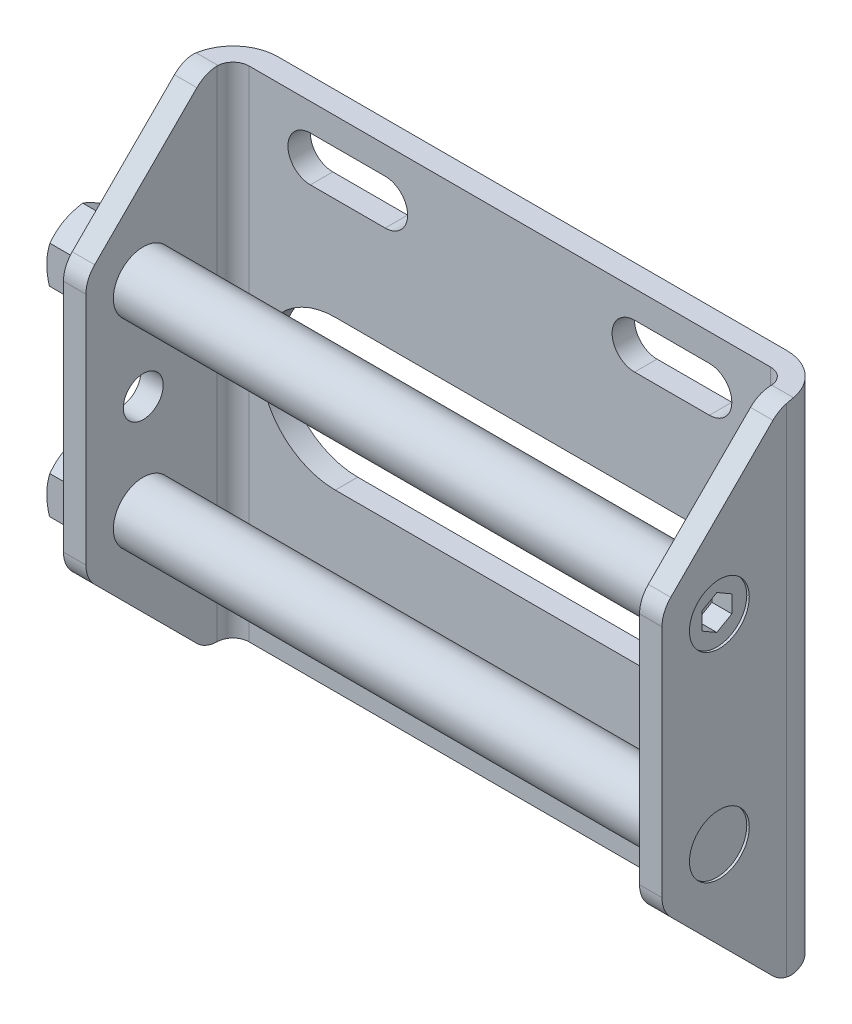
ISO-10303-21;
HEADER;
FILE_DESCRIPTION(('STEP AP214'),'2;1');
FILE_NAME('part.step','',(''),(''),'','','');
FILE_SCHEMA(('AUTOMOTIVE_DESIGN { 1 0 10303 214 1 1 1 1 }'));
ENDSEC;
DATA;
#1=APPLICATION_CONTEXT('core data for automotive mechanical design processes');
#2=APPLICATION_PROTOCOL_DEFINITION('international standard','automotive_design',2000,#1);
#3=PRODUCT_CONTEXT('',#1,'mechanical');
#4=PRODUCT('Part','Part','',(#3));
#5=PRODUCT_RELATED_PRODUCT_CATEGORY('part','',(#4));
#6=PRODUCT_DEFINITION_FORMATION('','',#4);
#7=PRODUCT_DEFINITION_CONTEXT('part definition',#1,'design');
#8=PRODUCT_DEFINITION('design','',#6,#7);
#9=PRODUCT_DEFINITION_SHAPE('','',#8);
#10=(LENGTH_UNIT() NAMED_UNIT(*) SI_UNIT(.MILLI.,.METRE.));
#11=(NAMED_UNIT(*) PLANE_ANGLE_UNIT() SI_UNIT($,.RADIAN.));
#12=(NAMED_UNIT(*) SI_UNIT($,.STERADIAN.) SOLID_ANGLE_UNIT());
#13=UNCERTAINTY_MEASURE_WITH_UNIT(LENGTH_MEASURE(1.E-05),#10,'distance_accuracy_value','');
#14=(GEOMETRIC_REPRESENTATION_CONTEXT(3) GLOBAL_UNCERTAINTY_ASSIGNED_CONTEXT((#13)) GLOBAL_UNIT_ASSIGNED_CONTEXT((#10,
#11,#12)) REPRESENTATION_CONTEXT('',''));
#15=CARTESIAN_POINT('',(0.,0.,0.));
#16=DIRECTION('',(0.,0.,1.));
#17=DIRECTION('',(1.,0.,0.));
#18=AXIS2_PLACEMENT_3D('',#15,#16,#17);
#19=CARTESIAN_POINT('',(-22.,60.,22.5));
#20=DIRECTION('',(-1.,0.,0.));
#21=DIRECTION('',(0.,0.,1.));
#22=AXIS2_PLACEMENT_3D('',#19,#20,#21);
#23=PLANE('',#22);
#24=CARTESIAN_POINT('',(-22.,60.,22.5));
#25=DIRECTION('',(-1.,0.,0.));
#26=DIRECTION('',(0.,0.,1.));
#27=AXIS2_PLACEMENT_3D('',#24,#25,#26);
#28=CIRCLE('',#27,7.7);
#29=CARTESIAN_POINT('',(-22.,60.,30.2));
#30=VERTEX_POINT('',#29);
#31=EDGE_CURVE('E438',#30,#30,#28,.T.);
#32=ORIENTED_EDGE('',*,*,#31,.T.);
#33=EDGE_LOOP('',(#32));
#34=FACE_BOUND('',#33,.T.);
#35=DIRECTION('',(0.,0.5,0.866025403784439));
#36=VECTOR('',#35,1.);
#37=CARTESIAN_POINT('',(-22.,52.4944465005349,22.5));
#38=LINE('',#37,#36);
#39=CARTESIAN_POINT('',(-22.,52.4944465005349,22.5));
#40=VERTEX_POINT('',#39);
#41=CARTESIAN_POINT('',(-22.,56.2472232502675,29.));
#42=VERTEX_POINT('',#41);
#43=EDGE_CURVE('E1266',#40,#42,#38,.T.);
#44=ORIENTED_EDGE('',*,*,#43,.F.);
#45=DIRECTION('',(0.,-0.5,0.866025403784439));
#46=VECTOR('',#45,1.);
#47=CARTESIAN_POINT('',(-22.,56.2472232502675,16.));
#48=LINE('',#47,#46);
#49=CARTESIAN_POINT('',(-22.,56.2472232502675,16.));
#50=VERTEX_POINT('',#49);
#51=EDGE_CURVE('E1277',#50,#40,#48,.T.);
#52=ORIENTED_EDGE('',*,*,#51,.F.);
#53=DIRECTION('',(0.,-1.,0.));
#54=VECTOR('',#53,1.);
#55=CARTESIAN_POINT('',(-22.,63.7527767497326,16.));
#56=LINE('',#55,#54);
#57=CARTESIAN_POINT('',(-22.,63.7527767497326,16.));
#58=VERTEX_POINT('',#57);
#59=EDGE_CURVE('E422',#58,#50,#56,.T.);
#60=ORIENTED_EDGE('',*,*,#59,.F.);
#61=DIRECTION('',(0.,-0.5,-0.866025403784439));
#62=VECTOR('',#61,1.);
#63=CARTESIAN_POINT('',(-22.,67.5055534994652,22.5));
#64=LINE('',#63,#62);
#65=CARTESIAN_POINT('',(-22.,67.5055534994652,22.5));
#66=VERTEX_POINT('',#65);
#67=EDGE_CURVE('E427',#66,#58,#64,.T.);
#68=ORIENTED_EDGE('',*,*,#67,.F.);
#69=DIRECTION('',(0.,0.5,-0.866025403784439));
#70=VECTOR('',#69,1.);
#71=CARTESIAN_POINT('',(-22.,63.7527767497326,29.));
#72=LINE('',#71,#70);
#73=CARTESIAN_POINT('',(-22.,63.7527767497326,29.));
#74=VERTEX_POINT('',#73);
#75=EDGE_CURVE('E1275',#74,#66,#72,.T.);
#76=ORIENTED_EDGE('',*,*,#75,.F.);
#77=DIRECTION('',(0.,1.,0.));
#78=VECTOR('',#77,1.);
#79=CARTESIAN_POINT('',(-22.,56.2472232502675,29.));
#80=LINE('',#79,#78);
#81=EDGE_CURVE('E1270',#42,#74,#80,.T.);
#82=ORIENTED_EDGE('',*,*,#81,.F.);
#83=EDGE_LOOP('',(#44,#52,#60,#68,#76,#82));
#84=FACE_BOUND('',#83,.T.);
#85=ADVANCED_FACE('F14',(#34,#84),#23,.T.);
#86=CARTESIAN_POINT('',(-20.,-4.,7.51471862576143));
#87=DIRECTION('',(-1.,0.,0.));
#88=DIRECTION('',(0.,0.,1.));
#89=AXIS2_PLACEMENT_3D('',#86,#87,#88);
#90=PLANE('',#89);
#91=CARTESIAN_POINT('',(-20.,84.,7.51471862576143));
#92=DIRECTION('',(1.,0.,0.));
#93=DIRECTION('',(0.,0.,-1.));
#94=AXIS2_PLACEMENT_3D('',#91,#92,#93);
#95=CIRCLE('',#94,6.);
#96=CARTESIAN_POINT('',(-20.,89.8132554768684,9.));
#97=VERTEX_POINT('',#96);
#98=CARTESIAN_POINT('',(-20.,88.2426406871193,11.7573593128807));
#99=VERTEX_POINT('',#98);
#100=EDGE_CURVE('E813',#97,#99,#95,.T.);
#101=ORIENTED_EDGE('',*,*,#100,.F.);
#102=DIRECTION('',(0.,1.,0.));
#103=VECTOR('',#102,1.);
#104=CARTESIAN_POINT('',(-20.,-4.,9.));
#105=LINE('',#104,#103);
#106=CARTESIAN_POINT('',(-20.,-9.8132554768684,9.));
#107=VERTEX_POINT('',#106);
#108=EDGE_CURVE('E713',#97,#107,#105,.F.);
#109=ORIENTED_EDGE('',*,*,#108,.T.);
#110=CARTESIAN_POINT('',(-20.,-4.,7.51471862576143));
#111=DIRECTION('',(-1.,0.,0.));
#112=DIRECTION('',(0.,0.,1.));
#113=AXIS2_PLACEMENT_3D('',#110,#111,#112);
#114=CIRCLE('',#113,6.);
#115=CARTESIAN_POINT('',(-20.,-8.24264068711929,11.7573593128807));
#116=VERTEX_POINT('',#115);
#117=EDGE_CURVE('E830',#107,#116,#114,.T.);
#118=ORIENTED_EDGE('',*,*,#117,.T.);
#119=DIRECTION('',(0.,0.707106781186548,0.707106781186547));
#120=VECTOR('',#119,1.);
#121=CARTESIAN_POINT('',(-20.,-8.24264068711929,11.7573593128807));
#122=LINE('',#121,#120);
#123=CARTESIAN_POINT('',(-20.,12.2426406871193,32.2426406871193));
#124=VERTEX_POINT('',#123);
#125=EDGE_CURVE('E827',#116,#124,#122,.T.);
#126=ORIENTED_EDGE('',*,*,#125,.T.);
#127=CARTESIAN_POINT('',(-20.,16.4852813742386,28.));
#128=DIRECTION('',(-1.,0.,0.));
#129=DIRECTION('',(0.,0.,1.));
#130=AXIS2_PLACEMENT_3D('',#127,#128,#129);
#131=CIRCLE('',#130,6.);
#132=CARTESIAN_POINT('',(-20.,16.4852813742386,34.));
#133=VERTEX_POINT('',#132);
#134=EDGE_CURVE('E824',#124,#133,#131,.T.);
#135=ORIENTED_EDGE('',*,*,#134,.T.);
#136=DIRECTION('',(0.,1.,0.));
#137=VECTOR('',#136,1.);
#138=CARTESIAN_POINT('',(-20.,16.4852813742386,34.));
#139=LINE('',#138,#137);
#140=CARTESIAN_POINT('',(-20.,63.5147186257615,34.));
#141=VERTEX_POINT('',#140);
#142=EDGE_CURVE('E821',#133,#141,#139,.T.);
#143=ORIENTED_EDGE('',*,*,#142,.T.);
#144=CARTESIAN_POINT('',(-20.,63.5147186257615,28.));
#145=DIRECTION('',(1.,0.,0.));
#146=DIRECTION('',(0.,0.,-1.));
#147=AXIS2_PLACEMENT_3D('',#144,#145,#146);
#148=CIRCLE('',#147,6.);
#149=CARTESIAN_POINT('',(-20.,67.7573593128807,32.2426406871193));
#150=VERTEX_POINT('',#149);
#151=EDGE_CURVE('E818',#150,#141,#148,.T.);
#152=ORIENTED_EDGE('',*,*,#151,.F.);
#153=DIRECTION('',(0.,-0.707106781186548,0.707106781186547));
#154=VECTOR('',#153,1.);
#155=CARTESIAN_POINT('',(-20.,88.2426406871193,11.7573593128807));
#156=LINE('',#155,#154);
#157=EDGE_CURVE('E815',#99,#150,#156,.T.);
#158=ORIENTED_EDGE('',*,*,#157,.F.);
#159=EDGE_LOOP('',(#101,#109,#118,#126,#135,#143,#152,#158));
#160=FACE_BOUND('',#159,.T.);
#161=CARTESIAN_POINT('',(-20.,20.,22.5));
#162=DIRECTION('',(-1.,0.,0.));
#163=DIRECTION('',(0.,0.,1.));
#164=AXIS2_PLACEMENT_3D('',#161,#162,#163);
#165=CIRCLE('',#164,7.7);
#166=CARTESIAN_POINT('',(-20.,20.,30.2));
#167=VERTEX_POINT('',#166);
#168=EDGE_CURVE('E974',#167,#167,#165,.T.);
#169=ORIENTED_EDGE('',*,*,#168,.F.);
#170=EDGE_LOOP('',(#169));
#171=FACE_BOUND('',#170,.T.);
#172=CARTESIAN_POINT('',(-20.,40.,22.5));
#173=DIRECTION('',(-1.,0.,0.));
#174=DIRECTION('',(0.,0.,1.));
#175=AXIS2_PLACEMENT_3D('',#172,#173,#174);
#176=CIRCLE('',#175,4.);
#177=CARTESIAN_POINT('',(-20.,40.,26.5));
#178=VERTEX_POINT('',#177);
#179=EDGE_CURVE('E1007',#178,#178,#176,.T.);
#180=ORIENTED_EDGE('',*,*,#179,.F.);
#181=EDGE_LOOP('',(#180));
#182=FACE_BOUND('',#181,.T.);
#183=CARTESIAN_POINT('',(-20.,60.,22.5));
#184=DIRECTION('',(-1.,0.,0.));
#185=DIRECTION('',(0.,0.,1.));
#186=AXIS2_PLACEMENT_3D('',#183,#184,#185);
#187=CIRCLE('',#186,7.7);
#188=CARTESIAN_POINT('',(-20.,60.,30.2));
#189=VERTEX_POINT('',#188);
#190=EDGE_CURVE('E437',#189,#189,#187,.T.);
#191=ORIENTED_EDGE('',*,*,#190,.F.);
#192=EDGE_LOOP('',(#191));
#193=FACE_BOUND('',#192,.T.);
#194=ADVANCED_FACE('F1146',(#160,#171,#182,#193),#90,.T.);
#195=CARTESIAN_POINT('',(-15.5,-20.,4.5));
#196=DIRECTION('',(-1.,0.,0.));
#197=DIRECTION('',(0.,0.,1.));
#198=AXIS2_PLACEMENT_3D('',#195,#196,#197);
#199=PLANE('',#198);
#200=CARTESIAN_POINT('',(-15.5,40.,22.5));
#201=DIRECTION('',(-1.,0.,0.));
#202=DIRECTION('',(0.,0.,1.));
#203=AXIS2_PLACEMENT_3D('',#200,#201,#202);
#204=CIRCLE('',#203,4.);
#205=CARTESIAN_POINT('',(-15.5,40.,26.5));
#206=VERTEX_POINT('',#205);
#207=EDGE_CURVE('E1104',#206,#206,#204,.T.);
#208=ORIENTED_EDGE('',*,*,#207,.T.);
#209=EDGE_LOOP('',(#208));
#210=FACE_BOUND('',#209,.T.);
#211=CARTESIAN_POINT('',(-15.5,-4.,7.51471862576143));
#212=DIRECTION('',(-1.,0.,0.));
#213=DIRECTION('',(0.,0.,1.));
#214=AXIS2_PLACEMENT_3D('',#211,#212,#213);
#215=CIRCLE('',#214,6.);
#216=CARTESIAN_POINT('',(-15.5,-9.9971385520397,7.7));
#217=VERTEX_POINT('',#216);
#218=CARTESIAN_POINT('',(-15.5,-8.24264068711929,11.7573593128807));
#219=VERTEX_POINT('',#218);
#220=EDGE_CURVE('E777',#217,#219,#215,.T.);
#221=ORIENTED_EDGE('',*,*,#220,.F.);
#222=DIRECTION('',(0.,1.,0.));
#223=VECTOR('',#222,1.);
#224=CARTESIAN_POINT('',(-15.5,-20.,7.7));
#225=LINE('',#224,#223);
#226=CARTESIAN_POINT('',(-15.5,89.9971385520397,7.7));
#227=VERTEX_POINT('',#226);
#228=EDGE_CURVE('E702',#217,#227,#225,.T.);
#229=ORIENTED_EDGE('',*,*,#228,.T.);
#230=CARTESIAN_POINT('',(-15.5,84.,7.51471862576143));
#231=DIRECTION('',(-1.,0.,0.));
#232=DIRECTION('',(0.,0.,1.));
#233=AXIS2_PLACEMENT_3D('',#230,#231,#232);
#234=CIRCLE('',#233,6.);
#235=CARTESIAN_POINT('',(-15.5,88.2426406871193,11.7573593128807));
#236=VERTEX_POINT('',#235);
#237=EDGE_CURVE('E861',#227,#236,#234,.F.);
#238=ORIENTED_EDGE('',*,*,#237,.T.);
#239=DIRECTION('',(0.,-0.707106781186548,0.707106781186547));
#240=VECTOR('',#239,1.);
#241=CARTESIAN_POINT('',(-15.5,88.2426406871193,11.7573593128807));
#242=LINE('',#241,#240);
#243=CARTESIAN_POINT('',(-15.5,67.7573593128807,32.2426406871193));
#244=VERTEX_POINT('',#243);
#245=EDGE_CURVE('E859',#236,#244,#242,.T.);
#246=ORIENTED_EDGE('',*,*,#245,.T.);
#247=CARTESIAN_POINT('',(-15.5,63.5147186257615,28.));
#248=DIRECTION('',(-1.,0.,0.));
#249=DIRECTION('',(0.,0.,1.));
#250=AXIS2_PLACEMENT_3D('',#247,#248,#249);
#251=CIRCLE('',#250,6.);
#252=CARTESIAN_POINT('',(-15.5,63.5147186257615,34.));
#253=VERTEX_POINT('',#252);
#254=EDGE_CURVE('E857',#244,#253,#251,.F.);
#255=ORIENTED_EDGE('',*,*,#254,.T.);
#256=DIRECTION('',(0.,1.,0.));
#257=VECTOR('',#256,1.);
#258=CARTESIAN_POINT('',(-15.5,16.4852813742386,34.));
#259=LINE('',#258,#257);
#260=CARTESIAN_POINT('',(-15.5,16.4852813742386,34.));
#261=VERTEX_POINT('',#260);
#262=EDGE_CURVE('E854',#261,#253,#259,.T.);
#263=ORIENTED_EDGE('',*,*,#262,.F.);
#264=CARTESIAN_POINT('',(-15.5,16.4852813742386,28.));
#265=DIRECTION('',(-1.,0.,0.));
#266=DIRECTION('',(0.,0.,1.));
#267=AXIS2_PLACEMENT_3D('',#264,#265,#266);
#268=CIRCLE('',#267,6.);
#269=CARTESIAN_POINT('',(-15.5,12.2426406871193,32.2426406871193));
#270=VERTEX_POINT('',#269);
#271=EDGE_CURVE('E851',#270,#261,#268,.T.);
#272=ORIENTED_EDGE('',*,*,#271,.F.);
#273=DIRECTION('',(0.,0.707106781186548,0.707106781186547));
#274=VECTOR('',#273,1.);
#275=CARTESIAN_POINT('',(-15.5,-8.24264068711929,11.7573593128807));
#276=LINE('',#275,#274);
#277=EDGE_CURVE('E848',#219,#270,#276,.T.);
#278=ORIENTED_EDGE('',*,*,#277,.F.);
#279=EDGE_LOOP('',(#221,#229,#238,#246,#255,#263,#272,#278));
#280=FACE_BOUND('',#279,.T.);
#281=CARTESIAN_POINT('',(-15.5,60.,22.5));
#282=DIRECTION('',(-1.,0.,0.));
#283=DIRECTION('',(0.,0.,1.));
#284=AXIS2_PLACEMENT_3D('',#281,#282,#283);
#285=CIRCLE('',#284,6.);
#286=CARTESIAN_POINT('',(-15.5,60.,28.5));
#287=VERTEX_POINT('',#286);
#288=EDGE_CURVE('E962',#287,#287,#285,.T.);
#289=ORIENTED_EDGE('',*,*,#288,.T.);
#290=EDGE_LOOP('',(#289));
#291=FACE_BOUND('',#290,.T.);
#292=CARTESIAN_POINT('',(-15.5,20.,22.5));
#293=DIRECTION('',(-1.,0.,0.));
#294=DIRECTION('',(0.,0.,1.));
#295=AXIS2_PLACEMENT_3D('',#292,#293,#294);
#296=CIRCLE('',#295,6.);
#297=CARTESIAN_POINT('',(-15.5,20.,28.5));
#298=VERTEX_POINT('',#297);
#299=EDGE_CURVE('E966',#298,#298,#296,.F.);
#300=ORIENTED_EDGE('',*,*,#299,.F.);
#301=EDGE_LOOP('',(#300));
#302=FACE_BOUND('',#301,.T.);
#303=ADVANCED_FACE('F737',(#210,#280,#291,#302),#199,.F.);
#304=CARTESIAN_POINT('',(95.5,-20.,4.5));
#305=DIRECTION('',(-1.,0.,0.));
#306=DIRECTION('',(0.,0.,1.));
#307=AXIS2_PLACEMENT_3D('',#304,#305,#306);
#308=PLANE('',#307);
#309=CARTESIAN_POINT('',(95.5,84.,7.51471862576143));
#310=DIRECTION('',(-1.,0.,0.));
#311=DIRECTION('',(0.,0.,1.));
#312=AXIS2_PLACEMENT_3D('',#309,#310,#311);
#313=CIRCLE('',#312,6.);
#314=CARTESIAN_POINT('',(95.5,89.9971385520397,7.7));
#315=VERTEX_POINT('',#314);
#316=CARTESIAN_POINT('',(95.5,88.2426406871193,11.7573593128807));
#317=VERTEX_POINT('',#316);
#318=EDGE_CURVE('E878',#315,#317,#313,.F.);
#319=ORIENTED_EDGE('',*,*,#318,.F.);
#320=DIRECTION('',(0.,1.,0.));
#321=VECTOR('',#320,1.);
#322=CARTESIAN_POINT('',(95.5,-20.,7.7));
#323=LINE('',#322,#321);
#324=CARTESIAN_POINT('',(95.5,-9.9971385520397,7.7));
#325=VERTEX_POINT('',#324);
#326=EDGE_CURVE('E705',#315,#325,#323,.F.);
#327=ORIENTED_EDGE('',*,*,#326,.T.);
#328=CARTESIAN_POINT('',(95.5,-4.,7.51471862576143));
#329=DIRECTION('',(-1.,0.,0.));
#330=DIRECTION('',(0.,0.,1.));
#331=AXIS2_PLACEMENT_3D('',#328,#329,#330);
#332=CIRCLE('',#331,6.);
#333=CARTESIAN_POINT('',(95.5,-8.24264068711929,11.7573593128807));
#334=VERTEX_POINT('',#333);
#335=EDGE_CURVE('E864',#325,#334,#332,.T.);
#336=ORIENTED_EDGE('',*,*,#335,.T.);
#337=DIRECTION('',(0.,0.707106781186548,0.707106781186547));
#338=VECTOR('',#337,1.);
#339=CARTESIAN_POINT('',(95.5,-8.24264068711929,11.7573593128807));
#340=LINE('',#339,#338);
#341=CARTESIAN_POINT('',(95.5,12.2426406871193,32.2426406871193));
#342=VERTEX_POINT('',#341);
#343=EDGE_CURVE('E866',#334,#342,#340,.T.);
#344=ORIENTED_EDGE('',*,*,#343,.T.);
#345=CARTESIAN_POINT('',(95.5,16.4852813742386,28.));
#346=DIRECTION('',(-1.,0.,0.));
#347=DIRECTION('',(0.,0.,1.));
#348=AXIS2_PLACEMENT_3D('',#345,#346,#347);
#349=CIRCLE('',#348,6.);
#350=CARTESIAN_POINT('',(95.5,16.4852813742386,34.));
#351=VERTEX_POINT('',#350);
#352=EDGE_CURVE('E868',#342,#351,#349,.T.);
#353=ORIENTED_EDGE('',*,*,#352,.T.);
#354=DIRECTION('',(0.,1.,0.));
#355=VECTOR('',#354,1.);
#356=CARTESIAN_POINT('',(95.5,16.4852813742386,34.));
#357=LINE('',#356,#355);
#358=CARTESIAN_POINT('',(95.5,63.5147186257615,34.));
#359=VERTEX_POINT('',#358);
#360=EDGE_CURVE('E870',#351,#359,#357,.T.);
#361=ORIENTED_EDGE('',*,*,#360,.T.);
#362=CARTESIAN_POINT('',(95.5,63.5147186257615,28.));
#363=DIRECTION('',(-1.,0.,0.));
#364=DIRECTION('',(0.,0.,1.));
#365=AXIS2_PLACEMENT_3D('',#362,#363,#364);
#366=CIRCLE('',#365,6.);
#367=CARTESIAN_POINT('',(95.5,67.7573593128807,32.2426406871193));
#368=VERTEX_POINT('',#367);
#369=EDGE_CURVE('E872',#368,#359,#366,.F.);
#370=ORIENTED_EDGE('',*,*,#369,.F.);
#371=DIRECTION('',(0.,-0.707106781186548,0.707106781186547));
#372=VECTOR('',#371,1.);
#373=CARTESIAN_POINT('',(95.5,88.2426406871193,11.7573593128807));
#374=LINE('',#373,#372);
#375=EDGE_CURVE('E875',#317,#368,#374,.T.);
#376=ORIENTED_EDGE('',*,*,#375,.F.);
#377=EDGE_LOOP('',(#319,#327,#336,#344,#353,#361,#370,#376));
#378=FACE_BOUND('',#377,.T.);
#379=CARTESIAN_POINT('',(95.5,60.,22.5));
#380=DIRECTION('',(-1.,0.,0.));
#381=DIRECTION('',(0.,0.,1.));
#382=AXIS2_PLACEMENT_3D('',#379,#380,#381);
#383=CIRCLE('',#382,6.);
#384=CARTESIAN_POINT('',(95.5,60.,28.5));
#385=VERTEX_POINT('',#384);
#386=EDGE_CURVE('E970',#385,#385,#383,.T.);
#387=ORIENTED_EDGE('',*,*,#386,.F.);
#388=EDGE_LOOP('',(#387));
#389=FACE_BOUND('',#388,.T.);
#390=CARTESIAN_POINT('',(95.5,20.,22.5));
#391=DIRECTION('',(-1.,0.,0.));
#392=DIRECTION('',(0.,0.,1.));
#393=AXIS2_PLACEMENT_3D('',#390,#391,#392);
#394=CIRCLE('',#393,6.);
#395=CARTESIAN_POINT('',(95.5,20.,28.5));
#396=VERTEX_POINT('',#395);
#397=EDGE_CURVE('E965',#396,#396,#394,.F.);
#398=ORIENTED_EDGE('',*,*,#397,.T.);
#399=EDGE_LOOP('',(#398));
#400=FACE_BOUND('',#399,.T.);
#401=ADVANCED_FACE('F1760',(#378,#389,#400),#308,.T.);
#402=CARTESIAN_POINT('',(-20.,-10.,0.));
#403=DIRECTION('',(0.,0.,-1.));
#404=DIRECTION('',(0.,-1.,0.));
#405=AXIS2_PLACEMENT_3D('',#402,#403,#404);
#406=PLANE('',#405);
#407=CARTESIAN_POINT('',(5.,40.,0.));
#408=DIRECTION('',(0.,0.,-1.));
#409=DIRECTION('',(0.,-1.,0.));
#410=AXIS2_PLACEMENT_3D('',#407,#408,#409);
#411=CIRCLE('',#410,15.);
#412=CARTESIAN_POINT('',(5.,25.,0.));
#413=VERTEX_POINT('',#412);
#414=CARTESIAN_POINT('',(5.2704188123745,54.9975622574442,0.));
#415=VERTEX_POINT('',#414);
#416=EDGE_CURVE('E1043',#413,#415,#411,.T.);
#417=ORIENTED_EDGE('',*,*,#416,.F.);
#418=DIRECTION('',(-1.,0.,0.));
#419=VECTOR('',#418,1.);
#420=CARTESIAN_POINT('',(5.,25.,0.));
#421=LINE('',#420,#419);
#422=CARTESIAN_POINT('',(75.,25.,0.));
#423=VERTEX_POINT('',#422);
#424=EDGE_CURVE('E1034',#423,#413,#421,.T.);
#425=ORIENTED_EDGE('',*,*,#424,.F.);
#426=CARTESIAN_POINT('',(75.,40.,0.));
#427=DIRECTION('',(0.,0.,-1.));
#428=DIRECTION('',(0.,-1.,0.));
#429=AXIS2_PLACEMENT_3D('',#426,#427,#428);
#430=CIRCLE('',#429,15.);
#431=CARTESIAN_POINT('',(74.7295811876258,54.9975622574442,0.));
#432=VERTEX_POINT('',#431);
#433=EDGE_CURVE('E1037',#432,#423,#430,.T.);
#434=ORIENTED_EDGE('',*,*,#433,.F.);
#435=DIRECTION('',(1.,0.,0.));
#436=VECTOR('',#435,1.);
#437=CARTESIAN_POINT('',(74.7295811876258,54.9975622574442,0.));
#438=LINE('',#437,#436);
#439=EDGE_CURVE('E1040',#415,#432,#438,.T.);
#440=ORIENTED_EDGE('',*,*,#439,.F.);
#441=EDGE_LOOP('',(#417,#425,#434,#440));
#442=FACE_BOUND('',#441,.T.);
#443=DIRECTION('',(1.,0.,0.));
#444=VECTOR('',#443,1.);
#445=CARTESIAN_POINT('',(65.,84.5,0.));
#446=LINE('',#445,#444);
#447=CARTESIAN_POINT('',(65.,84.5,0.));
#448=VERTEX_POINT('',#447);
#449=CARTESIAN_POINT('',(80.,84.5,0.));
#450=VERTEX_POINT('',#449);
#451=EDGE_CURVE('E909',#448,#450,#446,.T.);
#452=ORIENTED_EDGE('',*,*,#451,.F.);
#453=CARTESIAN_POINT('',(65.,80.,0.));
#454=DIRECTION('',(0.,0.,1.));
#455=DIRECTION('',(0.,1.,0.));
#456=AXIS2_PLACEMENT_3D('',#453,#454,#455);
#457=CIRCLE('',#456,4.5);
#458=CARTESIAN_POINT('',(65.,75.5,0.));
#459=VERTEX_POINT('',#458);
#460=EDGE_CURVE('E918',#448,#459,#457,.T.);
#461=ORIENTED_EDGE('',*,*,#460,.T.);
#462=DIRECTION('',(1.,0.,0.));
#463=VECTOR('',#462,1.);
#464=CARTESIAN_POINT('',(65.,75.5,0.));
#465=LINE('',#464,#463);
#466=CARTESIAN_POINT('',(80.,75.5,0.));
#467=VERTEX_POINT('',#466);
#468=EDGE_CURVE('E915',#459,#467,#465,.T.);
#469=ORIENTED_EDGE('',*,*,#468,.T.);
#470=CARTESIAN_POINT('',(80.,80.,0.));
#471=DIRECTION('',(0.,0.,1.));
#472=DIRECTION('',(0.,1.,0.));
#473=AXIS2_PLACEMENT_3D('',#470,#471,#472);
#474=CIRCLE('',#473,4.5);
#475=EDGE_CURVE('E912',#467,#450,#474,.T.);
#476=ORIENTED_EDGE('',*,*,#475,.T.);
#477=EDGE_LOOP('',(#452,#461,#469,#476));
#478=FACE_BOUND('',#477,.T.);
#479=CARTESIAN_POINT('',(65.,0.,0.));
#480=DIRECTION('',(0.,0.,-1.));
#481=DIRECTION('',(0.,-1.,0.));
#482=AXIS2_PLACEMENT_3D('',#479,#480,#481);
#483=CIRCLE('',#482,4.5);
#484=CARTESIAN_POINT('',(65.,-4.5,0.));
#485=VERTEX_POINT('',#484);
#486=CARTESIAN_POINT('',(65.,4.5,0.));
#487=VERTEX_POINT('',#486);
#488=EDGE_CURVE('E898',#485,#487,#483,.T.);
#489=ORIENTED_EDGE('',*,*,#488,.F.);
#490=DIRECTION('',(1.,0.,0.));
#491=VECTOR('',#490,1.);
#492=CARTESIAN_POINT('',(65.,-4.5,0.));
#493=LINE('',#492,#491);
#494=CARTESIAN_POINT('',(80.,-4.5,0.));
#495=VERTEX_POINT('',#494);
#496=EDGE_CURVE('E889',#485,#495,#493,.T.);
#497=ORIENTED_EDGE('',*,*,#496,.T.);
#498=CARTESIAN_POINT('',(80.,0.,0.));
#499=DIRECTION('',(0.,0.,-1.));
#500=DIRECTION('',(0.,-1.,0.));
#501=AXIS2_PLACEMENT_3D('',#498,#499,#500);
#502=CIRCLE('',#501,4.5);
#503=CARTESIAN_POINT('',(80.,4.5,0.));
#504=VERTEX_POINT('',#503);
#505=EDGE_CURVE('E892',#504,#495,#502,.T.);
#506=ORIENTED_EDGE('',*,*,#505,.F.);
#507=DIRECTION('',(1.,0.,0.));
#508=VECTOR('',#507,1.);
#509=CARTESIAN_POINT('',(65.,4.5,0.));
#510=LINE('',#509,#508);
#511=EDGE_CURVE('E895',#487,#504,#510,.T.);
#512=ORIENTED_EDGE('',*,*,#511,.F.);
#513=EDGE_LOOP('',(#489,#497,#506,#512));
#514=FACE_BOUND('',#513,.T.);
#515=DIRECTION('',(1.,0.,0.));
#516=VECTOR('',#515,1.);
#517=CARTESIAN_POINT('',(-20.,90.,0.));
#518=LINE('',#517,#516);
#519=CARTESIAN_POINT('',(-11.,90.,0.));
#520=VERTEX_POINT('',#519);
#521=CARTESIAN_POINT('',(91.,90.,0.));
#522=VERTEX_POINT('',#521);
#523=EDGE_CURVE('E808',#520,#522,#518,.T.);
#524=ORIENTED_EDGE('',*,*,#523,.T.);
#525=DIRECTION('',(0.,1.,0.));
#526=VECTOR('',#525,1.);
#527=CARTESIAN_POINT('',(91.,-4.,0.));
#528=LINE('',#527,#526);
#529=CARTESIAN_POINT('',(91.,-10.,0.));
#530=VERTEX_POINT('',#529);
#531=EDGE_CURVE('E757',#522,#530,#528,.F.);
#532=ORIENTED_EDGE('',*,*,#531,.T.);
#533=DIRECTION('',(1.,0.,0.));
#534=VECTOR('',#533,1.);
#535=CARTESIAN_POINT('',(-20.,-10.,0.));
#536=LINE('',#535,#534);
#537=CARTESIAN_POINT('',(-11.,-10.,0.));
#538=VERTEX_POINT('',#537);
#539=EDGE_CURVE('E811',#538,#530,#536,.T.);
#540=ORIENTED_EDGE('',*,*,#539,.F.);
#541=DIRECTION('',(0.,1.,0.));
#542=VECTOR('',#541,1.);
#543=CARTESIAN_POINT('',(-11.,-10.,0.));
#544=LINE('',#543,#542);
#545=EDGE_CURVE('E754',#538,#520,#544,.T.);
#546=ORIENTED_EDGE('',*,*,#545,.T.);
#547=EDGE_LOOP('',(#524,#532,#540,#546));
#548=FACE_BOUND('',#547,.T.);
#549=CARTESIAN_POINT('',(0.,80.,0.));
#550=DIRECTION('',(0.,0.,-1.));
#551=DIRECTION('',(0.,-1.,0.));
#552=AXIS2_PLACEMENT_3D('',#549,#550,#551);
#553=CIRCLE('',#552,4.5);
#554=CARTESIAN_POINT('',(0.,75.5,0.));
#555=VERTEX_POINT('',#554);
#556=CARTESIAN_POINT('',(0.,84.5,0.));
#557=VERTEX_POINT('',#556);
#558=EDGE_CURVE('E939',#555,#557,#553,.T.);
#559=ORIENTED_EDGE('',*,*,#558,.F.);
#560=DIRECTION('',(-1.,0.,0.));
#561=VECTOR('',#560,1.);
#562=CARTESIAN_POINT('',(15.,75.5,0.));
#563=LINE('',#562,#561);
#564=CARTESIAN_POINT('',(15.,75.5,0.));
#565=VERTEX_POINT('',#564);
#566=EDGE_CURVE('E930',#565,#555,#563,.T.);
#567=ORIENTED_EDGE('',*,*,#566,.F.);
#568=CARTESIAN_POINT('',(15.,80.,0.));
#569=DIRECTION('',(0.,0.,-1.));
#570=DIRECTION('',(0.,-1.,0.));
#571=AXIS2_PLACEMENT_3D('',#568,#569,#570);
#572=CIRCLE('',#571,4.5);
#573=CARTESIAN_POINT('',(15.,84.5,0.));
#574=VERTEX_POINT('',#573);
#575=EDGE_CURVE('E933',#574,#565,#572,.T.);
#576=ORIENTED_EDGE('',*,*,#575,.F.);
#577=DIRECTION('',(-1.,0.,0.));
#578=VECTOR('',#577,1.);
#579=CARTESIAN_POINT('',(15.,84.5,0.));
#580=LINE('',#579,#578);
#581=EDGE_CURVE('E936',#574,#557,#580,.T.);
#582=ORIENTED_EDGE('',*,*,#581,.T.);
#583=EDGE_LOOP('',(#559,#567,#576,#582));
#584=FACE_BOUND('',#583,.T.);
#585=DIRECTION('',(-1.,0.,0.));
#586=VECTOR('',#585,1.);
#587=CARTESIAN_POINT('',(15.,-4.5,0.));
#588=LINE('',#587,#586);
#589=CARTESIAN_POINT('',(15.,-4.5,0.));
#590=VERTEX_POINT('',#589);
#591=CARTESIAN_POINT('',(0.,-4.5,0.));
#592=VERTEX_POINT('',#591);
#593=EDGE_CURVE('E950',#590,#592,#588,.T.);
#594=ORIENTED_EDGE('',*,*,#593,.F.);
#595=CARTESIAN_POINT('',(15.,0.,0.));
#596=DIRECTION('',(0.,0.,1.));
#597=DIRECTION('',(0.,1.,0.));
#598=AXIS2_PLACEMENT_3D('',#595,#596,#597);
#599=CIRCLE('',#598,4.5);
#600=CARTESIAN_POINT('',(15.,4.5,0.));
#601=VERTEX_POINT('',#600);
#602=EDGE_CURVE('E959',#590,#601,#599,.T.);
#603=ORIENTED_EDGE('',*,*,#602,.T.);
#604=DIRECTION('',(-1.,0.,0.));
#605=VECTOR('',#604,1.);
#606=CARTESIAN_POINT('',(15.,4.5,0.));
#607=LINE('',#606,#605);
#608=CARTESIAN_POINT('',(0.,4.5,0.));
#609=VERTEX_POINT('',#608);
#610=EDGE_CURVE('E956',#601,#609,#607,.T.);
#611=ORIENTED_EDGE('',*,*,#610,.T.);
#612=CARTESIAN_POINT('',(0.,0.,0.));
#613=DIRECTION('',(0.,0.,1.));
#614=DIRECTION('',(0.,1.,0.));
#615=AXIS2_PLACEMENT_3D('',#612,#613,#614);
#616=CIRCLE('',#615,4.5);
#617=EDGE_CURVE('E953',#609,#592,#616,.T.);
#618=ORIENTED_EDGE('',*,*,#617,.T.);
#619=EDGE_LOOP('',(#594,#603,#611,#618));
#620=FACE_BOUND('',#619,.T.);
#621=ADVANCED_FACE('F1758',(#442,#478,#514,#548,#584,#620),#406,.T.);
#622=CARTESIAN_POINT('',(-15.5,-20.,4.5));
#623=DIRECTION('',(0.,0.,1.));
#624=DIRECTION('',(0.,1.,0.));
#625=AXIS2_PLACEMENT_3D('',#622,#623,#624);
#626=PLANE('',#625);
#627=CARTESIAN_POINT('',(5.,40.,4.5));
#628=DIRECTION('',(0.,0.,-1.));
#629=DIRECTION('',(0.,-1.,0.));
#630=AXIS2_PLACEMENT_3D('',#627,#628,#629);
#631=CIRCLE('',#630,15.);
#632=CARTESIAN_POINT('',(5.,25.,4.5));
#633=VERTEX_POINT('',#632);
#634=CARTESIAN_POINT('',(5.2704188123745,54.9975622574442,4.5));
#635=VERTEX_POINT('',#634);
#636=EDGE_CURVE('E1031',#633,#635,#631,.T.);
#637=ORIENTED_EDGE('',*,*,#636,.T.);
#638=DIRECTION('',(1.,0.,0.));
#639=VECTOR('',#638,1.);
#640=CARTESIAN_POINT('',(74.7295811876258,54.9975622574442,4.5));
#641=LINE('',#640,#639);
#642=CARTESIAN_POINT('',(74.7295811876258,54.9975622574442,4.5));
#643=VERTEX_POINT('',#642);
#644=EDGE_CURVE('E1028',#635,#643,#641,.T.);
#645=ORIENTED_EDGE('',*,*,#644,.T.);
#646=CARTESIAN_POINT('',(75.,40.,4.5));
#647=DIRECTION('',(0.,0.,-1.));
#648=DIRECTION('',(0.,-1.,0.));
#649=AXIS2_PLACEMENT_3D('',#646,#647,#648);
#650=CIRCLE('',#649,15.);
#651=CARTESIAN_POINT('',(75.,25.,4.5));
#652=VERTEX_POINT('',#651);
#653=EDGE_CURVE('E1025',#643,#652,#650,.T.);
#654=ORIENTED_EDGE('',*,*,#653,.T.);
#655=DIRECTION('',(-1.,0.,0.));
#656=VECTOR('',#655,1.);
#657=CARTESIAN_POINT('',(5.,25.,4.5));
#658=LINE('',#657,#656);
#659=EDGE_CURVE('E1018',#652,#633,#658,.T.);
#660=ORIENTED_EDGE('',*,*,#659,.T.);
#661=EDGE_LOOP('',(#637,#645,#654,#660));
#662=FACE_BOUND('',#661,.T.);
#663=DIRECTION('',(-1.,0.,0.));
#664=VECTOR('',#663,1.);
#665=CARTESIAN_POINT('',(-15.5,75.5,4.5));
#666=LINE('',#665,#664);
#667=CARTESIAN_POINT('',(80.,75.5,4.5));
#668=VERTEX_POINT('',#667);
#669=CARTESIAN_POINT('',(65.,75.5,4.5));
#670=VERTEX_POINT('',#669);
#671=EDGE_CURVE('E1817',#668,#670,#666,.T.);
#672=ORIENTED_EDGE('',*,*,#671,.T.);
#673=CARTESIAN_POINT('',(65.,80.,4.5));
#674=DIRECTION('',(0.,0.,1.));
#675=DIRECTION('',(0.,1.,0.));
#676=AXIS2_PLACEMENT_3D('',#673,#674,#675);
#677=CIRCLE('',#676,4.5);
#678=CARTESIAN_POINT('',(65.,84.5,4.5));
#679=VERTEX_POINT('',#678);
#680=EDGE_CURVE('E1814',#670,#679,#677,.F.);
#681=ORIENTED_EDGE('',*,*,#680,.T.);
#682=DIRECTION('',(-1.,0.,0.));
#683=VECTOR('',#682,1.);
#684=CARTESIAN_POINT('',(-15.5,84.5,4.5));
#685=LINE('',#684,#683);
#686=CARTESIAN_POINT('',(80.,84.5,4.5));
#687=VERTEX_POINT('',#686);
#688=EDGE_CURVE('E1823',#687,#679,#685,.T.);
#689=ORIENTED_EDGE('',*,*,#688,.F.);
#690=CARTESIAN_POINT('',(80.,80.,4.5));
#691=DIRECTION('',(0.,0.,1.));
#692=DIRECTION('',(0.,1.,0.));
#693=AXIS2_PLACEMENT_3D('',#690,#691,#692);
#694=CIRCLE('',#693,4.5);
#695=EDGE_CURVE('E1820',#687,#668,#694,.F.);
#696=ORIENTED_EDGE('',*,*,#695,.T.);
#697=EDGE_LOOP('',(#672,#681,#689,#696));
#698=FACE_BOUND('',#697,.T.);
#699=CARTESIAN_POINT('',(65.,0.,4.5));
#700=DIRECTION('',(0.,0.,1.));
#701=DIRECTION('',(0.,1.,0.));
#702=AXIS2_PLACEMENT_3D('',#699,#700,#701);
#703=CIRCLE('',#702,4.5);
#704=CARTESIAN_POINT('',(65.,4.5,4.5));
#705=VERTEX_POINT('',#704);
#706=CARTESIAN_POINT('',(65.,-4.5,4.5));
#707=VERTEX_POINT('',#706);
#708=EDGE_CURVE('E1825',#705,#707,#703,.T.);
#709=ORIENTED_EDGE('',*,*,#708,.F.);
#710=DIRECTION('',(-1.,0.,0.));
#711=VECTOR('',#710,1.);
#712=CARTESIAN_POINT('',(-15.5,4.5,4.5));
#713=LINE('',#712,#711);
#714=CARTESIAN_POINT('',(80.,4.5,4.5));
#715=VERTEX_POINT('',#714);
#716=EDGE_CURVE('E624',#715,#705,#713,.T.);
#717=ORIENTED_EDGE('',*,*,#716,.F.);
#718=CARTESIAN_POINT('',(80.,0.,4.5));
#719=DIRECTION('',(0.,0.,1.));
#720=DIRECTION('',(0.,1.,0.));
#721=AXIS2_PLACEMENT_3D('',#718,#719,#720);
#722=CIRCLE('',#721,4.5);
#723=CARTESIAN_POINT('',(80.,-4.5,4.5));
#724=VERTEX_POINT('',#723);
#725=EDGE_CURVE('E1829',#724,#715,#722,.T.);
#726=ORIENTED_EDGE('',*,*,#725,.F.);
#727=DIRECTION('',(-1.,0.,0.));
#728=VECTOR('',#727,1.);
#729=CARTESIAN_POINT('',(-15.5,-4.5,4.5));
#730=LINE('',#729,#728);
#731=EDGE_CURVE('E1827',#724,#707,#730,.T.);
#732=ORIENTED_EDGE('',*,*,#731,.T.);
#733=EDGE_LOOP('',(#709,#717,#726,#732));
#734=FACE_BOUND('',#733,.T.);
#735=DIRECTION('',(1.,0.,0.));
#736=VECTOR('',#735,1.);
#737=CARTESIAN_POINT('',(-20.,-10.,4.5));
#738=LINE('',#737,#736);
#739=CARTESIAN_POINT('',(-12.3,-10.,4.5));
#740=VERTEX_POINT('',#739);
#741=CARTESIAN_POINT('',(92.3,-10.,4.5));
#742=VERTEX_POINT('',#741);
#743=EDGE_CURVE('E691',#740,#742,#738,.T.);
#744=ORIENTED_EDGE('',*,*,#743,.T.);
#745=DIRECTION('',(0.,1.,0.));
#746=VECTOR('',#745,1.);
#747=CARTESIAN_POINT('',(92.3,-20.,4.5));
#748=LINE('',#747,#746);
#749=CARTESIAN_POINT('',(92.3,90.,4.5));
#750=VERTEX_POINT('',#749);
#751=EDGE_CURVE('E707',#742,#750,#748,.T.);
#752=ORIENTED_EDGE('',*,*,#751,.T.);
#753=DIRECTION('',(1.,0.,0.));
#754=VECTOR('',#753,1.);
#755=CARTESIAN_POINT('',(-20.,90.,4.5));
#756=LINE('',#755,#754);
#757=CARTESIAN_POINT('',(-12.3,90.,4.5));
#758=VERTEX_POINT('',#757);
#759=EDGE_CURVE('E697',#758,#750,#756,.T.);
#760=ORIENTED_EDGE('',*,*,#759,.F.);
#761=DIRECTION('',(0.,1.,0.));
#762=VECTOR('',#761,1.);
#763=CARTESIAN_POINT('',(-12.3,-20.,4.5));
#764=LINE('',#763,#762);
#765=EDGE_CURVE('E711',#758,#740,#764,.F.);
#766=ORIENTED_EDGE('',*,*,#765,.T.);
#767=EDGE_LOOP('',(#744,#752,#760,#766));
#768=FACE_BOUND('',#767,.T.);
#769=CARTESIAN_POINT('',(0.,80.,4.5));
#770=DIRECTION('',(0.,0.,1.));
#771=DIRECTION('',(0.,1.,0.));
#772=AXIS2_PLACEMENT_3D('',#769,#770,#771);
#773=CIRCLE('',#772,4.5);
#774=CARTESIAN_POINT('',(0.,84.5,4.5));
#775=VERTEX_POINT('',#774);
#776=CARTESIAN_POINT('',(0.,75.5,4.5));
#777=VERTEX_POINT('',#776);
#778=EDGE_CURVE('E1804',#775,#777,#773,.T.);
#779=ORIENTED_EDGE('',*,*,#778,.F.);
#780=DIRECTION('',(1.,0.,0.));
#781=VECTOR('',#780,1.);
#782=CARTESIAN_POINT('',(-15.5,84.5,4.5));
#783=LINE('',#782,#781);
#784=CARTESIAN_POINT('',(15.,84.5,4.5));
#785=VERTEX_POINT('',#784);
#786=EDGE_CURVE('E1811',#775,#785,#783,.T.);
#787=ORIENTED_EDGE('',*,*,#786,.T.);
#788=CARTESIAN_POINT('',(15.,80.,4.5));
#789=DIRECTION('',(0.,0.,1.));
#790=DIRECTION('',(0.,1.,0.));
#791=AXIS2_PLACEMENT_3D('',#788,#789,#790);
#792=CIRCLE('',#791,4.5);
#793=CARTESIAN_POINT('',(15.,75.5,4.5));
#794=VERTEX_POINT('',#793);
#795=EDGE_CURVE('E1808',#794,#785,#792,.T.);
#796=ORIENTED_EDGE('',*,*,#795,.F.);
#797=DIRECTION('',(1.,0.,0.));
#798=VECTOR('',#797,1.);
#799=CARTESIAN_POINT('',(-15.5,75.5,4.5));
#800=LINE('',#799,#798);
#801=EDGE_CURVE('E1806',#777,#794,#800,.T.);
#802=ORIENTED_EDGE('',*,*,#801,.F.);
#803=EDGE_LOOP('',(#779,#787,#796,#802));
#804=FACE_BOUND('',#803,.T.);
#805=DIRECTION('',(1.,0.,0.));
#806=VECTOR('',#805,1.);
#807=CARTESIAN_POINT('',(-15.5,4.5,4.5));
#808=LINE('',#807,#806);
#809=CARTESIAN_POINT('',(0.,4.5,4.5));
#810=VERTEX_POINT('',#809);
#811=CARTESIAN_POINT('',(15.,4.5,4.5));
#812=VERTEX_POINT('',#811);
#813=EDGE_CURVE('E1796',#810,#812,#808,.T.);
#814=ORIENTED_EDGE('',*,*,#813,.T.);
#815=CARTESIAN_POINT('',(15.,0.,4.5));
#816=DIRECTION('',(0.,0.,1.));
#817=DIRECTION('',(0.,1.,0.));
#818=AXIS2_PLACEMENT_3D('',#815,#816,#817);
#819=CIRCLE('',#818,4.5);
#820=CARTESIAN_POINT('',(15.,-4.5,4.5));
#821=VERTEX_POINT('',#820);
#822=EDGE_CURVE('E1791',#812,#821,#819,.F.);
#823=ORIENTED_EDGE('',*,*,#822,.T.);
#824=DIRECTION('',(1.,0.,0.));
#825=VECTOR('',#824,1.);
#826=CARTESIAN_POINT('',(-15.5,-4.5,4.5));
#827=LINE('',#826,#825);
#828=CARTESIAN_POINT('',(0.,-4.5,4.5));
#829=VERTEX_POINT('',#828);
#830=EDGE_CURVE('E1789',#829,#821,#827,.T.);
#831=ORIENTED_EDGE('',*,*,#830,.F.);
#832=CARTESIAN_POINT('',(0.,0.,4.5));
#833=DIRECTION('',(0.,0.,1.));
#834=DIRECTION('',(0.,1.,0.));
#835=AXIS2_PLACEMENT_3D('',#832,#833,#834);
#836=CIRCLE('',#835,4.5);
#837=EDGE_CURVE('E1799',#829,#810,#836,.F.);
#838=ORIENTED_EDGE('',*,*,#837,.T.);
#839=EDGE_LOOP('',(#814,#823,#831,#838));
#840=FACE_BOUND('',#839,.T.);
#841=ADVANCED_FACE('F1754',(#662,#698,#734,#768,#804,#840),#626,.T.);
#842=CARTESIAN_POINT('',(-20.,-4.,7.51471862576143));
#843=DIRECTION('',(1.,0.,0.));
#844=DIRECTION('',(0.,0.,-1.));
#845=AXIS2_PLACEMENT_3D('',#842,#843,#844);
#846=CYLINDRICAL_SURFACE('',#845,6.);
#847=DIRECTION('',(1.,0.,0.));
#848=VECTOR('',#847,1.);
#849=CARTESIAN_POINT('',(-20.,-10.,7.51471862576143));
#850=LINE('',#849,#848);
#851=CARTESIAN_POINT('',(95.4946315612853,-10.,7.51471862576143));
#852=VERTEX_POINT('',#851);
#853=CARTESIAN_POINT('',(99.8765950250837,-10.,7.51471862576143));
#854=VERTEX_POINT('',#853);
#855=EDGE_CURVE('E698',#852,#854,#850,.T.);
#856=ORIENTED_EDGE('',*,*,#855,.T.);
#857=CARTESIAN_POINT('',(99.8765950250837,-10.,7.51471862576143));
#858=CARTESIAN_POINT('',(99.8974026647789,-10.0000144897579,7.63897939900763));
#859=CARTESIAN_POINT('',(99.9155712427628,-9.99613972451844,7.76368591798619));
#860=CARTESIAN_POINT('',(99.946538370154,-9.98059873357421,8.01256916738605));
#861=CARTESIAN_POINT('',(99.9593663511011,-9.96897615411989,8.13674496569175));
#862=CARTESIAN_POINT('',(99.9797928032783,-9.9379277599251,8.38454991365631));
#863=CARTESIAN_POINT('',(99.9873912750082,-9.91850194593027,8.50817906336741));
#864=CARTESIAN_POINT('',(99.9975166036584,-9.87178890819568,8.75487466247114));
#865=CARTESIAN_POINT('',(100.000014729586,-9.84445813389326,8.8779340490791));
#866=CARTESIAN_POINT('',(100.,-9.8132554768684,9.));
#867=B_SPLINE_CURVE_WITH_KNOTS('',3,(#857,#858,#859,#860,#861,#862,#863,#864,#865,#866),
.UNSPECIFIED.,.F.,.F.,(4,2,2,2,4),(0.,0.377890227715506,0.753669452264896,1.12944864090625,
1.5073388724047),.UNSPECIFIED.);
#868=CARTESIAN_POINT('',(100.,-9.8132554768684,9.));
#869=VERTEX_POINT('',#868);
#870=EDGE_CURVE('E640',#854,#869,#867,.T.);
#871=ORIENTED_EDGE('',*,*,#870,.T.);
#872=CARTESIAN_POINT('',(100.,-4.,7.51471862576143));
#873=DIRECTION('',(-1.,0.,0.));
#874=DIRECTION('',(0.,0.,1.));
#875=AXIS2_PLACEMENT_3D('',#872,#873,#874);
#876=CIRCLE('',#875,6.);
#877=CARTESIAN_POINT('',(100.,-8.24264068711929,11.7573593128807));
#878=VERTEX_POINT('',#877);
#879=EDGE_CURVE('E767',#869,#878,#876,.T.);
#880=ORIENTED_EDGE('',*,*,#879,.T.);
#881=DIRECTION('',(1.,0.,0.));
#882=VECTOR('',#881,1.);
#883=CARTESIAN_POINT('',(-20.,-8.24264068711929,11.7573593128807));
#884=LINE('',#883,#882);
#885=EDGE_CURVE('E784',#334,#878,#884,.T.);
#886=ORIENTED_EDGE('',*,*,#885,.F.);
#887=ORIENTED_EDGE('',*,*,#335,.F.);
#888=CARTESIAN_POINT('',(95.5,-9.9971385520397,7.7));
#889=CARTESIAN_POINT('',(95.5000000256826,-9.99809273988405,7.6691012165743));
#890=CARTESIAN_POINT('',(95.499552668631,-9.99880828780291,7.63821171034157));
#891=CARTESIAN_POINT('',(95.4977631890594,-9.99976210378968,7.57645125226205));
#892=CARTESIAN_POINT('',(95.4964210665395,-10.0000003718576,7.54558030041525));
#893=CARTESIAN_POINT('',(95.4946315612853,-10.,7.51471862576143));
#894=B_SPLINE_CURVE_WITH_KNOTS('',3,(#888,#889,#890,#891,#892,#893),.UNSPECIFIED.,.F.,.F.,(4,2,
4),(0.,0.0927030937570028,0.185406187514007),.UNSPECIFIED.);
#895=EDGE_CURVE('E658',#325,#852,#894,.T.);
#896=ORIENTED_EDGE('',*,*,#895,.T.);
#897=EDGE_LOOP('',(#856,#871,#880,#886,#887,#896));
#898=FACE_BOUND('',#897,.T.);
#899=ADVANCED_FACE('F634',(#898),#846,.T.);
#900=CARTESIAN_POINT('',(-20.,-8.24264068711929,11.7573593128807));
#901=DIRECTION('',(0.,0.707106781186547,-0.707106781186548));
#902=DIRECTION('',(0.,-0.707106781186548,-0.707106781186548));
#903=AXIS2_PLACEMENT_3D('',#900,#901,#902);
#904=PLANE('',#903);
#905=ORIENTED_EDGE('',*,*,#343,.F.);
#906=ORIENTED_EDGE('',*,*,#885,.T.);
#907=DIRECTION('',(0.,0.707106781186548,0.707106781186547));
#908=VECTOR('',#907,1.);
#909=CARTESIAN_POINT('',(100.,-8.24264068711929,11.7573593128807));
#910=LINE('',#909,#908);
#911=CARTESIAN_POINT('',(100.,12.2426406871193,32.2426406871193));
#912=VERTEX_POINT('',#911);
#913=EDGE_CURVE('E776',#878,#912,#910,.T.);
#914=ORIENTED_EDGE('',*,*,#913,.T.);
#915=DIRECTION('',(1.,0.,0.));
#916=VECTOR('',#915,1.);
#917=CARTESIAN_POINT('',(-20.,12.2426406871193,32.2426406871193));
#918=LINE('',#917,#916);
#919=EDGE_CURVE('E788',#342,#912,#918,.T.);
#920=ORIENTED_EDGE('',*,*,#919,.F.);
#921=EDGE_LOOP('',(#905,#906,#914,#920));
#922=FACE_BOUND('',#921,.T.);
#923=ADVANCED_FACE('F1880',(#922),#904,.F.);
#924=CARTESIAN_POINT('',(-20.,16.4852813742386,28.));
#925=DIRECTION('',(1.,0.,0.));
#926=DIRECTION('',(0.,0.,-1.));
#927=AXIS2_PLACEMENT_3D('',#924,#925,#926);
#928=CYLINDRICAL_SURFACE('',#927,6.);
#929=ORIENTED_EDGE('',*,*,#352,.F.);
#930=ORIENTED_EDGE('',*,*,#919,.T.);
#931=CARTESIAN_POINT('',(100.,16.4852813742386,28.));
#932=DIRECTION('',(-1.,0.,0.));
#933=DIRECTION('',(0.,0.,1.));
#934=AXIS2_PLACEMENT_3D('',#931,#932,#933);
#935=CIRCLE('',#934,6.);
#936=CARTESIAN_POINT('',(100.,16.4852813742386,34.));
#937=VERTEX_POINT('',#936);
#938=EDGE_CURVE('E843',#912,#937,#935,.T.);
#939=ORIENTED_EDGE('',*,*,#938,.T.);
#940=DIRECTION('',(1.,0.,0.));
#941=VECTOR('',#940,1.);
#942=CARTESIAN_POINT('',(-20.,16.4852813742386,34.));
#943=LINE('',#942,#941);
#944=EDGE_CURVE('E792',#351,#937,#943,.T.);
#945=ORIENTED_EDGE('',*,*,#944,.F.);
#946=EDGE_LOOP('',(#929,#930,#939,#945));
#947=FACE_BOUND('',#946,.T.);
#948=ADVANCED_FACE('F1876',(#947),#928,.T.);
#949=CARTESIAN_POINT('',(-20.,16.4852813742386,34.));
#950=DIRECTION('',(0.,0.,-1.));
#951=DIRECTION('',(0.,-1.,0.));
#952=AXIS2_PLACEMENT_3D('',#949,#950,#951);
#953=PLANE('',#952);
#954=ORIENTED_EDGE('',*,*,#360,.F.);
#955=ORIENTED_EDGE('',*,*,#944,.T.);
#956=DIRECTION('',(0.,1.,0.));
#957=VECTOR('',#956,1.);
#958=CARTESIAN_POINT('',(100.,16.4852813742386,34.));
#959=LINE('',#958,#957);
#960=CARTESIAN_POINT('',(100.,63.5147186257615,34.));
#961=VERTEX_POINT('',#960);
#962=EDGE_CURVE('E840',#937,#961,#959,.T.);
#963=ORIENTED_EDGE('',*,*,#962,.T.);
#964=DIRECTION('',(1.,0.,0.));
#965=VECTOR('',#964,1.);
#966=CARTESIAN_POINT('',(-20.,63.5147186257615,34.));
#967=LINE('',#966,#965);
#968=EDGE_CURVE('E796',#359,#961,#967,.T.);
#969=ORIENTED_EDGE('',*,*,#968,.F.);
#970=EDGE_LOOP('',(#954,#955,#963,#969));
#971=FACE_BOUND('',#970,.T.);
#972=ADVANCED_FACE('F1872',(#971),#953,.F.);
#973=CARTESIAN_POINT('',(-20.,63.5147186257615,28.));
#974=DIRECTION('',(1.,0.,0.));
#975=DIRECTION('',(0.,0.,-1.));
#976=AXIS2_PLACEMENT_3D('',#973,#974,#975);
#977=CYLINDRICAL_SURFACE('',#976,6.);
#978=DIRECTION('',(1.,0.,0.));
#979=VECTOR('',#978,1.);
#980=CARTESIAN_POINT('',(-20.,67.7573593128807,32.2426406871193));
#981=LINE('',#980,#979);
#982=CARTESIAN_POINT('',(100.,67.7573593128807,32.2426406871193));
#983=VERTEX_POINT('',#982);
#984=EDGE_CURVE('E800',#368,#983,#981,.T.);
#985=ORIENTED_EDGE('',*,*,#984,.F.);
#986=ORIENTED_EDGE('',*,*,#369,.T.);
#987=ORIENTED_EDGE('',*,*,#968,.T.);
#988=CARTESIAN_POINT('',(100.,63.5147186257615,28.));
#989=DIRECTION('',(1.,0.,0.));
#990=DIRECTION('',(0.,0.,-1.));
#991=AXIS2_PLACEMENT_3D('',#988,#989,#990);
#992=CIRCLE('',#991,6.);
#993=EDGE_CURVE('E837',#983,#961,#992,.T.);
#994=ORIENTED_EDGE('',*,*,#993,.F.);
#995=EDGE_LOOP('',(#985,#986,#987,#994));
#996=FACE_BOUND('',#995,.T.);
#997=ADVANCED_FACE('F1868',(#996),#977,.T.);
#998=CARTESIAN_POINT('',(-20.,88.2426406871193,11.7573593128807));
#999=DIRECTION('',(0.,0.707106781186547,0.707106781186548));
#1000=DIRECTION('',(0.,0.707106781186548,-0.707106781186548));
#1001=AXIS2_PLACEMENT_3D('',#998,#999,#1000);
#1002=PLANE('',#1001);
#1003=DIRECTION('',(1.,0.,0.));
#1004=VECTOR('',#1003,1.);
#1005=CARTESIAN_POINT('',(-20.,88.2426406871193,11.7573593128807));
#1006=LINE('',#1005,#1004);
#1007=CARTESIAN_POINT('',(100.,88.2426406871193,11.7573593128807));
#1008=VERTEX_POINT('',#1007);
#1009=EDGE_CURVE('E804',#317,#1008,#1006,.T.);
#1010=ORIENTED_EDGE('',*,*,#1009,.F.);
#1011=ORIENTED_EDGE('',*,*,#375,.T.);
#1012=ORIENTED_EDGE('',*,*,#984,.T.);
#1013=DIRECTION('',(0.,-0.707106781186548,0.707106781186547));
#1014=VECTOR('',#1013,1.);
#1015=CARTESIAN_POINT('',(100.,88.2426406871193,11.7573593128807));
#1016=LINE('',#1015,#1014);
#1017=EDGE_CURVE('E834',#1008,#983,#1016,.T.);
#1018=ORIENTED_EDGE('',*,*,#1017,.F.);
#1019=EDGE_LOOP('',(#1010,#1011,#1012,#1018));
#1020=FACE_BOUND('',#1019,.T.);
#1021=ADVANCED_FACE('F1864',(#1020),#1002,.T.);
#1022=CARTESIAN_POINT('',(-20.,84.,7.51471862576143));
#1023=DIRECTION('',(1.,0.,0.));
#1024=DIRECTION('',(0.,0.,-1.));
#1025=AXIS2_PLACEMENT_3D('',#1022,#1023,#1024);
#1026=CYLINDRICAL_SURFACE('',#1025,6.);
#1027=CARTESIAN_POINT('',(100.,84.,7.51471862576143));
#1028=DIRECTION('',(1.,0.,0.));
#1029=DIRECTION('',(0.,0.,-1.));
#1030=AXIS2_PLACEMENT_3D('',#1027,#1028,#1029);
#1031=CIRCLE('',#1030,6.);
#1032=CARTESIAN_POINT('',(100.,89.8132554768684,9.));
#1033=VERTEX_POINT('',#1032);
#1034=EDGE_CURVE('E832',#1033,#1008,#1031,.T.);
#1035=ORIENTED_EDGE('',*,*,#1034,.F.);
#1036=CARTESIAN_POINT('',(100.,89.8132554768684,9.));
#1037=CARTESIAN_POINT('',(100.000014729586,89.8444581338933,8.8779340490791));
#1038=CARTESIAN_POINT('',(99.9975166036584,89.8717889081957,8.75487466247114));
#1039=CARTESIAN_POINT('',(99.9873912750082,89.9185019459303,8.50817906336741));
#1040=CARTESIAN_POINT('',(99.9797928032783,89.9379277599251,8.38454991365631));
#1041=CARTESIAN_POINT('',(99.9593663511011,89.9689761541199,8.13674496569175));
#1042=CARTESIAN_POINT('',(99.946538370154,89.9805987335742,8.01256916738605));
#1043=CARTESIAN_POINT('',(99.9155712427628,89.9961397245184,7.76368591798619));
#1044=CARTESIAN_POINT('',(99.8974026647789,90.0000144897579,7.63897939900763));
#1045=CARTESIAN_POINT('',(99.8765950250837,90.,7.51471862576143));
#1046=B_SPLINE_CURVE_WITH_KNOTS('',3,(#1036,#1037,#1038,#1039,#1040,#1041,#1042,#1043,#1044,
#1045),.UNSPECIFIED.,.F.,.F.,(4,2,2,2,4),(0.,0.377890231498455,0.753669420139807,
1.1294486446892,1.5073388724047),.UNSPECIFIED.);
#1047=CARTESIAN_POINT('',(99.8765950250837,90.,7.51471862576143));
#1048=VERTEX_POINT('',#1047);
#1049=EDGE_CURVE('E741',#1033,#1048,#1046,.T.);
#1050=ORIENTED_EDGE('',*,*,#1049,.T.);
#1051=DIRECTION('',(1.,0.,0.));
#1052=VECTOR('',#1051,1.);
#1053=CARTESIAN_POINT('',(-20.,90.,7.51471862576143));
#1054=LINE('',#1053,#1052);
#1055=CARTESIAN_POINT('',(95.4946315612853,90.,7.51471862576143));
#1056=VERTEX_POINT('',#1055);
#1057=EDGE_CURVE('E807',#1056,#1048,#1054,.T.);
#1058=ORIENTED_EDGE('',*,*,#1057,.F.);
#1059=CARTESIAN_POINT('',(95.4946315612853,90.,7.51471862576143));
#1060=CARTESIAN_POINT('',(95.4964210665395,90.0000003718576,7.54558030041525));
#1061=CARTESIAN_POINT('',(95.4977631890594,89.9997621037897,7.57645125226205));
#1062=CARTESIAN_POINT('',(95.499552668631,89.9988082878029,7.63821171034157));
#1063=CARTESIAN_POINT('',(95.5000000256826,89.998092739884,7.6691012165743));
#1064=CARTESIAN_POINT('',(95.5,89.9971385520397,7.7));
#1065=B_SPLINE_CURVE_WITH_KNOTS('',3,(#1059,#1060,#1061,#1062,#1063,#1064),.UNSPECIFIED.,.F.,
.F.,(4,2,4),(0.,0.092703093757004,0.185406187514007),.UNSPECIFIED.);
#1066=EDGE_CURVE('E665',#1056,#315,#1065,.T.);
#1067=ORIENTED_EDGE('',*,*,#1066,.T.);
#1068=ORIENTED_EDGE('',*,*,#318,.T.);
#1069=ORIENTED_EDGE('',*,*,#1009,.T.);
#1070=EDGE_LOOP('',(#1035,#1050,#1058,#1067,#1068,#1069));
#1071=FACE_BOUND('',#1070,.T.);
#1072=ADVANCED_FACE('F1757',(#1071),#1026,.T.);
#1073=CARTESIAN_POINT('',(-20.,-10.,0.));
#1074=DIRECTION('',(0.,1.,0.));
#1075=DIRECTION('',(0.,0.,-1.));
#1076=AXIS2_PLACEMENT_3D('',#1073,#1074,#1075);
#1077=PLANE('',#1076);
#1078=ORIENTED_EDGE('',*,*,#539,.T.);
#1079=CARTESIAN_POINT('',(91.,-10.,9.));
#1080=DIRECTION('',(0.,1.,0.));
#1081=DIRECTION('',(0.,0.,-1.));
#1082=AXIS2_PLACEMENT_3D('',#1079,#1080,#1081);
#1083=CIRCLE('',#1082,9.);
#1084=EDGE_CURVE('E760',#530,#854,#1083,.F.);
#1085=ORIENTED_EDGE('',*,*,#1084,.T.);
#1086=ORIENTED_EDGE('',*,*,#855,.F.);
#1087=CARTESIAN_POINT('',(92.3,-10.,7.7));
#1088=DIRECTION('',(0.,1.,0.));
#1089=DIRECTION('',(0.,0.,-1.));
#1090=AXIS2_PLACEMENT_3D('',#1087,#1088,#1089);
#1091=CIRCLE('',#1090,3.2);
#1092=EDGE_CURVE('E664',#852,#742,#1091,.T.);
#1093=ORIENTED_EDGE('',*,*,#1092,.T.);
#1094=ORIENTED_EDGE('',*,*,#743,.F.);
#1095=CARTESIAN_POINT('',(-12.3,-10.,7.7));
#1096=DIRECTION('',(0.,1.,0.));
#1097=DIRECTION('',(0.,0.,-1.));
#1098=AXIS2_PLACEMENT_3D('',#1095,#1096,#1097);
#1099=CIRCLE('',#1098,3.2);
#1100=CARTESIAN_POINT('',(-15.4946315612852,-10.,7.51471862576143));
#1101=VERTEX_POINT('',#1100);
#1102=EDGE_CURVE('E625',#740,#1101,#1099,.T.);
#1103=ORIENTED_EDGE('',*,*,#1102,.T.);
#1104=CARTESIAN_POINT('',(-19.8765950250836,-10.,7.51471862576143));
#1105=VERTEX_POINT('',#1104);
#1106=EDGE_CURVE('E689',#1105,#1101,#850,.T.);
#1107=ORIENTED_EDGE('',*,*,#1106,.F.);
#1108=CARTESIAN_POINT('',(-11.,-10.,9.));
#1109=DIRECTION('',(0.,1.,0.));
#1110=DIRECTION('',(0.,0.,-1.));
#1111=AXIS2_PLACEMENT_3D('',#1108,#1109,#1110);
#1112=CIRCLE('',#1111,9.);
#1113=EDGE_CURVE('E759',#1105,#538,#1112,.F.);
#1114=ORIENTED_EDGE('',*,*,#1113,.T.);
#1115=EDGE_LOOP('',(#1078,#1085,#1086,#1093,#1094,#1103,#1107,#1114));
#1116=FACE_BOUND('',#1115,.T.);
#1117=ADVANCED_FACE('F632',(#1116),#1077,.F.);
#1118=ORIENTED_EDGE('',*,*,#117,.F.);
#1119=CARTESIAN_POINT('',(-20.,-9.8132554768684,9.));
#1120=CARTESIAN_POINT('',(-20.0000147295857,-9.84445813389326,8.8779340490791));
#1121=CARTESIAN_POINT('',(-19.9975166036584,-9.87178890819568,8.75487466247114));
#1122=CARTESIAN_POINT('',(-19.9873912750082,-9.91850194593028,8.5081790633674));
#1123=CARTESIAN_POINT('',(-19.9797928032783,-9.9379277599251,8.38454991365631));
#1124=CARTESIAN_POINT('',(-19.9593663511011,-9.96897615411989,8.13674496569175));
#1125=CARTESIAN_POINT('',(-19.946538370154,-9.98059873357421,8.01256916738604));
#1126=CARTESIAN_POINT('',(-19.9155712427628,-9.99613972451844,7.76368591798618));
#1127=CARTESIAN_POINT('',(-19.8974026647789,-10.0000144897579,7.63897939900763));
#1128=CARTESIAN_POINT('',(-19.8765950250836,-10.,7.51471862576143));
#1129=B_SPLINE_CURVE_WITH_KNOTS('',3,(#1119,#1120,#1121,#1122,#1123,#1124,#1125,#1126,#1127,
#1128),.UNSPECIFIED.,.F.,.F.,(4,2,2,2,4),(0.,0.377890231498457,0.753669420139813,
1.12944864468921,1.50733887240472),.UNSPECIFIED.);
#1130=EDGE_CURVE('E650',#107,#1105,#1129,.T.);
#1131=ORIENTED_EDGE('',*,*,#1130,.T.);
#1132=ORIENTED_EDGE('',*,*,#1106,.T.);
#1133=CARTESIAN_POINT('',(-15.4946315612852,-10.,7.51471862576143));
#1134=CARTESIAN_POINT('',(-15.4964210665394,-10.0000003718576,7.54558030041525));
#1135=CARTESIAN_POINT('',(-15.4977631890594,-9.99976210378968,7.57645125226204));
#1136=CARTESIAN_POINT('',(-15.499552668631,-9.99880828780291,7.63821171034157));
#1137=CARTESIAN_POINT('',(-15.5000000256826,-9.99809273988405,7.6691012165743));
#1138=CARTESIAN_POINT('',(-15.5,-9.9971385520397,7.7));
#1139=B_SPLINE_CURVE_WITH_KNOTS('',3,(#1133,#1134,#1135,#1136,#1137,#1138),.UNSPECIFIED.,.F.,
.F.,(4,2,4),(0.,0.0927030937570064,0.185406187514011),.UNSPECIFIED.);
#1140=EDGE_CURVE('E616',#1101,#217,#1139,.T.);
#1141=ORIENTED_EDGE('',*,*,#1140,.T.);
#1142=ORIENTED_EDGE('',*,*,#220,.T.);
#1143=EDGE_CURVE('E781',#116,#219,#884,.T.);
#1144=ORIENTED_EDGE('',*,*,#1143,.F.);
#1145=EDGE_LOOP('',(#1118,#1131,#1132,#1141,#1142,#1144));
#1146=FACE_BOUND('',#1145,.T.);
#1147=ADVANCED_FACE('F627',(#1146),#846,.T.);
#1148=ORIENTED_EDGE('',*,*,#1143,.T.);
#1149=ORIENTED_EDGE('',*,*,#277,.T.);
#1150=EDGE_CURVE('E785',#124,#270,#918,.T.);
#1151=ORIENTED_EDGE('',*,*,#1150,.F.);
#1152=ORIENTED_EDGE('',*,*,#125,.F.);
#1153=EDGE_LOOP('',(#1148,#1149,#1151,#1152));
#1154=FACE_BOUND('',#1153,.T.);
#1155=ADVANCED_FACE('F631',(#1154),#904,.F.);
#1156=ORIENTED_EDGE('',*,*,#1150,.T.);
#1157=ORIENTED_EDGE('',*,*,#271,.T.);
#1158=EDGE_CURVE('E789',#133,#261,#943,.T.);
#1159=ORIENTED_EDGE('',*,*,#1158,.F.);
#1160=ORIENTED_EDGE('',*,*,#134,.F.);
#1161=EDGE_LOOP('',(#1156,#1157,#1159,#1160));
#1162=FACE_BOUND('',#1161,.T.);
#1163=ADVANCED_FACE('F1904',(#1162),#928,.T.);
#1164=ORIENTED_EDGE('',*,*,#1158,.T.);
#1165=ORIENTED_EDGE('',*,*,#262,.T.);
#1166=EDGE_CURVE('E793',#141,#253,#967,.T.);
#1167=ORIENTED_EDGE('',*,*,#1166,.F.);
#1168=ORIENTED_EDGE('',*,*,#142,.F.);
#1169=EDGE_LOOP('',(#1164,#1165,#1167,#1168));
#1170=FACE_BOUND('',#1169,.T.);
#1171=ADVANCED_FACE('F1906',(#1170),#953,.F.);
#1172=ORIENTED_EDGE('',*,*,#254,.F.);
#1173=EDGE_CURVE('E797',#150,#244,#981,.T.);
#1174=ORIENTED_EDGE('',*,*,#1173,.F.);
#1175=ORIENTED_EDGE('',*,*,#151,.T.);
#1176=ORIENTED_EDGE('',*,*,#1166,.T.);
#1177=EDGE_LOOP('',(#1172,#1174,#1175,#1176));
#1178=FACE_BOUND('',#1177,.T.);
#1179=ADVANCED_FACE('F1911',(#1178),#977,.T.);
#1180=ORIENTED_EDGE('',*,*,#245,.F.);
#1181=EDGE_CURVE('E801',#99,#236,#1006,.T.);
#1182=ORIENTED_EDGE('',*,*,#1181,.F.);
#1183=ORIENTED_EDGE('',*,*,#157,.T.);
#1184=ORIENTED_EDGE('',*,*,#1173,.T.);
#1185=EDGE_LOOP('',(#1180,#1182,#1183,#1184));
#1186=FACE_BOUND('',#1185,.T.);
#1187=ADVANCED_FACE('F1914',(#1186),#1002,.T.);
#1188=CARTESIAN_POINT('',(-19.8765950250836,90.,7.51471862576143));
#1189=VERTEX_POINT('',#1188);
#1190=CARTESIAN_POINT('',(-15.4946315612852,90.,7.51471862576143));
#1191=VERTEX_POINT('',#1190);
#1192=EDGE_CURVE('E805',#1189,#1191,#1054,.T.);
#1193=ORIENTED_EDGE('',*,*,#1192,.F.);
#1194=CARTESIAN_POINT('',(-19.8765950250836,90.,7.51471862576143));
#1195=CARTESIAN_POINT('',(-19.8974026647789,90.0000144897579,7.63897939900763));
#1196=CARTESIAN_POINT('',(-19.9155712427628,89.9961397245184,7.76368591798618));
#1197=CARTESIAN_POINT('',(-19.946538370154,89.9805987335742,8.01256916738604));
#1198=CARTESIAN_POINT('',(-19.9593663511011,89.9689761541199,8.13674496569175));
#1199=CARTESIAN_POINT('',(-19.9797928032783,89.9379277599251,8.38454991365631));
#1200=CARTESIAN_POINT('',(-19.9873912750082,89.9185019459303,8.5081790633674));
#1201=CARTESIAN_POINT('',(-19.9975166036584,89.8717889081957,8.75487466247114));
#1202=CARTESIAN_POINT('',(-20.0000147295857,89.8444581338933,8.8779340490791));
#1203=CARTESIAN_POINT('',(-20.,89.8132554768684,9.));
#1204=B_SPLINE_CURVE_WITH_KNOTS('',3,(#1194,#1195,#1196,#1197,#1198,#1199,#1200,#1201,#1202,
#1203),.UNSPECIFIED.,.F.,.F.,(4,2,2,2,4),(0.,0.377890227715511,0.753669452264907,
1.12944864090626,1.50733887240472),.UNSPECIFIED.);
#1205=EDGE_CURVE('E714',#1189,#97,#1204,.T.);
#1206=ORIENTED_EDGE('',*,*,#1205,.T.);
#1207=ORIENTED_EDGE('',*,*,#100,.T.);
#1208=ORIENTED_EDGE('',*,*,#1181,.T.);
#1209=ORIENTED_EDGE('',*,*,#237,.F.);
#1210=CARTESIAN_POINT('',(-15.5,89.9971385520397,7.7));
#1211=CARTESIAN_POINT('',(-15.5000000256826,89.9980927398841,7.6691012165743));
#1212=CARTESIAN_POINT('',(-15.499552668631,89.9988082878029,7.63821171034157));
#1213=CARTESIAN_POINT('',(-15.4977631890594,89.9997621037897,7.57645125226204));
#1214=CARTESIAN_POINT('',(-15.4964210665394,90.0000003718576,7.54558030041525));
#1215=CARTESIAN_POINT('',(-15.4946315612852,90.,7.51471862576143));
#1216=B_SPLINE_CURVE_WITH_KNOTS('',3,(#1210,#1211,#1212,#1213,#1214,#1215),.UNSPECIFIED.,.F.,
.F.,(4,2,4),(0.,0.0927030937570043,0.185406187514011),.UNSPECIFIED.);
#1217=EDGE_CURVE('E607',#227,#1191,#1216,.T.);
#1218=ORIENTED_EDGE('',*,*,#1217,.T.);
#1219=EDGE_LOOP('',(#1193,#1206,#1207,#1208,#1209,#1218));
#1220=FACE_BOUND('',#1219,.T.);
#1221=ADVANCED_FACE('F722',(#1220),#1026,.T.);
#1222=CARTESIAN_POINT('',(-20.,90.,0.));
#1223=DIRECTION('',(0.,1.,0.));
#1224=DIRECTION('',(0.,0.,-1.));
#1225=AXIS2_PLACEMENT_3D('',#1222,#1223,#1224);
#1226=PLANE('',#1225);
#1227=ORIENTED_EDGE('',*,*,#1057,.T.);
#1228=CARTESIAN_POINT('',(91.,90.,9.));
#1229=DIRECTION('',(0.,1.,0.));
#1230=DIRECTION('',(0.,0.,-1.));
#1231=AXIS2_PLACEMENT_3D('',#1228,#1229,#1230);
#1232=CIRCLE('',#1231,9.);
#1233=EDGE_CURVE('E752',#1048,#522,#1232,.T.);
#1234=ORIENTED_EDGE('',*,*,#1233,.T.);
#1235=ORIENTED_EDGE('',*,*,#523,.F.);
#1236=CARTESIAN_POINT('',(-11.,90.,9.));
#1237=DIRECTION('',(0.,1.,0.));
#1238=DIRECTION('',(0.,0.,-1.));
#1239=AXIS2_PLACEMENT_3D('',#1236,#1237,#1238);
#1240=CIRCLE('',#1239,9.);
#1241=EDGE_CURVE('E748',#520,#1189,#1240,.T.);
#1242=ORIENTED_EDGE('',*,*,#1241,.T.);
#1243=ORIENTED_EDGE('',*,*,#1192,.T.);
#1244=CARTESIAN_POINT('',(-12.3,90.,7.7));
#1245=DIRECTION('',(0.,1.,0.));
#1246=DIRECTION('',(0.,0.,-1.));
#1247=AXIS2_PLACEMENT_3D('',#1244,#1245,#1246);
#1248=CIRCLE('',#1247,3.2);
#1249=EDGE_CURVE('E676',#1191,#758,#1248,.F.);
#1250=ORIENTED_EDGE('',*,*,#1249,.T.);
#1251=ORIENTED_EDGE('',*,*,#759,.T.);
#1252=CARTESIAN_POINT('',(92.3,90.,7.7));
#1253=DIRECTION('',(0.,1.,0.));
#1254=DIRECTION('',(0.,0.,-1.));
#1255=AXIS2_PLACEMENT_3D('',#1252,#1253,#1254);
#1256=CIRCLE('',#1255,3.2);
#1257=EDGE_CURVE('E704',#750,#1056,#1256,.F.);
#1258=ORIENTED_EDGE('',*,*,#1257,.T.);
#1259=EDGE_LOOP('',(#1227,#1234,#1235,#1242,#1243,#1250,#1251,#1258));
#1260=FACE_BOUND('',#1259,.T.);
#1261=ADVANCED_FACE('F1745',(#1260),#1226,.T.);
#1262=CARTESIAN_POINT('',(100.,-4.,7.51471862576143));
#1263=DIRECTION('',(-1.,0.,0.));
#1264=DIRECTION('',(0.,0.,1.));
#1265=AXIS2_PLACEMENT_3D('',#1262,#1263,#1264);
#1266=PLANE('',#1265);
#1267=CARTESIAN_POINT('',(100.,20.,22.5));
#1268=DIRECTION('',(1.,0.,0.));
#1269=DIRECTION('',(0.,0.,-1.));
#1270=AXIS2_PLACEMENT_3D('',#1267,#1268,#1269);
#1271=CIRCLE('',#1270,6.);
#1272=CARTESIAN_POINT('',(100.,20.,16.5));
#1273=VERTEX_POINT('',#1272);
#1274=EDGE_CURVE('E1054',#1273,#1273,#1271,.T.);
#1275=ORIENTED_EDGE('',*,*,#1274,.F.);
#1276=EDGE_LOOP('',(#1275));
#1277=FACE_BOUND('',#1276,.T.);
#1278=CARTESIAN_POINT('',(100.,60.,22.5));
#1279=DIRECTION('',(1.,0.,0.));
#1280=DIRECTION('',(0.,0.,-1.));
#1281=AXIS2_PLACEMENT_3D('',#1278,#1279,#1280);
#1282=CIRCLE('',#1281,6.);
#1283=CARTESIAN_POINT('',(100.,60.,16.5));
#1284=VERTEX_POINT('',#1283);
#1285=EDGE_CURVE('E1048',#1284,#1284,#1282,.T.);
#1286=ORIENTED_EDGE('',*,*,#1285,.F.);
#1287=EDGE_LOOP('',(#1286));
#1288=FACE_BOUND('',#1287,.T.);
#1289=ORIENTED_EDGE('',*,*,#879,.F.);
#1290=DIRECTION('',(0.,1.,0.));
#1291=VECTOR('',#1290,1.);
#1292=CARTESIAN_POINT('',(100.,-4.,9.));
#1293=LINE('',#1292,#1291);
#1294=EDGE_CURVE('E749',#869,#1033,#1293,.T.);
#1295=ORIENTED_EDGE('',*,*,#1294,.T.);
#1296=ORIENTED_EDGE('',*,*,#1034,.T.);
#1297=ORIENTED_EDGE('',*,*,#1017,.T.);
#1298=ORIENTED_EDGE('',*,*,#993,.T.);
#1299=ORIENTED_EDGE('',*,*,#962,.F.);
#1300=ORIENTED_EDGE('',*,*,#938,.F.);
#1301=ORIENTED_EDGE('',*,*,#913,.F.);
#1302=EDGE_LOOP('',(#1289,#1295,#1296,#1297,#1298,#1299,#1300,#1301));
#1303=FACE_BOUND('',#1302,.T.);
#1304=ADVANCED_FACE('F735',(#1277,#1288,#1303),#1266,.F.);
#1305=CARTESIAN_POINT('',(91.,-4.,9.));
#1306=DIRECTION('',(0.,-1.,0.));
#1307=DIRECTION('',(0.,0.,1.));
#1308=AXIS2_PLACEMENT_3D('',#1305,#1306,#1307);
#1309=CYLINDRICAL_SURFACE('',#1308,9.);
#1310=ORIENTED_EDGE('',*,*,#1084,.F.);
#1311=ORIENTED_EDGE('',*,*,#531,.F.);
#1312=ORIENTED_EDGE('',*,*,#1233,.F.);
#1313=ORIENTED_EDGE('',*,*,#1049,.F.);
#1314=ORIENTED_EDGE('',*,*,#1294,.F.);
#1315=ORIENTED_EDGE('',*,*,#870,.F.);
#1316=EDGE_LOOP('',(#1310,#1311,#1312,#1313,#1314,#1315));
#1317=FACE_BOUND('',#1316,.T.);
#1318=ADVANCED_FACE('F729',(#1317),#1309,.T.);
#1319=CARTESIAN_POINT('',(-11.,-10.,9.));
#1320=DIRECTION('',(0.,1.,0.));
#1321=DIRECTION('',(0.,0.,-1.));
#1322=AXIS2_PLACEMENT_3D('',#1319,#1320,#1321);
#1323=CYLINDRICAL_SURFACE('',#1322,9.);
#1324=ORIENTED_EDGE('',*,*,#1130,.F.);
#1325=ORIENTED_EDGE('',*,*,#108,.F.);
#1326=ORIENTED_EDGE('',*,*,#1205,.F.);
#1327=ORIENTED_EDGE('',*,*,#1241,.F.);
#1328=ORIENTED_EDGE('',*,*,#545,.F.);
#1329=ORIENTED_EDGE('',*,*,#1113,.F.);
#1330=EDGE_LOOP('',(#1324,#1325,#1326,#1327,#1328,#1329));
#1331=FACE_BOUND('',#1330,.T.);
#1332=ADVANCED_FACE('F726',(#1331),#1323,.T.);
#1333=CARTESIAN_POINT('',(92.3,-20.,7.7));
#1334=DIRECTION('',(0.,-1.,0.));
#1335=DIRECTION('',(0.,0.,1.));
#1336=AXIS2_PLACEMENT_3D('',#1333,#1334,#1335);
#1337=CYLINDRICAL_SURFACE('',#1336,3.2);
#1338=ORIENTED_EDGE('',*,*,#895,.F.);
#1339=ORIENTED_EDGE('',*,*,#326,.F.);
#1340=ORIENTED_EDGE('',*,*,#1066,.F.);
#1341=ORIENTED_EDGE('',*,*,#1257,.F.);
#1342=ORIENTED_EDGE('',*,*,#751,.F.);
#1343=ORIENTED_EDGE('',*,*,#1092,.F.);
#1344=EDGE_LOOP('',(#1338,#1339,#1340,#1341,#1342,#1343));
#1345=FACE_BOUND('',#1344,.T.);
#1346=ADVANCED_FACE('F601',(#1345),#1337,.F.);
#1347=CARTESIAN_POINT('',(-12.3,-20.,7.7));
#1348=DIRECTION('',(0.,1.,0.));
#1349=DIRECTION('',(0.,0.,-1.));
#1350=AXIS2_PLACEMENT_3D('',#1347,#1348,#1349);
#1351=CYLINDRICAL_SURFACE('',#1350,3.2);
#1352=ORIENTED_EDGE('',*,*,#1102,.F.);
#1353=ORIENTED_EDGE('',*,*,#765,.F.);
#1354=ORIENTED_EDGE('',*,*,#1249,.F.);
#1355=ORIENTED_EDGE('',*,*,#1217,.F.);
#1356=ORIENTED_EDGE('',*,*,#228,.F.);
#1357=ORIENTED_EDGE('',*,*,#1140,.F.);
#1358=EDGE_LOOP('',(#1352,#1353,#1354,#1355,#1356,#1357));
#1359=FACE_BOUND('',#1358,.T.);
#1360=ADVANCED_FACE('F586',(#1359),#1351,.F.);
#1361=CARTESIAN_POINT('',(65.,0.,5.));
#1362=DIRECTION('',(0.,0.,-1.));
#1363=DIRECTION('',(0.,-1.,0.));
#1364=AXIS2_PLACEMENT_3D('',#1361,#1362,#1363);
#1365=CYLINDRICAL_SURFACE('',#1364,4.5);
#1366=ORIENTED_EDGE('',*,*,#708,.T.);
#1367=DIRECTION('',(0.,0.,-1.));
#1368=VECTOR('',#1367,1.);
#1369=CARTESIAN_POINT('',(65.,-4.5,5.));
#1370=LINE('',#1369,#1368);
#1371=EDGE_CURVE('E880',#707,#485,#1370,.T.);
#1372=ORIENTED_EDGE('',*,*,#1371,.T.);
#1373=ORIENTED_EDGE('',*,*,#488,.T.);
#1374=DIRECTION('',(0.,0.,-1.));
#1375=VECTOR('',#1374,1.);
#1376=CARTESIAN_POINT('',(65.,4.5,5.));
#1377=LINE('',#1376,#1375);
#1378=EDGE_CURVE('E886',#705,#487,#1377,.T.);
#1379=ORIENTED_EDGE('',*,*,#1378,.F.);
#1380=EDGE_LOOP('',(#1366,#1372,#1373,#1379));
#1381=FACE_BOUND('',#1380,.T.);
#1382=ADVANCED_FACE('F582',(#1381),#1365,.F.);
#1383=CARTESIAN_POINT('',(65.,-4.5,5.));
#1384=DIRECTION('',(0.,1.,0.));
#1385=DIRECTION('',(-1.,0.,0.));
#1386=AXIS2_PLACEMENT_3D('',#1383,#1384,#1385);
#1387=PLANE('',#1386);
#1388=DIRECTION('',(0.,0.,-1.));
#1389=VECTOR('',#1388,1.);
#1390=CARTESIAN_POINT('',(80.,-4.5,5.));
#1391=LINE('',#1390,#1389);
#1392=EDGE_CURVE('E882',#724,#495,#1391,.T.);
#1393=ORIENTED_EDGE('',*,*,#1392,.T.);
#1394=ORIENTED_EDGE('',*,*,#496,.F.);
#1395=ORIENTED_EDGE('',*,*,#1371,.F.);
#1396=ORIENTED_EDGE('',*,*,#731,.F.);
#1397=EDGE_LOOP('',(#1393,#1394,#1395,#1396));
#1398=FACE_BOUND('',#1397,.T.);
#1399=ADVANCED_FACE('F585',(#1398),#1387,.T.);
#1400=CARTESIAN_POINT('',(80.,0.,5.));
#1401=DIRECTION('',(0.,0.,-1.));
#1402=DIRECTION('',(0.,-1.,0.));
#1403=AXIS2_PLACEMENT_3D('',#1400,#1401,#1402);
#1404=CYLINDRICAL_SURFACE('',#1403,4.5);
#1405=ORIENTED_EDGE('',*,*,#725,.T.);
#1406=DIRECTION('',(0.,0.,-1.));
#1407=VECTOR('',#1406,1.);
#1408=CARTESIAN_POINT('',(80.,4.5,5.));
#1409=LINE('',#1408,#1407);
#1410=EDGE_CURVE('E884',#715,#504,#1409,.T.);
#1411=ORIENTED_EDGE('',*,*,#1410,.T.);
#1412=ORIENTED_EDGE('',*,*,#505,.T.);
#1413=ORIENTED_EDGE('',*,*,#1392,.F.);
#1414=EDGE_LOOP('',(#1405,#1411,#1412,#1413));
#1415=FACE_BOUND('',#1414,.T.);
#1416=ADVANCED_FACE('F590',(#1415),#1404,.F.);
#1417=CARTESIAN_POINT('',(65.,4.5,5.));
#1418=DIRECTION('',(0.,1.,0.));
#1419=DIRECTION('',(0.,0.,-1.));
#1420=AXIS2_PLACEMENT_3D('',#1417,#1418,#1419);
#1421=PLANE('',#1420);
#1422=ORIENTED_EDGE('',*,*,#716,.T.);
#1423=ORIENTED_EDGE('',*,*,#1378,.T.);
#1424=ORIENTED_EDGE('',*,*,#511,.T.);
#1425=ORIENTED_EDGE('',*,*,#1410,.F.);
#1426=EDGE_LOOP('',(#1422,#1423,#1424,#1425));
#1427=FACE_BOUND('',#1426,.T.);
#1428=ADVANCED_FACE('F570',(#1427),#1421,.F.);
#1429=CARTESIAN_POINT('',(65.,80.,5.));
#1430=DIRECTION('',(0.,0.,-1.));
#1431=DIRECTION('',(0.,-1.,0.));
#1432=AXIS2_PLACEMENT_3D('',#1429,#1430,#1431);
#1433=CYLINDRICAL_SURFACE('',#1432,4.5);
#1434=DIRECTION('',(0.,0.,-1.));
#1435=VECTOR('',#1434,1.);
#1436=CARTESIAN_POINT('',(65.,75.5,5.));
#1437=LINE('',#1436,#1435);
#1438=EDGE_CURVE('E900',#670,#459,#1437,.T.);
#1439=ORIENTED_EDGE('',*,*,#1438,.T.);
#1440=ORIENTED_EDGE('',*,*,#460,.F.);
#1441=DIRECTION('',(0.,0.,-1.));
#1442=VECTOR('',#1441,1.);
#1443=CARTESIAN_POINT('',(65.,84.5,5.));
#1444=LINE('',#1443,#1442);
#1445=EDGE_CURVE('E906',#679,#448,#1444,.T.);
#1446=ORIENTED_EDGE('',*,*,#1445,.F.);
#1447=ORIENTED_EDGE('',*,*,#680,.F.);
#1448=EDGE_LOOP('',(#1439,#1440,#1446,#1447));
#1449=FACE_BOUND('',#1448,.T.);
#1450=ADVANCED_FACE('F566',(#1449),#1433,.F.);
#1451=CARTESIAN_POINT('',(65.,75.5,5.));
#1452=DIRECTION('',(0.,1.,0.));
#1453=DIRECTION('',(0.,0.,-1.));
#1454=AXIS2_PLACEMENT_3D('',#1451,#1452,#1453);
#1455=PLANE('',#1454);
#1456=DIRECTION('',(0.,0.,-1.));
#1457=VECTOR('',#1456,1.);
#1458=CARTESIAN_POINT('',(80.,75.5,5.));
#1459=LINE('',#1458,#1457);
#1460=EDGE_CURVE('E902',#668,#467,#1459,.T.);
#1461=ORIENTED_EDGE('',*,*,#1460,.T.);
#1462=ORIENTED_EDGE('',*,*,#468,.F.);
#1463=ORIENTED_EDGE('',*,*,#1438,.F.);
#1464=ORIENTED_EDGE('',*,*,#671,.F.);
#1465=EDGE_LOOP('',(#1461,#1462,#1463,#1464));
#1466=FACE_BOUND('',#1465,.T.);
#1467=ADVANCED_FACE('F569',(#1466),#1455,.T.);
#1468=CARTESIAN_POINT('',(80.,80.,5.));
#1469=DIRECTION('',(0.,0.,-1.));
#1470=DIRECTION('',(0.,-1.,0.));
#1471=AXIS2_PLACEMENT_3D('',#1468,#1469,#1470);
#1472=CYLINDRICAL_SURFACE('',#1471,4.5);
#1473=DIRECTION('',(0.,0.,-1.));
#1474=VECTOR('',#1473,1.);
#1475=CARTESIAN_POINT('',(80.,84.5,5.));
#1476=LINE('',#1475,#1474);
#1477=EDGE_CURVE('E904',#687,#450,#1476,.T.);
#1478=ORIENTED_EDGE('',*,*,#1477,.T.);
#1479=ORIENTED_EDGE('',*,*,#475,.F.);
#1480=ORIENTED_EDGE('',*,*,#1460,.F.);
#1481=ORIENTED_EDGE('',*,*,#695,.F.);
#1482=EDGE_LOOP('',(#1478,#1479,#1480,#1481));
#1483=FACE_BOUND('',#1482,.T.);
#1484=ADVANCED_FACE('F574',(#1483),#1472,.F.);
#1485=CARTESIAN_POINT('',(65.,84.5,5.));
#1486=DIRECTION('',(0.,1.,0.));
#1487=DIRECTION('',(-1.,0.,0.));
#1488=AXIS2_PLACEMENT_3D('',#1485,#1486,#1487);
#1489=PLANE('',#1488);
#1490=ORIENTED_EDGE('',*,*,#688,.T.);
#1491=ORIENTED_EDGE('',*,*,#1445,.T.);
#1492=ORIENTED_EDGE('',*,*,#451,.T.);
#1493=ORIENTED_EDGE('',*,*,#1477,.F.);
#1494=EDGE_LOOP('',(#1490,#1491,#1492,#1493));
#1495=FACE_BOUND('',#1494,.T.);
#1496=ADVANCED_FACE('F554',(#1495),#1489,.F.);
#1497=CARTESIAN_POINT('',(0.,80.,5.));
#1498=DIRECTION('',(0.,0.,-1.));
#1499=DIRECTION('',(0.,-1.,0.));
#1500=AXIS2_PLACEMENT_3D('',#1497,#1498,#1499);
#1501=CYLINDRICAL_SURFACE('',#1500,4.5);
#1502=ORIENTED_EDGE('',*,*,#778,.T.);
#1503=DIRECTION('',(0.,0.,-1.));
#1504=VECTOR('',#1503,1.);
#1505=CARTESIAN_POINT('',(0.,75.5,5.));
#1506=LINE('',#1505,#1504);
#1507=EDGE_CURVE('E921',#777,#555,#1506,.T.);
#1508=ORIENTED_EDGE('',*,*,#1507,.T.);
#1509=ORIENTED_EDGE('',*,*,#558,.T.);
#1510=DIRECTION('',(0.,0.,-1.));
#1511=VECTOR('',#1510,1.);
#1512=CARTESIAN_POINT('',(0.,84.5,5.));
#1513=LINE('',#1512,#1511);
#1514=EDGE_CURVE('E927',#775,#557,#1513,.T.);
#1515=ORIENTED_EDGE('',*,*,#1514,.F.);
#1516=EDGE_LOOP('',(#1502,#1508,#1509,#1515));
#1517=FACE_BOUND('',#1516,.T.);
#1518=ADVANCED_FACE('F550',(#1517),#1501,.F.);
#1519=CARTESIAN_POINT('',(15.,75.5,5.));
#1520=DIRECTION('',(0.,-1.,0.));
#1521=DIRECTION('',(0.,0.,1.));
#1522=AXIS2_PLACEMENT_3D('',#1519,#1520,#1521);
#1523=PLANE('',#1522);
#1524=ORIENTED_EDGE('',*,*,#801,.T.);
#1525=DIRECTION('',(0.,0.,-1.));
#1526=VECTOR('',#1525,1.);
#1527=CARTESIAN_POINT('',(15.,75.5,5.));
#1528=LINE('',#1527,#1526);
#1529=EDGE_CURVE('E923',#794,#565,#1528,.T.);
#1530=ORIENTED_EDGE('',*,*,#1529,.T.);
#1531=ORIENTED_EDGE('',*,*,#566,.T.);
#1532=ORIENTED_EDGE('',*,*,#1507,.F.);
#1533=EDGE_LOOP('',(#1524,#1530,#1531,#1532));
#1534=FACE_BOUND('',#1533,.T.);
#1535=ADVANCED_FACE('F553',(#1534),#1523,.F.);
#1536=CARTESIAN_POINT('',(15.,80.,5.));
#1537=DIRECTION('',(0.,0.,-1.));
#1538=DIRECTION('',(0.,-1.,0.));
#1539=AXIS2_PLACEMENT_3D('',#1536,#1537,#1538);
#1540=CYLINDRICAL_SURFACE('',#1539,4.5);
#1541=ORIENTED_EDGE('',*,*,#795,.T.);
#1542=DIRECTION('',(0.,0.,-1.));
#1543=VECTOR('',#1542,1.);
#1544=CARTESIAN_POINT('',(15.,84.5,5.));
#1545=LINE('',#1544,#1543);
#1546=EDGE_CURVE('E925',#785,#574,#1545,.T.);
#1547=ORIENTED_EDGE('',*,*,#1546,.T.);
#1548=ORIENTED_EDGE('',*,*,#575,.T.);
#1549=ORIENTED_EDGE('',*,*,#1529,.F.);
#1550=EDGE_LOOP('',(#1541,#1547,#1548,#1549));
#1551=FACE_BOUND('',#1550,.T.);
#1552=ADVANCED_FACE('F558',(#1551),#1540,.F.);
#1553=CARTESIAN_POINT('',(15.,84.5,5.));
#1554=DIRECTION('',(0.,-1.,0.));
#1555=DIRECTION('',(1.,0.,0.));
#1556=AXIS2_PLACEMENT_3D('',#1553,#1554,#1555);
#1557=PLANE('',#1556);
#1558=ORIENTED_EDGE('',*,*,#1514,.T.);
#1559=ORIENTED_EDGE('',*,*,#581,.F.);
#1560=ORIENTED_EDGE('',*,*,#1546,.F.);
#1561=ORIENTED_EDGE('',*,*,#786,.F.);
#1562=EDGE_LOOP('',(#1558,#1559,#1560,#1561));
#1563=FACE_BOUND('',#1562,.T.);
#1564=ADVANCED_FACE('F538',(#1563),#1557,.T.);
#1565=CARTESIAN_POINT('',(15.,0.,5.));
#1566=DIRECTION('',(0.,0.,-1.));
#1567=DIRECTION('',(0.,-1.,0.));
#1568=AXIS2_PLACEMENT_3D('',#1565,#1566,#1567);
#1569=CYLINDRICAL_SURFACE('',#1568,4.5);
#1570=DIRECTION('',(0.,0.,-1.));
#1571=VECTOR('',#1570,1.);
#1572=CARTESIAN_POINT('',(15.,4.5,5.));
#1573=LINE('',#1572,#1571);
#1574=EDGE_CURVE('E941',#812,#601,#1573,.T.);
#1575=ORIENTED_EDGE('',*,*,#1574,.T.);
#1576=ORIENTED_EDGE('',*,*,#602,.F.);
#1577=DIRECTION('',(0.,0.,-1.));
#1578=VECTOR('',#1577,1.);
#1579=CARTESIAN_POINT('',(15.,-4.5,5.));
#1580=LINE('',#1579,#1578);
#1581=EDGE_CURVE('E947',#821,#590,#1580,.T.);
#1582=ORIENTED_EDGE('',*,*,#1581,.F.);
#1583=ORIENTED_EDGE('',*,*,#822,.F.);
#1584=EDGE_LOOP('',(#1575,#1576,#1582,#1583));
#1585=FACE_BOUND('',#1584,.T.);
#1586=ADVANCED_FACE('F534',(#1585),#1569,.F.);
#1587=CARTESIAN_POINT('',(15.,4.5,5.));
#1588=DIRECTION('',(0.,-1.,0.));
#1589=DIRECTION('',(0.,0.,1.));
#1590=AXIS2_PLACEMENT_3D('',#1587,#1588,#1589);
#1591=PLANE('',#1590);
#1592=DIRECTION('',(0.,0.,-1.));
#1593=VECTOR('',#1592,1.);
#1594=CARTESIAN_POINT('',(0.,4.5,5.));
#1595=LINE('',#1594,#1593);
#1596=EDGE_CURVE('E943',#810,#609,#1595,.T.);
#1597=ORIENTED_EDGE('',*,*,#1596,.T.);
#1598=ORIENTED_EDGE('',*,*,#610,.F.);
#1599=ORIENTED_EDGE('',*,*,#1574,.F.);
#1600=ORIENTED_EDGE('',*,*,#813,.F.);
#1601=EDGE_LOOP('',(#1597,#1598,#1599,#1600));
#1602=FACE_BOUND('',#1601,.T.);
#1603=ADVANCED_FACE('F537',(#1602),#1591,.T.);
#1604=CARTESIAN_POINT('',(0.,0.,5.));
#1605=DIRECTION('',(0.,0.,-1.));
#1606=DIRECTION('',(0.,-1.,0.));
#1607=AXIS2_PLACEMENT_3D('',#1604,#1605,#1606);
#1608=CYLINDRICAL_SURFACE('',#1607,4.5);
#1609=DIRECTION('',(0.,0.,-1.));
#1610=VECTOR('',#1609,1.);
#1611=CARTESIAN_POINT('',(0.,-4.5,5.));
#1612=LINE('',#1611,#1610);
#1613=EDGE_CURVE('E945',#829,#592,#1612,.T.);
#1614=ORIENTED_EDGE('',*,*,#1613,.T.);
#1615=ORIENTED_EDGE('',*,*,#617,.F.);
#1616=ORIENTED_EDGE('',*,*,#1596,.F.);
#1617=ORIENTED_EDGE('',*,*,#837,.F.);
#1618=EDGE_LOOP('',(#1614,#1615,#1616,#1617));
#1619=FACE_BOUND('',#1618,.T.);
#1620=ADVANCED_FACE('F542',(#1619),#1608,.F.);
#1621=CARTESIAN_POINT('',(15.,-4.5,5.));
#1622=DIRECTION('',(0.,-1.,0.));
#1623=DIRECTION('',(1.,0.,0.));
#1624=AXIS2_PLACEMENT_3D('',#1621,#1622,#1623);
#1625=PLANE('',#1624);
#1626=ORIENTED_EDGE('',*,*,#830,.T.);
#1627=ORIENTED_EDGE('',*,*,#1581,.T.);
#1628=ORIENTED_EDGE('',*,*,#593,.T.);
#1629=ORIENTED_EDGE('',*,*,#1613,.F.);
#1630=EDGE_LOOP('',(#1626,#1627,#1628,#1629));
#1631=FACE_BOUND('',#1630,.T.);
#1632=ADVANCED_FACE('F532',(#1631),#1625,.F.);
#1633=CARTESIAN_POINT('',(116.970562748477,60.,22.5));
#1634=DIRECTION('',(-1.,0.,0.));
#1635=DIRECTION('',(0.,0.,1.));
#1636=AXIS2_PLACEMENT_3D('',#1633,#1634,#1635);
#1637=CYLINDRICAL_SURFACE('',#1636,6.);
#1638=ORIENTED_EDGE('',*,*,#386,.T.);
#1639=EDGE_LOOP('',(#1638));
#1640=FACE_BOUND('',#1639,.T.);
#1641=ORIENTED_EDGE('',*,*,#288,.F.);
#1642=EDGE_LOOP('',(#1641));
#1643=FACE_BOUND('',#1642,.T.);
#1644=ADVANCED_FACE('F528',(#1640,#1643),#1637,.T.);
#1645=CARTESIAN_POINT('',(116.970562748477,20.,22.5));
#1646=DIRECTION('',(-1.,0.,0.));
#1647=DIRECTION('',(0.,0.,1.));
#1648=AXIS2_PLACEMENT_3D('',#1645,#1646,#1647);
#1649=CYLINDRICAL_SURFACE('',#1648,6.);
#1650=ORIENTED_EDGE('',*,*,#397,.F.);
#1651=EDGE_LOOP('',(#1650));
#1652=FACE_BOUND('',#1651,.T.);
#1653=ORIENTED_EDGE('',*,*,#299,.T.);
#1654=EDGE_LOOP('',(#1653));
#1655=FACE_BOUND('',#1654,.T.);
#1656=ADVANCED_FACE('F522',(#1652,#1655),#1649,.T.);
#1657=CARTESIAN_POINT('',(-22.,20.,22.5));
#1658=DIRECTION('',(1.,0.,0.));
#1659=DIRECTION('',(0.,0.,-1.));
#1660=AXIS2_PLACEMENT_3D('',#1657,#1658,#1659);
#1661=CYLINDRICAL_SURFACE('',#1660,7.7);
#1662=CARTESIAN_POINT('',(-22.,20.,22.5));
#1663=DIRECTION('',(-1.,0.,0.));
#1664=DIRECTION('',(0.,0.,1.));
#1665=AXIS2_PLACEMENT_3D('',#1662,#1663,#1664);
#1666=CIRCLE('',#1665,7.7);
#1667=CARTESIAN_POINT('',(-22.,20.,30.2));
#1668=VERTEX_POINT('',#1667);
#1669=EDGE_CURVE('E971',#1668,#1668,#1666,.T.);
#1670=ORIENTED_EDGE('',*,*,#1669,.F.);
#1671=EDGE_LOOP('',(#1670));
#1672=FACE_BOUND('',#1671,.T.);
#1673=ORIENTED_EDGE('',*,*,#168,.T.);
#1674=EDGE_LOOP('',(#1673));
#1675=FACE_BOUND('',#1674,.T.);
#1676=ADVANCED_FACE('F520',(#1672,#1675),#1661,.T.);
#1677=CARTESIAN_POINT('',(-22.,20.,22.5));
#1678=DIRECTION('',(-1.,0.,0.));
#1679=DIRECTION('',(0.,0.,1.));
#1680=AXIS2_PLACEMENT_3D('',#1677,#1678,#1679);
#1681=PLANE('',#1680);
#1682=DIRECTION('',(0.,-1.,0.));
#1683=VECTOR('',#1682,1.);
#1684=CARTESIAN_POINT('',(-22.,23.7527767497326,16.));
#1685=LINE('',#1684,#1683);
#1686=CARTESIAN_POINT('',(-22.,23.7527767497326,16.));
#1687=VERTEX_POINT('',#1686);
#1688=CARTESIAN_POINT('',(-22.,16.2472232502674,16.));
#1689=VERTEX_POINT('',#1688);
#1690=EDGE_CURVE('E1004',#1687,#1689,#1685,.T.);
#1691=ORIENTED_EDGE('',*,*,#1690,.F.);
#1692=DIRECTION('',(0.,0.5,0.866025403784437));
#1693=VECTOR('',#1692,1.);
#1694=CARTESIAN_POINT('',(-22.,23.7527767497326,16.));
#1695=LINE('',#1694,#1693);
#1696=CARTESIAN_POINT('',(-22.,27.5055534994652,22.5));
#1697=VERTEX_POINT('',#1696);
#1698=EDGE_CURVE('E989',#1687,#1697,#1695,.T.);
#1699=ORIENTED_EDGE('',*,*,#1698,.T.);
#1700=DIRECTION('',(0.,0.5,-0.866025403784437));
#1701=VECTOR('',#1700,1.);
#1702=CARTESIAN_POINT('',(-22.,23.7527767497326,29.));
#1703=LINE('',#1702,#1701);
#1704=CARTESIAN_POINT('',(-22.,23.7527767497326,29.));
#1705=VERTEX_POINT('',#1704);
#1706=EDGE_CURVE('E992',#1705,#1697,#1703,.T.);
#1707=ORIENTED_EDGE('',*,*,#1706,.F.);
#1708=DIRECTION('',(0.,-1.,0.));
#1709=VECTOR('',#1708,1.);
#1710=CARTESIAN_POINT('',(-22.,23.7527767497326,29.));
#1711=LINE('',#1710,#1709);
#1712=CARTESIAN_POINT('',(-22.,16.2472232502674,29.));
#1713=VERTEX_POINT('',#1712);
#1714=EDGE_CURVE('E995',#1705,#1713,#1711,.T.);
#1715=ORIENTED_EDGE('',*,*,#1714,.T.);
#1716=DIRECTION('',(0.,-0.5,-0.866025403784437));
#1717=VECTOR('',#1716,1.);
#1718=CARTESIAN_POINT('',(-22.,16.2472232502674,29.));
#1719=LINE('',#1718,#1717);
#1720=CARTESIAN_POINT('',(-22.,12.4944465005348,22.5));
#1721=VERTEX_POINT('',#1720);
#1722=EDGE_CURVE('E998',#1713,#1721,#1719,.T.);
#1723=ORIENTED_EDGE('',*,*,#1722,.T.);
#1724=DIRECTION('',(0.,-0.5,0.866025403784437));
#1725=VECTOR('',#1724,1.);
#1726=CARTESIAN_POINT('',(-22.,16.2472232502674,16.));
#1727=LINE('',#1726,#1725);
#1728=EDGE_CURVE('E1001',#1689,#1721,#1727,.T.);
#1729=ORIENTED_EDGE('',*,*,#1728,.F.);
#1730=EDGE_LOOP('',(#1691,#1699,#1707,#1715,#1723,#1729));
#1731=FACE_BOUND('',#1730,.T.);
#1732=ORIENTED_EDGE('',*,*,#1669,.T.);
#1733=EDGE_LOOP('',(#1732));
#1734=FACE_BOUND('',#1733,.T.);
#1735=ADVANCED_FACE('F517',(#1731,#1734),#1681,.T.);
#1736=CARTESIAN_POINT('',(-28.5,23.7527767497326,16.));
#1737=DIRECTION('',(0.,0.,1.));
#1738=DIRECTION('',(0.,1.,0.));
#1739=AXIS2_PLACEMENT_3D('',#1736,#1737,#1738);
#1740=PLANE('',#1739);
#1741=DIRECTION('',(1.,0.,0.));
#1742=VECTOR('',#1741,1.);
#1743=CARTESIAN_POINT('',(-28.5,16.2472232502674,16.));
#1744=LINE('',#1743,#1742);
#1745=CARTESIAN_POINT('',(-27.8155365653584,16.2472232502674,16.));
#1746=VERTEX_POINT('',#1745);
#1747=EDGE_CURVE('E977',#1746,#1689,#1744,.T.);
#1748=ORIENTED_EDGE('',*,*,#1747,.F.);
#1749=CARTESIAN_POINT('',(-25.2840457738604,9.98536770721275,16.));
#1750=CARTESIAN_POINT('',(-25.42011466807,10.2676215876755,16.));
#1751=CARTESIAN_POINT('',(-25.5548170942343,10.5505462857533,16.));
#1752=CARTESIAN_POINT('',(-25.8207158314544,11.1180949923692,16.));
#1753=CARTESIAN_POINT('',(-25.9519115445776,11.4027192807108,16.));
#1754=CARTESIAN_POINT('',(-26.2107288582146,11.9755935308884,16.));
#1755=CARTESIAN_POINT('',(-26.3383251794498,12.263854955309,16.));
#1756=CARTESIAN_POINT('',(-26.5880092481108,12.8427449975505,16.));
#1757=CARTESIAN_POINT('',(-26.7100972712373,13.1333734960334,16.));
#1758=CARTESIAN_POINT('',(-26.9507450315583,13.7259355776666,16.));
#1759=CARTESIAN_POINT('',(-27.0691001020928,14.0279527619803,16.));
#1760=CARTESIAN_POINT('',(-27.2963386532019,14.6355954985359,16.));
#1761=CARTESIAN_POINT('',(-27.4052210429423,14.9412214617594,16.));
#1762=CARTESIAN_POINT('',(-27.6105023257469,15.555929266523,16.));
#1763=CARTESIAN_POINT('',(-27.706928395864,15.8650019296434,16.));
#1764=CARTESIAN_POINT('',(-27.8840691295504,16.487561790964,16.));
#1765=CARTESIAN_POINT('',(-27.9647889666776,16.8010474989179,16.));
#1766=CARTESIAN_POINT('',(-28.1060947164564,17.4310006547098,16.));
#1767=CARTESIAN_POINT('',(-28.1667794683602,17.7474452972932,16.));
#1768=CARTESIAN_POINT('',(-28.2400466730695,18.2248201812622,16.));
#1769=CARTESIAN_POINT('',(-28.2615101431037,18.3844099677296,16.));
#1770=CARTESIAN_POINT('',(-28.2980921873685,18.7043093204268,16.));
#1771=CARTESIAN_POINT('',(-28.3132113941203,18.8646188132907,16.));
#1772=CARTESIAN_POINT('',(-28.3366244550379,19.1837421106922,16.));
#1773=CARTESIAN_POINT('',(-28.3450004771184,19.3425498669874,16.));
#1774=CARTESIAN_POINT('',(-28.3550476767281,19.6603765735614,16.));
#1775=CARTESIAN_POINT('',(-28.3567189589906,19.8193955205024,16.));
#1776=CARTESIAN_POINT('',(-28.353316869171,20.1373641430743,16.));
#1777=CARTESIAN_POINT('',(-28.3482433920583,20.296313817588,16.));
#1778=CARTESIAN_POINT('',(-28.3314713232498,20.6138655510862,16.));
#1779=CARTESIAN_POINT('',(-28.3197723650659,20.7724675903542,16.));
#1780=CARTESIAN_POINT('',(-28.2833204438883,21.1601173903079,16.));
#1781=CARTESIAN_POINT('',(-28.2550655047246,21.3888421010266,16.));
#1782=CARTESIAN_POINT('',(-28.186368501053,21.8444437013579,16.));
#1783=CARTESIAN_POINT('',(-28.1459245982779,22.071320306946,16.));
#1784=CARTESIAN_POINT('',(-28.0084672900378,22.7490009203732,16.));
#1785=CARTESIAN_POINT('',(-27.8953580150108,23.1965749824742,16.));
#1786=CARTESIAN_POINT('',(-27.7011039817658,23.8656544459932,16.));
#1787=CARTESIAN_POINT('',(-27.6313791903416,24.0906728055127,16.));
#1788=CARTESIAN_POINT('',(-27.4851631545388,24.5385218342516,16.));
#1789=CARTESIAN_POINT('',(-27.40867186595,24.7613524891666,16.));
#1790=CARTESIAN_POINT('',(-27.2501102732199,25.2049063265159,16.));
#1791=CARTESIAN_POINT('',(-27.1680420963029,25.4256302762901,16.));
#1792=CARTESIAN_POINT('',(-26.9992446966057,25.8652812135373,16.));
#1793=CARTESIAN_POINT('',(-26.9125155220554,26.0842082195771,16.));
#1794=CARTESIAN_POINT('',(-26.7066505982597,26.5906580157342,16.));
#1795=CARTESIAN_POINT('',(-26.5860655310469,26.8775905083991,16.));
#1796=CARTESIAN_POINT('',(-26.3395314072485,27.4491482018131,16.));
#1797=CARTESIAN_POINT('',(-26.2135820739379,27.7337732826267,16.));
#1798=CARTESIAN_POINT('',(-25.9573742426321,28.3011316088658,16.));
#1799=CARTESIAN_POINT('',(-25.8271150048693,28.5838645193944,16.));
#1800=CARTESIAN_POINT('',(-25.5631295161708,29.1477098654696,16.));
#1801=CARTESIAN_POINT('',(-25.4294032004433,29.4288222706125,16.));
#1802=CARTESIAN_POINT('',(-25.1589938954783,29.9899489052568,16.));
#1803=CARTESIAN_POINT('',(-25.0223082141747,30.2699618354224,16.));
#1804=CARTESIAN_POINT('',(-24.7465958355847,30.8288337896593,16.));
#1805=CARTESIAN_POINT('',(-24.6075691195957,31.1076928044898,16.));
#1806=CARTESIAN_POINT('',(-24.1876183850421,31.9427457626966,16.));
#1807=CARTESIAN_POINT('',(-23.9037924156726,32.497480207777,16.));
#1808=CARTESIAN_POINT('',(-23.3536362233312,33.5597320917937,16.));
#1809=CARTESIAN_POINT('',(-23.0877279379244,34.0674689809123,16.));
#1810=CARTESIAN_POINT('',(-22.5523967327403,35.0811049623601,16.));
#1811=CARTESIAN_POINT('',(-22.282973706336,35.587003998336,16.));
#1812=CARTESIAN_POINT('',(-21.7420393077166,36.5962445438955,16.));
#1813=CARTESIAN_POINT('',(-21.4705338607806,37.0995892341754,16.));
#1814=CARTESIAN_POINT('',(-20.9254051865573,38.1050991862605,16.));
#1815=CARTESIAN_POINT('',(-20.6517820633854,38.607264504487,16.));
#1816=CARTESIAN_POINT('',(-20.377365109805,39.1089928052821,16.));
#1817=B_SPLINE_CURVE_WITH_KNOTS('',3,(#1749,#1750,#1751,#1752,#1753,#1754,#1755,#1756,#1757,
#1758,#1759,#1760,#1761,#1762,#1763,#1764,#1765,#1766,#1767,#1768,#1769,#1770,#1771,#1772,#1773,
#1774,#1775,#1776,#1777,#1778,#1779,#1780,#1781,#1782,#1783,#1784,#1785,#1786,#1787,#1788,#1789,
#1790,#1791,#1792,#1793,#1794,#1795,#1796,#1797,#1798,#1799,#1800,#1801,#1802,#1803,#1804,#1805,
#1806,#1807,#1808,#1809,#1810,#1811,#1812,#1813,#1814,#1815,#1816),.UNSPECIFIED.,.F.,.F.,(4,2,2,
2,2,2,2,2,2,2,2,2,2,2,2,2,2,2,2,2,2,2,2,2,2,2,2,2,2,2,2,2,2,4),(0.,0.940032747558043,
1.8802247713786,2.82589498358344,3.77151781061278,4.74453430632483,5.71766270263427,
6.68863072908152,7.65927837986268,8.62506336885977,9.10803692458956,9.59096231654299,
10.0679100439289,10.5448503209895,11.0217980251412,11.498772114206,12.18976732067,
12.8808667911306,14.2639089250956,14.9705764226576,15.6772485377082,16.3836525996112,
17.0900493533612,18.0236999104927,18.9573986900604,19.8912585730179,20.8251359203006,
21.759901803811,22.6946751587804,24.5640064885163,26.2834497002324,28.0029451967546,
29.7186436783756,31.4342583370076),.UNSPECIFIED.);
#1818=CARTESIAN_POINT('',(-27.7335102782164,23.7527767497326,16.));
#1819=VERTEX_POINT('',#1818);
#1820=EDGE_CURVE('E506',#1746,#1819,#1817,.T.);
#1821=ORIENTED_EDGE('',*,*,#1820,.T.);
#1822=DIRECTION('',(1.,0.,0.));
#1823=VECTOR('',#1822,1.);
#1824=CARTESIAN_POINT('',(-28.5,23.7527767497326,16.));
#1825=LINE('',#1824,#1823);
#1826=EDGE_CURVE('E987',#1819,#1687,#1825,.T.);
#1827=ORIENTED_EDGE('',*,*,#1826,.T.);
#1828=ORIENTED_EDGE('',*,*,#1690,.T.);
#1829=EDGE_LOOP('',(#1748,#1821,#1827,#1828));
#1830=FACE_BOUND('',#1829,.T.);
#1831=ADVANCED_FACE('F472',(#1830),#1740,.F.);
#1832=CARTESIAN_POINT('',(-28.5,16.2472232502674,16.));
#1833=DIRECTION('',(0.,0.866025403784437,0.5));
#1834=DIRECTION('',(0.,0.5,-0.866025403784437));
#1835=AXIS2_PLACEMENT_3D('',#1832,#1833,#1834);
#1836=PLANE('',#1835);
#1837=DIRECTION('',(1.,0.,0.));
#1838=VECTOR('',#1837,1.);
#1839=CARTESIAN_POINT('',(-28.5,12.4944465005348,22.5));
#1840=LINE('',#1839,#1838);
#1841=CARTESIAN_POINT('',(-27.8571431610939,12.4944465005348,22.5));
#1842=VERTEX_POINT('',#1841);
#1843=EDGE_CURVE('E979',#1842,#1721,#1840,.T.);
#1844=ORIENTED_EDGE('',*,*,#1843,.F.);
#1845=CARTESIAN_POINT('',(-27.501480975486,16.7335806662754,15.1576042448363));
#1846=CARTESIAN_POINT('',(-27.5646844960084,16.6424999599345,15.315360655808));
#1847=CARTESIAN_POINT('',(-27.6258694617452,16.5510580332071,15.4737427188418));
#1848=CARTESIAN_POINT('',(-27.7434635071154,16.3673741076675,15.7918926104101));
#1849=CARTESIAN_POINT('',(-27.7998708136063,16.2751318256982,15.951660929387));
#1850=CARTESIAN_POINT('',(-27.9073268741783,16.0894844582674,16.2732116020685));
#1851=CARTESIAN_POINT('',(-27.9583544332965,15.9960762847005,16.4349993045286));
#1852=CARTESIAN_POINT('',(-28.0539162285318,15.8084384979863,16.7599974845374));
#1853=CARTESIAN_POINT('',(-28.0984511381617,15.714208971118,16.9232078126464));
#1854=CARTESIAN_POINT('',(-28.1791535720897,15.5271416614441,17.2472178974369));
#1855=CARTESIAN_POINT('',(-28.2154913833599,15.4343223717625,17.4079856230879));
#1856=CARTESIAN_POINT('',(-28.2802188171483,15.247995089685,17.7307139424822));
#1857=CARTESIAN_POINT('',(-28.3086090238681,15.1544871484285,17.8926744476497));
#1858=CARTESIAN_POINT('',(-28.3566200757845,14.9670462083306,18.2173316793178));
#1859=CARTESIAN_POINT('',(-28.3762540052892,14.8731140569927,18.3800269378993));
#1860=CARTESIAN_POINT('',(-28.4062128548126,14.6848878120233,18.7060443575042));
#1861=CARTESIAN_POINT('',(-28.4165384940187,14.5905937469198,18.8693664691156));
#1862=CARTESIAN_POINT('',(-28.4303878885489,14.3523054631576,19.2820938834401));
#1863=CARTESIAN_POINT('',(-28.4274960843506,14.2082044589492,19.5316841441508));
#1864=CARTESIAN_POINT('',(-28.3993832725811,13.9205251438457,20.0299593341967));
#1865=CARTESIAN_POINT('',(-28.3741550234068,13.7769470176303,20.2786439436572));
#1866=CARTESIAN_POINT('',(-28.3029528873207,13.489863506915,20.7758871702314));
#1867=CARTESIAN_POINT('',(-28.2568038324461,13.3463691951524,21.0244266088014));
#1868=CARTESIAN_POINT('',(-28.1466637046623,13.0611531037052,21.5184353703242));
#1869=CARTESIAN_POINT('',(-28.0826745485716,12.9194311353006,21.7639050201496));
#1870=CARTESIAN_POINT('',(-27.9312165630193,12.6204439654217,22.2817659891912));
#1871=CARTESIAN_POINT('',(-27.8418220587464,12.4634256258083,22.5537297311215));
#1872=CARTESIAN_POINT('',(-27.6486022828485,12.1516047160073,23.0938193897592));
#1873=CARTESIAN_POINT('',(-27.5447725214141,11.9968028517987,23.3619440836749));
#1874=CARTESIAN_POINT('',(-27.3258015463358,11.6888793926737,23.8952831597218));
#1875=CARTESIAN_POINT('',(-27.2106380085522,11.5357618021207,24.1604906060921));
#1876=CARTESIAN_POINT('',(-26.9717527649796,11.2312363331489,24.68794419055));
#1877=CARTESIAN_POINT('',(-26.8480320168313,11.0798282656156,24.9501906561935));
#1878=CARTESIAN_POINT('',(-26.5967880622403,10.7817922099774,25.4664042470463));
#1879=CARTESIAN_POINT('',(-26.4694119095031,10.6351330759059,25.7204253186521));
#1880=CARTESIAN_POINT('',(-26.2096455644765,10.3429245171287,26.2265453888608));
#1881=CARTESIAN_POINT('',(-26.0772551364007,10.1973751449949,26.4786442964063));
#1882=CARTESIAN_POINT('',(-25.8091748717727,9.90793722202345,26.97996548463));
#1883=CARTESIAN_POINT('',(-25.6735051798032,9.76404399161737,27.2291958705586));
#1884=CARTESIAN_POINT('',(-25.3989698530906,9.47704655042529,27.7262900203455));
#1885=CARTESIAN_POINT('',(-25.2601046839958,9.33394222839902,27.9741539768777));
#1886=CARTESIAN_POINT('',(-25.1199944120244,9.1911483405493,28.2214802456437));
#1887=B_SPLINE_CURVE_WITH_KNOTS('',3,(#1845,#1846,#1847,#1848,#1849,#1850,#1851,#1852,#1853,
#1854,#1855,#1856,#1857,#1858,#1859,#1860,#1861,#1862,#1863,#1864,#1865,#1866,#1867,#1868,#1869,
#1870,#1871,#1872,#1873,#1874,#1875,#1876,#1877,#1878,#1879,#1880,#1881,#1882,#1883,#1884,#1885,
#1886),.UNSPECIFIED.,.F.,.F.,(4,2,2,2,2,2,2,2,2,2,2,2,2,2,2,2,2,2,2,2,4),(0.,0.578462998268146,
1.15713975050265,1.73801726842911,2.31883448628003,2.88616438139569,3.45345256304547,
4.01989019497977,4.58628405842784,5.44998867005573,6.31397340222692,7.18532976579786,
8.05659254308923,9.03567399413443,10.0150606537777,10.9964165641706,11.9776628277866,
12.9369501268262,13.8962825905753,14.8507484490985,15.8050760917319),.UNSPECIFIED.);
#1888=EDGE_CURVE('E499',#1842,#1746,#1887,.F.);
#1889=ORIENTED_EDGE('',*,*,#1888,.T.);
#1890=ORIENTED_EDGE('',*,*,#1747,.T.);
#1891=ORIENTED_EDGE('',*,*,#1728,.T.);
#1892=EDGE_LOOP('',(#1844,#1889,#1890,#1891));
#1893=FACE_BOUND('',#1892,.T.);
#1894=ADVANCED_FACE('F512',(#1893),#1836,.F.);
#1895=CARTESIAN_POINT('',(-28.5,16.2472232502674,29.));
#1896=DIRECTION('',(0.,-0.866025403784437,0.5));
#1897=DIRECTION('',(0.,0.5,0.866025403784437));
#1898=AXIS2_PLACEMENT_3D('',#1895,#1896,#1897);
#1899=PLANE('',#1898);
#1900=CARTESIAN_POINT('',(-25.340034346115,9.41676268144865,17.1692952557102));
#1901=CARTESIAN_POINT('',(-25.4798851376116,9.56114414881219,17.4193712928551));
#1902=CARTESIAN_POINT('',(-25.6183330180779,9.70587196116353,17.6700472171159));
#1903=CARTESIAN_POINT('',(-25.8915898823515,9.9962162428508,18.1729382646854));
#1904=CARTESIAN_POINT('',(-26.0263981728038,10.1418328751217,18.4251536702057));
#1905=CARTESIAN_POINT('',(-26.2923565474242,10.4350524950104,18.9330249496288));
#1906=CARTESIAN_POINT('',(-26.4234769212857,10.5826622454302,19.1886925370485));
#1907=CARTESIAN_POINT('',(-26.6798918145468,10.8791361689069,19.7022004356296));
#1908=CARTESIAN_POINT('',(-26.8051866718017,11.028000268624,19.9600406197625));
#1909=CARTESIAN_POINT('',(-27.0495586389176,11.328754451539,20.4809621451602));
#1910=CARTESIAN_POINT('',(-27.1685605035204,11.4806599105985,20.7440701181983));
#1911=CARTESIAN_POINT('',(-27.3967501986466,11.7863393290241,21.2735224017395));
#1912=CARTESIAN_POINT('',(-27.5059367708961,11.9401135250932,21.5398671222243));
#1913=CARTESIAN_POINT('',(-27.7112681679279,12.2494188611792,22.0755996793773));
#1914=CARTESIAN_POINT('',(-27.8074451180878,12.4049446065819,22.3449781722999));
#1915=CARTESIAN_POINT('',(-27.983325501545,12.7182777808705,22.8876871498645));
#1916=CARTESIAN_POINT('',(-28.0630350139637,12.8760843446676,23.161016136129));
#1917=CARTESIAN_POINT('',(-28.1990790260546,13.1881381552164,23.7015091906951));
#1918=CARTESIAN_POINT('',(-28.2561702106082,13.3423006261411,23.968526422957));
#1919=CARTESIAN_POINT('',(-28.3244258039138,13.5748186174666,24.3712593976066));
#1920=CARTESIAN_POINT('',(-28.3442823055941,13.6525475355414,24.5058898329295));
#1921=CARTESIAN_POINT('',(-28.377807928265,13.8083354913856,24.7757224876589));
#1922=CARTESIAN_POINT('',(-28.3914776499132,13.8863944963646,24.9109246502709));
#1923=CARTESIAN_POINT('',(-28.4122670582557,14.0422733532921,25.180914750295));
#1924=CARTESIAN_POINT('',(-28.4194245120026,14.1200919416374,25.3157004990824));
#1925=CARTESIAN_POINT('',(-28.4271633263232,14.2758103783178,25.5854127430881));
#1926=CARTESIAN_POINT('',(-28.4277447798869,14.3537102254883,25.7203392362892));
#1927=CARTESIAN_POINT('',(-28.4223179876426,14.509432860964,25.9900587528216));
#1928=CARTESIAN_POINT('',(-28.4163114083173,14.587255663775,26.1248518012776));
#1929=CARTESIAN_POINT('',(-28.3978513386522,14.7427110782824,26.3941084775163));
#1930=CARTESIAN_POINT('',(-28.3853974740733,14.8203436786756,26.5285720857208));
#1931=CARTESIAN_POINT('',(-28.3470266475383,15.0115917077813,26.8598233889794));
#1932=CARTESIAN_POINT('',(-28.3175360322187,15.1250310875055,27.0563061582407));
#1933=CARTESIAN_POINT('',(-28.2464776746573,15.3509559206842,27.4476194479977));
#1934=CARTESIAN_POINT('',(-28.2049079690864,15.4634412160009,27.6424496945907));
#1935=CARTESIAN_POINT('',(-28.0641803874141,15.7996946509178,28.2248577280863));
#1936=CARTESIAN_POINT('',(-27.9491047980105,16.0218131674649,28.6095782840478));
#1937=CARTESIAN_POINT('',(-27.7523090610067,16.3539350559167,29.184830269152));
#1938=CARTESIAN_POINT('',(-27.6817635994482,16.4656913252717,29.3783978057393));
#1939=CARTESIAN_POINT('',(-27.5340459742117,16.6881244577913,29.7636632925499));
#1940=CARTESIAN_POINT('',(-27.4568732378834,16.7988012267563,29.9553610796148));
#1941=CARTESIAN_POINT('',(-27.2975233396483,17.0185206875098,30.3359263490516));
#1942=CARTESIAN_POINT('',(-27.215377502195,17.1275691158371,30.5248037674));
#1943=CARTESIAN_POINT('',(-27.0465940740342,17.3447532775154,30.9009777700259));
#1944=CARTESIAN_POINT('',(-26.9599579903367,17.4528893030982,31.0882748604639));
#1945=CARTESIAN_POINT('',(-26.871503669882,17.5606436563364,31.2749108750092));
#1946=B_SPLINE_CURVE_WITH_KNOTS('',3,(#1900,#1901,#1902,#1903,#1904,#1905,#1906,#1907,#1908,
#1909,#1910,#1911,#1912,#1913,#1914,#1915,#1916,#1917,#1918,#1919,#1920,#1921,#1922,#1923,#1924,
#1925,#1926,#1927,#1928,#1929,#1930,#1931,#1932,#1933,#1934,#1935,#1936,#1937,#1938,#1939,#1940,
#1941,#1942,#1943,#1944,#1945),.UNSPECIFIED.,.F.,.F.,(4,2,2,2,2,2,2,2,2,2,2,2,2,2,2,2,2,2,2,2,2,
2,4),(0.,0.962552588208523,1.925287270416,2.8943217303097,3.86329992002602,4.84202763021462,
5.82088063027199,6.79727056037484,7.7732993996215,8.71316312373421,9.18322144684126,
9.65323412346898,10.1205033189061,10.5877659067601,11.0549103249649,11.5220818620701,
12.2080501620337,12.894130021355,14.2689779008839,14.9720722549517,15.6752274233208,
16.3743397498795,17.0732189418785),.UNSPECIFIED.);
#1947=CARTESIAN_POINT('',(-27.8155365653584,16.2472232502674,29.));
#1948=VERTEX_POINT('',#1947);
#1949=EDGE_CURVE('E493',#1842,#1948,#1946,.T.);
#1950=ORIENTED_EDGE('',*,*,#1949,.F.);
#1951=ORIENTED_EDGE('',*,*,#1843,.T.);
#1952=ORIENTED_EDGE('',*,*,#1722,.F.);
#1953=DIRECTION('',(1.,0.,0.));
#1954=VECTOR('',#1953,1.);
#1955=CARTESIAN_POINT('',(-28.5,16.2472232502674,29.));
#1956=LINE('',#1955,#1954);
#1957=EDGE_CURVE('E981',#1948,#1713,#1956,.T.);
#1958=ORIENTED_EDGE('',*,*,#1957,.F.);
#1959=EDGE_LOOP('',(#1950,#1951,#1952,#1958));
#1960=FACE_BOUND('',#1959,.T.);
#1961=ADVANCED_FACE('F483',(#1960),#1899,.T.);
#1962=CARTESIAN_POINT('',(-28.5,23.7527767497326,29.));
#1963=DIRECTION('',(0.,0.,1.));
#1964=DIRECTION('',(0.,1.,0.));
#1965=AXIS2_PLACEMENT_3D('',#1962,#1963,#1964);
#1966=PLANE('',#1965);
#1967=CARTESIAN_POINT('',(-25.2840457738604,9.98536770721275,29.));
#1968=CARTESIAN_POINT('',(-25.42011466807,10.2676215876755,29.));
#1969=CARTESIAN_POINT('',(-25.5548170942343,10.5505462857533,29.));
#1970=CARTESIAN_POINT('',(-25.8207158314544,11.1180949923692,29.));
#1971=CARTESIAN_POINT('',(-25.9519115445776,11.4027192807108,29.));
#1972=CARTESIAN_POINT('',(-26.2107288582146,11.9755935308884,29.));
#1973=CARTESIAN_POINT('',(-26.3383251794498,12.263854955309,29.));
#1974=CARTESIAN_POINT('',(-26.5880092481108,12.8427449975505,29.));
#1975=CARTESIAN_POINT('',(-26.7100972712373,13.1333734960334,29.));
#1976=CARTESIAN_POINT('',(-26.9507450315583,13.7259355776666,29.));
#1977=CARTESIAN_POINT('',(-27.0691001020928,14.0279527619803,29.));
#1978=CARTESIAN_POINT('',(-27.2963386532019,14.635595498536,29.));
#1979=CARTESIAN_POINT('',(-27.4052210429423,14.9412214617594,29.));
#1980=CARTESIAN_POINT('',(-27.6105023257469,15.555929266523,29.));
#1981=CARTESIAN_POINT('',(-27.706928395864,15.8650019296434,29.));
#1982=CARTESIAN_POINT('',(-27.8840691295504,16.487561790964,29.));
#1983=CARTESIAN_POINT('',(-27.9647889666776,16.8010474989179,29.));
#1984=CARTESIAN_POINT('',(-28.1060947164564,17.4310006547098,29.));
#1985=CARTESIAN_POINT('',(-28.1667794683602,17.7474452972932,29.));
#1986=CARTESIAN_POINT('',(-28.2400466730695,18.2248201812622,29.));
#1987=CARTESIAN_POINT('',(-28.2615101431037,18.3844099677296,29.));
#1988=CARTESIAN_POINT('',(-28.2980921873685,18.7043093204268,29.));
#1989=CARTESIAN_POINT('',(-28.3132113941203,18.8646188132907,29.));
#1990=CARTESIAN_POINT('',(-28.3366244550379,19.1837421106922,29.));
#1991=CARTESIAN_POINT('',(-28.3450004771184,19.3425498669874,29.));
#1992=CARTESIAN_POINT('',(-28.3550476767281,19.6603765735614,29.));
#1993=CARTESIAN_POINT('',(-28.3567189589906,19.8193955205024,29.));
#1994=CARTESIAN_POINT('',(-28.353316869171,20.1373641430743,29.));
#1995=CARTESIAN_POINT('',(-28.3482433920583,20.296313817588,29.));
#1996=CARTESIAN_POINT('',(-28.3314713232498,20.6138655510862,29.));
#1997=CARTESIAN_POINT('',(-28.3197723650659,20.7724675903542,29.));
#1998=CARTESIAN_POINT('',(-28.2833204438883,21.1601173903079,29.));
#1999=CARTESIAN_POINT('',(-28.2550655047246,21.3888421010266,29.));
#2000=CARTESIAN_POINT('',(-28.186368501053,21.8444437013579,29.));
#2001=CARTESIAN_POINT('',(-28.1459245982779,22.071320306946,29.));
#2002=CARTESIAN_POINT('',(-28.0084672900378,22.7490009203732,29.));
#2003=CARTESIAN_POINT('',(-27.8953580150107,23.1965749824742,29.));
#2004=CARTESIAN_POINT('',(-27.7011039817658,23.8656544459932,29.));
#2005=CARTESIAN_POINT('',(-27.6313791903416,24.0906728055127,29.));
#2006=CARTESIAN_POINT('',(-27.4851631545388,24.5385218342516,29.));
#2007=CARTESIAN_POINT('',(-27.40867186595,24.7613524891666,29.));
#2008=CARTESIAN_POINT('',(-27.2501102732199,25.2049063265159,29.));
#2009=CARTESIAN_POINT('',(-27.1680420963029,25.4256302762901,29.));
#2010=CARTESIAN_POINT('',(-26.9992446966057,25.8652812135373,29.));
#2011=CARTESIAN_POINT('',(-26.9125155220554,26.0842082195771,29.));
#2012=CARTESIAN_POINT('',(-26.7066505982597,26.5906580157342,29.));
#2013=CARTESIAN_POINT('',(-26.5860655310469,26.8775905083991,29.));
#2014=CARTESIAN_POINT('',(-26.3395314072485,27.4491482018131,29.));
#2015=CARTESIAN_POINT('',(-26.2135820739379,27.7337732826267,29.));
#2016=CARTESIAN_POINT('',(-25.9573742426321,28.3011316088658,29.));
#2017=CARTESIAN_POINT('',(-25.8271150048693,28.5838645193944,29.));
#2018=CARTESIAN_POINT('',(-25.5631295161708,29.1477098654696,29.));
#2019=CARTESIAN_POINT('',(-25.4294032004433,29.4288222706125,29.));
#2020=CARTESIAN_POINT('',(-25.1589938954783,29.9899489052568,29.));
#2021=CARTESIAN_POINT('',(-25.0223082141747,30.2699618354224,29.));
#2022=CARTESIAN_POINT('',(-24.7465958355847,30.8288337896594,29.));
#2023=CARTESIAN_POINT('',(-24.6075691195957,31.1076928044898,29.));
#2024=CARTESIAN_POINT('',(-24.1876183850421,31.9427457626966,29.));
#2025=CARTESIAN_POINT('',(-23.9037924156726,32.497480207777,29.));
#2026=CARTESIAN_POINT('',(-23.3536362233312,33.5597320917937,29.));
#2027=CARTESIAN_POINT('',(-23.0877279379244,34.0674689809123,29.));
#2028=CARTESIAN_POINT('',(-22.5523967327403,35.0811049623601,29.));
#2029=CARTESIAN_POINT('',(-22.282973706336,35.587003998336,29.));
#2030=CARTESIAN_POINT('',(-21.7420393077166,36.5962445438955,29.));
#2031=CARTESIAN_POINT('',(-21.4705338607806,37.0995892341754,29.));
#2032=CARTESIAN_POINT('',(-20.9254051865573,38.1050991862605,29.));
#2033=CARTESIAN_POINT('',(-20.6517820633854,38.607264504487,29.));
#2034=CARTESIAN_POINT('',(-20.377365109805,39.1089928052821,29.));
#2035=B_SPLINE_CURVE_WITH_KNOTS('',3,(#1967,#1968,#1969,#1970,#1971,#1972,#1973,#1974,#1975,
#1976,#1977,#1978,#1979,#1980,#1981,#1982,#1983,#1984,#1985,#1986,#1987,#1988,#1989,#1990,#1991,
#1992,#1993,#1994,#1995,#1996,#1997,#1998,#1999,#2000,#2001,#2002,#2003,#2004,#2005,#2006,#2007,
#2008,#2009,#2010,#2011,#2012,#2013,#2014,#2015,#2016,#2017,#2018,#2019,#2020,#2021,#2022,#2023,
#2024,#2025,#2026,#2027,#2028,#2029,#2030,#2031,#2032,#2033,#2034),.UNSPECIFIED.,.F.,.F.,(4,2,2,
2,2,2,2,2,2,2,2,2,2,2,2,2,2,2,2,2,2,2,2,2,2,2,2,2,2,2,2,2,2,4),(0.,0.940032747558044,
1.8802247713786,2.82589498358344,3.77151781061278,4.74453430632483,5.71766270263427,
6.68863072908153,7.65927837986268,8.62506336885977,9.10803692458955,9.59096231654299,
10.0679100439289,10.5448503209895,11.0217980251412,11.498772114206,12.18976732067,
12.8808667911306,14.2639089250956,14.9705764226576,15.6772485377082,16.3836525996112,
17.0900493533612,18.0236999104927,18.9573986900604,19.8912585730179,20.8251359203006,
21.759901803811,22.6946751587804,24.5640064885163,26.2834497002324,28.0029451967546,
29.7186436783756,31.4342583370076),.UNSPECIFIED.);
#2036=CARTESIAN_POINT('',(-27.7335102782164,23.7527767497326,29.));
#2037=VERTEX_POINT('',#2036);
#2038=EDGE_CURVE('E487',#1948,#2037,#2035,.T.);
#2039=ORIENTED_EDGE('',*,*,#2038,.F.);
#2040=ORIENTED_EDGE('',*,*,#1957,.T.);
#2041=ORIENTED_EDGE('',*,*,#1714,.F.);
#2042=DIRECTION('',(1.,0.,0.));
#2043=VECTOR('',#2042,1.);
#2044=CARTESIAN_POINT('',(-28.5,23.7527767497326,29.));
#2045=LINE('',#2044,#2043);
#2046=EDGE_CURVE('E983',#2037,#1705,#2045,.T.);
#2047=ORIENTED_EDGE('',*,*,#2046,.F.);
#2048=EDGE_LOOP('',(#2039,#2040,#2041,#2047));
#2049=FACE_BOUND('',#2048,.T.);
#2050=ADVANCED_FACE('F478',(#2049),#1966,.T.);
#2051=CARTESIAN_POINT('',(-28.5,23.7527767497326,29.));
#2052=DIRECTION('',(0.,-0.866025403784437,-0.5));
#2053=DIRECTION('',(0.,-0.5,0.866025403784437));
#2054=AXIS2_PLACEMENT_3D('',#2051,#2052,#2053);
#2055=PLANE('',#2054);
#2056=DIRECTION('',(1.,0.,0.));
#2057=VECTOR('',#2056,1.);
#2058=CARTESIAN_POINT('',(-28.5,27.5055534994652,22.5));
#2059=LINE('',#2058,#2057);
#2060=CARTESIAN_POINT('',(-27.6930685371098,27.5055534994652,22.5));
#2061=VERTEX_POINT('',#2060);
#2062=EDGE_CURVE('E985',#2061,#1697,#2059,.T.);
#2063=ORIENTED_EDGE('',*,*,#2062,.F.);
#2064=CARTESIAN_POINT('',(-27.3294953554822,28.0760823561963,21.5118150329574));
#2065=CARTESIAN_POINT('',(-27.3949023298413,27.9816229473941,21.6754235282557));
#2066=CARTESIAN_POINT('',(-27.4582099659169,27.8867886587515,21.8396813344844));
#2067=CARTESIAN_POINT('',(-27.5798604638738,27.6962904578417,22.1696338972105));
#2068=CARTESIAN_POINT('',(-27.6382014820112,27.6006262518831,22.3353291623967));
#2069=CARTESIAN_POINT('',(-27.7493131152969,27.4080942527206,22.6688043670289));
#2070=CARTESIAN_POINT('',(-27.8020617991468,27.311223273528,22.8365898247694));
#2071=CARTESIAN_POINT('',(-27.9008149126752,27.1166311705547,23.1736332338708));
#2072=CARTESIAN_POINT('',(-27.9468200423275,27.0189101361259,23.3428910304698));
#2073=CARTESIAN_POINT('',(-28.030162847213,26.8248831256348,23.6789556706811));
#2074=CARTESIAN_POINT('',(-28.0676749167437,26.7285960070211,23.8457298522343));
#2075=CARTESIAN_POINT('',(-28.1344476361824,26.5353107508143,24.1805097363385));
#2076=CARTESIAN_POINT('',(-28.1637088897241,26.4383126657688,24.3485153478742));
#2077=CARTESIAN_POINT('',(-28.2131336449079,26.2438795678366,24.6852833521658));
#2078=CARTESIAN_POINT('',(-28.2333106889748,26.1464454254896,24.8540442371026));
#2079=CARTESIAN_POINT('',(-28.2640132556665,25.9512064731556,25.1922080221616));
#2080=CARTESIAN_POINT('',(-28.2745395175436,25.853401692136,25.3616108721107));
#2081=CARTESIAN_POINT('',(-28.2884655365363,25.6060418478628,25.7900506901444));
#2082=CARTESIAN_POINT('',(-28.2851857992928,25.4563786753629,26.0492749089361));
#2083=CARTESIAN_POINT('',(-28.2554484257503,25.1576053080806,26.5667655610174));
#2084=CARTESIAN_POINT('',(-28.2289832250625,25.0084953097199,26.8250316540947));
#2085=CARTESIAN_POINT('',(-28.1545434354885,24.7103946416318,27.3413571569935));
#2086=CARTESIAN_POINT('',(-28.1063924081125,24.5614152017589,27.5993971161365));
#2087=CARTESIAN_POINT('',(-27.9916055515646,24.2652979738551,28.1122871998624));
#2088=CARTESIAN_POINT('',(-27.9249715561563,24.1181600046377,28.3671376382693));
#2089=CARTESIAN_POINT('',(-27.7705059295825,23.8139816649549,28.893989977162));
#2090=CARTESIAN_POINT('',(-27.6813934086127,23.6571060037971,29.1657065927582));
#2091=CARTESIAN_POINT('',(-27.4891981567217,23.3454904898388,29.7054404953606));
#2092=CARTESIAN_POINT('',(-27.3861115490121,23.1907512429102,29.9734567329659));
#2093=CARTESIAN_POINT('',(-27.168889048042,22.8829192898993,30.506637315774));
#2094=CARTESIAN_POINT('',(-27.0547331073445,22.7298301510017,30.7717954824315));
#2095=CARTESIAN_POINT('',(-26.8179699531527,22.42532292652,31.2992174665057));
#2096=CARTESIAN_POINT('',(-26.6953635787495,22.2739046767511,31.5614815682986));
#2097=CARTESIAN_POINT('',(-26.4461929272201,21.9756417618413,32.0780880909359));
#2098=CARTESIAN_POINT('',(-26.3197670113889,21.8287680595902,32.3324808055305));
#2099=CARTESIAN_POINT('',(-26.0618738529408,21.5361271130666,32.8393497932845));
#2100=CARTESIAN_POINT('',(-25.9304063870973,21.3903599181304,33.0918259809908));
#2101=CARTESIAN_POINT('',(-25.664071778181,21.1004378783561,33.5939856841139));
#2102=CARTESIAN_POINT('',(-25.5292235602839,20.9562786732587,33.8436767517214));
#2103=CARTESIAN_POINT('',(-25.2562747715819,20.6687561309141,34.3416804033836));
#2104=CARTESIAN_POINT('',(-25.1181746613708,20.5253926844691,34.5899931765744));
#2105=CARTESIAN_POINT('',(-24.9787984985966,20.3823450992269,34.837758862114));
#2106=B_SPLINE_CURVE_WITH_KNOTS('',3,(#2064,#2065,#2066,#2067,#2068,#2069,#2070,#2071,#2072,
#2073,#2074,#2075,#2076,#2077,#2078,#2079,#2080,#2081,#2082,#2083,#2084,#2085,#2086,#2087,#2088,
#2089,#2090,#2091,#2092,#2093,#2094,#2095,#2096,#2097,#2098,#2099,#2100,#2101,#2102,#2103,#2104,
#2105),.UNSPECIFIED.,.F.,.F.,(4,2,2,2,2,2,2,2,2,2,2,2,2,2,2,2,2,2,2,2,4),(0.,0.599782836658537,
1.19978736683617,1.80206406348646,2.40427820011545,2.99269840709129,3.58107555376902,
4.16857264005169,4.75602472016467,5.65307623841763,6.55042053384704,7.45520144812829,
8.35989262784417,9.33795664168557,10.316292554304,11.2964346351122,12.2764795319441,
13.2358171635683,14.1951973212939,15.1500595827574,16.1047874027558),.UNSPECIFIED.);
#2107=EDGE_CURVE('E454',#2061,#2037,#2106,.T.);
#2108=ORIENTED_EDGE('',*,*,#2107,.T.);
#2109=ORIENTED_EDGE('',*,*,#2046,.T.);
#2110=ORIENTED_EDGE('',*,*,#1706,.T.);
#2111=EDGE_LOOP('',(#2063,#2108,#2109,#2110));
#2112=FACE_BOUND('',#2111,.T.);
#2113=ADVANCED_FACE('F470',(#2112),#2055,.F.);
#2114=CARTESIAN_POINT('',(-28.5,23.7527767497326,16.));
#2115=DIRECTION('',(0.,0.866025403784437,-0.5));
#2116=DIRECTION('',(0.,-0.5,-0.866025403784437));
#2117=AXIS2_PLACEMENT_3D('',#2114,#2115,#2116);
#2118=PLANE('',#2117);
#2119=CARTESIAN_POINT('',(-25.268341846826,20.6820249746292,10.6813019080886));
#2120=CARTESIAN_POINT('',(-25.4071476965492,20.8270507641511,10.9324939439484));
#2121=CARTESIAN_POINT('',(-25.5444647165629,20.9724400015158,11.1843154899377));
#2122=CARTESIAN_POINT('',(-25.8152553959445,21.264144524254,11.689562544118));
#2123=CARTESIAN_POINT('',(-25.9487282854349,21.4104599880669,11.9429883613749));
#2124=CARTESIAN_POINT('',(-26.2117627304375,21.7051148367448,12.4533455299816));
#2125=CARTESIAN_POINT('',(-26.3412931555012,21.8534611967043,12.7102889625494));
#2126=CARTESIAN_POINT('',(-26.5942482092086,22.1514447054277,13.2264115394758));
#2127=CARTESIAN_POINT('',(-26.7176731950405,22.3010817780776,13.4855905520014));
#2128=CARTESIAN_POINT('',(-26.957533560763,22.6028701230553,14.0083032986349));
#2129=CARTESIAN_POINT('',(-27.0739190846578,22.7550313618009,14.2718542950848));
#2130=CARTESIAN_POINT('',(-27.2966162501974,23.0612206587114,14.8021897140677));
#2131=CARTESIAN_POINT('',(-27.4029267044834,23.2152489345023,15.0689745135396));
#2132=CARTESIAN_POINT('',(-27.6023148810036,23.52503380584,15.6055376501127));
#2133=CARTESIAN_POINT('',(-27.6954248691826,23.6807851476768,15.8753068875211));
#2134=CARTESIAN_POINT('',(-27.8651220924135,23.9944929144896,16.4186646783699));
#2135=CARTESIAN_POINT('',(-27.9417150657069,24.1524485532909,16.6922518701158));
#2136=CARTESIAN_POINT('',(-28.0739328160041,24.4696321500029,17.2416299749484));
#2137=CARTESIAN_POINT('',(-28.1296782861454,24.6288471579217,17.5173984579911));
#2138=CARTESIAN_POINT('',(-28.1951461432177,24.8689037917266,17.9331887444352));
#2139=CARTESIAN_POINT('',(-28.2139450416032,24.9491394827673,18.0721610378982));
#2140=CARTESIAN_POINT('',(-28.2451191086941,25.1099197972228,18.350640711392));
#2141=CARTESIAN_POINT('',(-28.2574948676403,25.1904643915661,18.4901480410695));
#2142=CARTESIAN_POINT('',(-28.2755040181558,25.3513485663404,18.7688076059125));
#2143=CARTESIAN_POINT('',(-28.2811699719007,25.4316872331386,18.9079582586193));
#2144=CARTESIAN_POINT('',(-28.2857411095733,25.592411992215,19.1863417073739));
#2145=CARTESIAN_POINT('',(-28.2846463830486,25.672798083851,19.3255745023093));
#2146=CARTESIAN_POINT('',(-28.2757215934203,25.8334577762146,19.6038452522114));
#2147=CARTESIAN_POINT('',(-28.2678931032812,25.9137313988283,19.742883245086));
#2148=CARTESIAN_POINT('',(-28.2456810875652,26.0740529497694,20.0205683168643));
#2149=CARTESIAN_POINT('',(-28.2312971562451,26.1541008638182,20.1592153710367));
#2150=CARTESIAN_POINT('',(-28.1873969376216,26.3543412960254,20.5060419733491));
#2151=CARTESIAN_POINT('',(-28.15390603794,26.4743196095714,20.7138505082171));
#2152=CARTESIAN_POINT('',(-28.0741600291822,26.7132070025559,21.127615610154));
#2153=CARTESIAN_POINT('',(-28.0279026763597,26.8321158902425,21.3335718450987));
#2154=CARTESIAN_POINT('',(-27.8723338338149,27.1875128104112,21.9491373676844));
#2155=CARTESIAN_POINT('',(-27.7463437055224,27.4221900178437,22.3556102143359));
#2156=CARTESIAN_POINT('',(-27.5324054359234,27.772849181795,22.9629697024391));
#2157=CARTESIAN_POINT('',(-27.456026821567,27.8906980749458,23.1670899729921));
#2158=CARTESIAN_POINT('',(-27.2964645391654,28.1252600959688,23.57336331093));
#2159=CARTESIAN_POINT('',(-27.2132803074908,28.2419731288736,23.7755162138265));
#2160=CARTESIAN_POINT('',(-27.0418250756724,28.4736758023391,24.1768370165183));
#2161=CARTESIAN_POINT('',(-26.9535866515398,28.5886715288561,24.3760154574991));
#2162=CARTESIAN_POINT('',(-26.7725259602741,28.8177162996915,24.7727326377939));
#2163=CARTESIAN_POINT('',(-26.6797051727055,28.9317656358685,24.970271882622));
#2164=CARTESIAN_POINT('',(-26.5850346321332,29.0454212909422,25.1671292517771));
#2165=B_SPLINE_CURVE_WITH_KNOTS('',3,(#2119,#2120,#2121,#2122,#2123,#2124,#2125,#2126,#2127,
#2128,#2129,#2130,#2131,#2132,#2133,#2134,#2135,#2136,#2137,#2138,#2139,#2140,#2141,#2142,#2143,
#2144,#2145,#2146,#2147,#2148,#2149,#2150,#2151,#2152,#2153,#2154,#2155,#2156,#2157,#2158,#2159,
#2160,#2161,#2162,#2163,#2164),.UNSPECIFIED.,.F.,.F.,(4,2,2,2,2,2,2,2,2,2,2,2,2,2,2,2,2,2,2,2,2,
2,4),(0.,0.964677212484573,1.92954629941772,2.90069857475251,3.87179396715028,4.84911196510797,
5.82654499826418,6.80154610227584,7.77620792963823,8.74513639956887,9.2297340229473,
9.71428710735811,10.1964789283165,10.6786643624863,11.1607371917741,11.642839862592,
12.369266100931,13.095820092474,14.5518236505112,15.2950698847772,16.0383777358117,
16.7773407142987,17.5160666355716),.UNSPECIFIED.);
#2166=EDGE_CURVE('E446',#2061,#1819,#2165,.F.);
#2167=ORIENTED_EDGE('',*,*,#2166,.F.);
#2168=ORIENTED_EDGE('',*,*,#2062,.T.);
#2169=ORIENTED_EDGE('',*,*,#1698,.F.);
#2170=ORIENTED_EDGE('',*,*,#1826,.F.);
#2171=EDGE_LOOP('',(#2167,#2168,#2169,#2170));
#2172=FACE_BOUND('',#2171,.T.);
#2173=ADVANCED_FACE('F465',(#2172),#2118,.T.);
#2174=CARTESIAN_POINT('',(-16.8,40.,22.5));
#2175=DIRECTION('',(-1.,0.,0.));
#2176=DIRECTION('',(0.,0.,1.));
#2177=AXIS2_PLACEMENT_3D('',#2174,#2175,#2176);
#2178=CYLINDRICAL_SURFACE('',#2177,4.);
#2179=ORIENTED_EDGE('',*,*,#179,.T.);
#2180=EDGE_LOOP('',(#2179));
#2181=FACE_BOUND('',#2180,.T.);
#2182=ORIENTED_EDGE('',*,*,#207,.F.);
#2183=EDGE_LOOP('',(#2182));
#2184=FACE_BOUND('',#2183,.T.);
#2185=ADVANCED_FACE('F469',(#2181,#2184),#2178,.F.);
#2186=CARTESIAN_POINT('',(5.,40.,4.5));
#2187=DIRECTION('',(0.,0.,-1.));
#2188=DIRECTION('',(0.,-1.,0.));
#2189=AXIS2_PLACEMENT_3D('',#2186,#2187,#2188);
#2190=CYLINDRICAL_SURFACE('',#2189,15.);
#2191=ORIENTED_EDGE('',*,*,#416,.T.);
#2192=DIRECTION('',(0.,0.,-1.));
#2193=VECTOR('',#2192,1.);
#2194=CARTESIAN_POINT('',(5.2704188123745,54.9975622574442,4.5));
#2195=LINE('',#2194,#2193);
#2196=EDGE_CURVE('E1014',#635,#415,#2195,.T.);
#2197=ORIENTED_EDGE('',*,*,#2196,.F.);
#2198=ORIENTED_EDGE('',*,*,#636,.F.);
#2199=DIRECTION('',(0.,0.,-1.));
#2200=VECTOR('',#2199,1.);
#2201=CARTESIAN_POINT('',(5.,25.,4.5));
#2202=LINE('',#2201,#2200);
#2203=EDGE_CURVE('E1013',#633,#413,#2202,.T.);
#2204=ORIENTED_EDGE('',*,*,#2203,.T.);
#2205=EDGE_LOOP('',(#2191,#2197,#2198,#2204));
#2206=FACE_BOUND('',#2205,.T.);
#2207=ADVANCED_FACE('F1578',(#2206),#2190,.F.);
#2208=CARTESIAN_POINT('',(5.,25.,4.5));
#2209=DIRECTION('',(0.,-1.,0.));
#2210=DIRECTION('',(1.,0.,0.));
#2211=AXIS2_PLACEMENT_3D('',#2208,#2209,#2210);
#2212=PLANE('',#2211);
#2213=ORIENTED_EDGE('',*,*,#424,.T.);
#2214=ORIENTED_EDGE('',*,*,#2203,.F.);
#2215=ORIENTED_EDGE('',*,*,#659,.F.);
#2216=DIRECTION('',(0.,0.,-1.));
#2217=VECTOR('',#2216,1.);
#2218=CARTESIAN_POINT('',(75.,25.,4.5));
#2219=LINE('',#2218,#2217);
#2220=EDGE_CURVE('E1020',#652,#423,#2219,.T.);
#2221=ORIENTED_EDGE('',*,*,#2220,.T.);
#2222=EDGE_LOOP('',(#2213,#2214,#2215,#2221));
#2223=FACE_BOUND('',#2222,.T.);
#2224=ADVANCED_FACE('F1587',(#2223),#2212,.F.);
#2225=CARTESIAN_POINT('',(75.,40.,4.5));
#2226=DIRECTION('',(0.,0.,-1.));
#2227=DIRECTION('',(0.,-1.,0.));
#2228=AXIS2_PLACEMENT_3D('',#2225,#2226,#2227);
#2229=CYLINDRICAL_SURFACE('',#2228,15.);
#2230=ORIENTED_EDGE('',*,*,#433,.T.);
#2231=ORIENTED_EDGE('',*,*,#2220,.F.);
#2232=ORIENTED_EDGE('',*,*,#653,.F.);
#2233=DIRECTION('',(0.,0.,-1.));
#2234=VECTOR('',#2233,1.);
#2235=CARTESIAN_POINT('',(74.7295811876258,54.9975622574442,4.5));
#2236=LINE('',#2235,#2234);
#2237=EDGE_CURVE('E1017',#643,#432,#2236,.T.);
#2238=ORIENTED_EDGE('',*,*,#2237,.T.);
#2239=EDGE_LOOP('',(#2230,#2231,#2232,#2238));
#2240=FACE_BOUND('',#2239,.T.);
#2241=ADVANCED_FACE('F1596',(#2240),#2229,.F.);
#2242=CARTESIAN_POINT('',(74.7295811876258,54.9975622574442,4.5));
#2243=DIRECTION('',(0.,1.,0.));
#2244=DIRECTION('',(-1.,0.,0.));
#2245=AXIS2_PLACEMENT_3D('',#2242,#2243,#2244);
#2246=PLANE('',#2245);
#2247=ORIENTED_EDGE('',*,*,#439,.T.);
#2248=ORIENTED_EDGE('',*,*,#2237,.F.);
#2249=ORIENTED_EDGE('',*,*,#644,.F.);
#2250=ORIENTED_EDGE('',*,*,#2196,.T.);
#2251=EDGE_LOOP('',(#2247,#2248,#2249,#2250));
#2252=FACE_BOUND('',#2251,.T.);
#2253=ADVANCED_FACE('F1605',(#2252),#2246,.F.);
#2254=CARTESIAN_POINT('',(99.5,60.,22.5));
#2255=DIRECTION('',(1.,0.,0.));
#2256=DIRECTION('',(0.,0.,-1.));
#2257=AXIS2_PLACEMENT_3D('',#2254,#2255,#2256);
#2258=CYLINDRICAL_SURFACE('',#2257,6.);
#2259=CARTESIAN_POINT('',(99.5,60.,22.5));
#2260=DIRECTION('',(1.,0.,0.));
#2261=DIRECTION('',(0.,0.,-1.));
#2262=AXIS2_PLACEMENT_3D('',#2259,#2260,#2261);
#2263=CIRCLE('',#2262,6.);
#2264=CARTESIAN_POINT('',(99.5,60.,16.5));
#2265=VERTEX_POINT('',#2264);
#2266=EDGE_CURVE('E1045',#2265,#2265,#2263,.T.);
#2267=ORIENTED_EDGE('',*,*,#2266,.F.);
#2268=EDGE_LOOP('',(#2267));
#2269=FACE_BOUND('',#2268,.T.);
#2270=ORIENTED_EDGE('',*,*,#1285,.T.);
#2271=EDGE_LOOP('',(#2270));
#2272=FACE_BOUND('',#2271,.T.);
#2273=ADVANCED_FACE('F1614',(#2269,#2272),#2258,.F.);
#2274=CARTESIAN_POINT('',(99.5,60.,22.5));
#2275=DIRECTION('',(1.,0.,0.));
#2276=DIRECTION('',(0.,0.,-1.));
#2277=AXIS2_PLACEMENT_3D('',#2274,#2275,#2276);
#2278=PLANE('',#2277);
#2279=DIRECTION('',(0.,-0.5,-0.866025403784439));
#2280=VECTOR('',#2279,1.);
#2281=CARTESIAN_POINT('',(99.5,58.2679491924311,25.5));
#2282=LINE('',#2281,#2280);
#2283=CARTESIAN_POINT('',(99.5,58.2679491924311,25.5));
#2284=VERTEX_POINT('',#2283);
#2285=CARTESIAN_POINT('',(99.5,56.5358983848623,22.5));
#2286=VERTEX_POINT('',#2285);
#2287=EDGE_CURVE('E1103',#2284,#2286,#2282,.T.);
#2288=ORIENTED_EDGE('',*,*,#2287,.F.);
#2289=DIRECTION('',(0.,-1.,0.));
#2290=VECTOR('',#2289,1.);
#2291=CARTESIAN_POINT('',(99.5,61.7320508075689,25.5));
#2292=LINE('',#2291,#2290);
#2293=CARTESIAN_POINT('',(99.5,61.7320508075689,25.5));
#2294=VERTEX_POINT('',#2293);
#2295=EDGE_CURVE('E1088',#2294,#2284,#2292,.T.);
#2296=ORIENTED_EDGE('',*,*,#2295,.F.);
#2297=DIRECTION('',(0.,-0.5,0.866025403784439));
#2298=VECTOR('',#2297,1.);
#2299=CARTESIAN_POINT('',(99.5,63.4641016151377,22.5));
#2300=LINE('',#2299,#2298);
#2301=CARTESIAN_POINT('',(99.5,63.4641016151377,22.5));
#2302=VERTEX_POINT('',#2301);
#2303=EDGE_CURVE('E1091',#2302,#2294,#2300,.T.);
#2304=ORIENTED_EDGE('',*,*,#2303,.F.);
#2305=DIRECTION('',(0.,0.5,0.866025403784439));
#2306=VECTOR('',#2305,1.);
#2307=CARTESIAN_POINT('',(99.5,61.7320508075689,19.5));
#2308=LINE('',#2307,#2306);
#2309=CARTESIAN_POINT('',(99.5,61.7320508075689,19.5));
#2310=VERTEX_POINT('',#2309);
#2311=EDGE_CURVE('E1094',#2310,#2302,#2308,.T.);
#2312=ORIENTED_EDGE('',*,*,#2311,.F.);
#2313=DIRECTION('',(0.,1.,0.));
#2314=VECTOR('',#2313,1.);
#2315=CARTESIAN_POINT('',(99.5,58.2679491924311,19.5));
#2316=LINE('',#2315,#2314);
#2317=CARTESIAN_POINT('',(99.5,58.2679491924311,19.5));
#2318=VERTEX_POINT('',#2317);
#2319=EDGE_CURVE('E1097',#2318,#2310,#2316,.T.);
#2320=ORIENTED_EDGE('',*,*,#2319,.F.);
#2321=DIRECTION('',(0.,0.5,-0.866025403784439));
#2322=VECTOR('',#2321,1.);
#2323=CARTESIAN_POINT('',(99.5,56.5358983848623,22.5));
#2324=LINE('',#2323,#2322);
#2325=EDGE_CURVE('E1100',#2286,#2318,#2324,.T.);
#2326=ORIENTED_EDGE('',*,*,#2325,.F.);
#2327=EDGE_LOOP('',(#2288,#2296,#2304,#2312,#2320,#2326));
#2328=FACE_BOUND('',#2327,.T.);
#2329=ORIENTED_EDGE('',*,*,#2266,.T.);
#2330=EDGE_LOOP('',(#2329));
#2331=FACE_BOUND('',#2330,.T.);
#2332=ADVANCED_FACE('F1623',(#2328,#2331),#2278,.T.);
#2333=CARTESIAN_POINT('',(99.5,20.,22.5));
#2334=DIRECTION('',(1.,0.,0.));
#2335=DIRECTION('',(0.,0.,-1.));
#2336=AXIS2_PLACEMENT_3D('',#2333,#2334,#2335);
#2337=CYLINDRICAL_SURFACE('',#2336,6.);
#2338=CARTESIAN_POINT('',(99.5,20.,22.5));
#2339=DIRECTION('',(1.,0.,0.));
#2340=DIRECTION('',(0.,0.,-1.));
#2341=AXIS2_PLACEMENT_3D('',#2338,#2339,#2340);
#2342=CIRCLE('',#2341,6.);
#2343=CARTESIAN_POINT('',(99.5,20.,16.5));
#2344=VERTEX_POINT('',#2343);
#2345=EDGE_CURVE('E1051',#2344,#2344,#2342,.T.);
#2346=ORIENTED_EDGE('',*,*,#2345,.F.);
#2347=EDGE_LOOP('',(#2346));
#2348=FACE_BOUND('',#2347,.T.);
#2349=ORIENTED_EDGE('',*,*,#1274,.T.);
#2350=EDGE_LOOP('',(#2349));
#2351=FACE_BOUND('',#2350,.T.);
#2352=ADVANCED_FACE('F1632',(#2348,#2351),#2337,.F.);
#2353=CARTESIAN_POINT('',(99.5,20.,22.5));
#2354=DIRECTION('',(1.,0.,0.));
#2355=DIRECTION('',(0.,0.,-1.));
#2356=AXIS2_PLACEMENT_3D('',#2353,#2354,#2355);
#2357=PLANE('',#2356);
#2358=ORIENTED_EDGE('',*,*,#2345,.T.);
#2359=EDGE_LOOP('',(#2358));
#2360=FACE_BOUND('',#2359,.T.);
#2361=ADVANCED_FACE('F1641',(#2360),#2357,.T.);
#2362=CARTESIAN_POINT('',(95.5,58.2679491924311,25.5));
#2363=DIRECTION('',(0.,-0.866025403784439,0.5));
#2364=DIRECTION('',(0.,0.5,0.866025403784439));
#2365=AXIS2_PLACEMENT_3D('',#2362,#2363,#2364);
#2366=PLANE('',#2365);
#2367=ORIENTED_EDGE('',*,*,#2287,.T.);
#2368=DIRECTION('',(1.,0.,0.));
#2369=VECTOR('',#2368,1.);
#2370=CARTESIAN_POINT('',(95.5,56.5358983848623,22.5));
#2371=LINE('',#2370,#2369);
#2372=CARTESIAN_POINT('',(95.5,56.5358983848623,22.5));
#2373=VERTEX_POINT('',#2372);
#2374=EDGE_CURVE('E1058',#2373,#2286,#2371,.T.);
#2375=ORIENTED_EDGE('',*,*,#2374,.F.);
#2376=DIRECTION('',(0.,-0.5,-0.866025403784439));
#2377=VECTOR('',#2376,1.);
#2378=CARTESIAN_POINT('',(95.5,58.2679491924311,25.5));
#2379=LINE('',#2378,#2377);
#2380=CARTESIAN_POINT('',(95.5,58.2679491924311,25.5));
#2381=VERTEX_POINT('',#2380);
#2382=EDGE_CURVE('E1085',#2381,#2373,#2379,.T.);
#2383=ORIENTED_EDGE('',*,*,#2382,.F.);
#2384=DIRECTION('',(1.,0.,0.));
#2385=VECTOR('',#2384,1.);
#2386=CARTESIAN_POINT('',(95.5,58.2679491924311,25.5));
#2387=LINE('',#2386,#2385);
#2388=EDGE_CURVE('E1057',#2381,#2284,#2387,.T.);
#2389=ORIENTED_EDGE('',*,*,#2388,.T.);
#2390=EDGE_LOOP('',(#2367,#2375,#2383,#2389));
#2391=FACE_BOUND('',#2390,.T.);
#2392=ADVANCED_FACE('F1650',(#2391),#2366,.F.);
#2393=CARTESIAN_POINT('',(95.5,61.7320508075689,25.5));
#2394=DIRECTION('',(0.,0.,1.));
#2395=DIRECTION('',(0.,1.,0.));
#2396=AXIS2_PLACEMENT_3D('',#2393,#2394,#2395);
#2397=PLANE('',#2396);
#2398=ORIENTED_EDGE('',*,*,#2295,.T.);
#2399=ORIENTED_EDGE('',*,*,#2388,.F.);
#2400=DIRECTION('',(0.,-1.,0.));
#2401=VECTOR('',#2400,1.);
#2402=CARTESIAN_POINT('',(95.5,61.7320508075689,25.5));
#2403=LINE('',#2402,#2401);
#2404=CARTESIAN_POINT('',(95.5,61.7320508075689,25.5));
#2405=VERTEX_POINT('',#2404);
#2406=EDGE_CURVE('E1062',#2405,#2381,#2403,.T.);
#2407=ORIENTED_EDGE('',*,*,#2406,.F.);
#2408=DIRECTION('',(1.,0.,0.));
#2409=VECTOR('',#2408,1.);
#2410=CARTESIAN_POINT('',(95.5,61.7320508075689,25.5));
#2411=LINE('',#2410,#2409);
#2412=EDGE_CURVE('E1068',#2405,#2294,#2411,.T.);
#2413=ORIENTED_EDGE('',*,*,#2412,.T.);
#2414=EDGE_LOOP('',(#2398,#2399,#2407,#2413));
#2415=FACE_BOUND('',#2414,.T.);
#2416=ADVANCED_FACE('F1659',(#2415),#2397,.F.);
#2417=CARTESIAN_POINT('',(95.5,63.4641016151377,22.5));
#2418=DIRECTION('',(0.,0.866025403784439,0.5));
#2419=DIRECTION('',(0.,0.5,-0.866025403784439));
#2420=AXIS2_PLACEMENT_3D('',#2417,#2418,#2419);
#2421=PLANE('',#2420);
#2422=ORIENTED_EDGE('',*,*,#2303,.T.);
#2423=ORIENTED_EDGE('',*,*,#2412,.F.);
#2424=DIRECTION('',(0.,-0.5,0.866025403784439));
#2425=VECTOR('',#2424,1.);
#2426=CARTESIAN_POINT('',(95.5,63.4641016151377,22.5));
#2427=LINE('',#2426,#2425);
#2428=CARTESIAN_POINT('',(95.5,63.4641016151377,22.5));
#2429=VERTEX_POINT('',#2428);
#2430=EDGE_CURVE('E1073',#2429,#2405,#2427,.T.);
#2431=ORIENTED_EDGE('',*,*,#2430,.F.);
#2432=DIRECTION('',(1.,0.,0.));
#2433=VECTOR('',#2432,1.);
#2434=CARTESIAN_POINT('',(95.5,63.4641016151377,22.5));
#2435=LINE('',#2434,#2433);
#2436=EDGE_CURVE('E1066',#2429,#2302,#2435,.T.);
#2437=ORIENTED_EDGE('',*,*,#2436,.T.);
#2438=EDGE_LOOP('',(#2422,#2423,#2431,#2437));
#2439=FACE_BOUND('',#2438,.T.);
#2440=ADVANCED_FACE('F1668',(#2439),#2421,.F.);
#2441=CARTESIAN_POINT('',(95.5,61.7320508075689,19.5));
#2442=DIRECTION('',(0.,0.866025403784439,-0.5));
#2443=DIRECTION('',(0.,-0.5,-0.866025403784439));
#2444=AXIS2_PLACEMENT_3D('',#2441,#2442,#2443);
#2445=PLANE('',#2444);
#2446=ORIENTED_EDGE('',*,*,#2311,.T.);
#2447=ORIENTED_EDGE('',*,*,#2436,.F.);
#2448=DIRECTION('',(0.,0.5,0.866025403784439));
#2449=VECTOR('',#2448,1.);
#2450=CARTESIAN_POINT('',(95.5,61.7320508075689,19.5));
#2451=LINE('',#2450,#2449);
#2452=CARTESIAN_POINT('',(95.5,61.7320508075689,19.5));
#2453=VERTEX_POINT('',#2452);
#2454=EDGE_CURVE('E1076',#2453,#2429,#2451,.T.);
#2455=ORIENTED_EDGE('',*,*,#2454,.F.);
#2456=DIRECTION('',(1.,0.,0.));
#2457=VECTOR('',#2456,1.);
#2458=CARTESIAN_POINT('',(95.5,61.7320508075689,19.5));
#2459=LINE('',#2458,#2457);
#2460=EDGE_CURVE('E1064',#2453,#2310,#2459,.T.);
#2461=ORIENTED_EDGE('',*,*,#2460,.T.);
#2462=EDGE_LOOP('',(#2446,#2447,#2455,#2461));
#2463=FACE_BOUND('',#2462,.T.);
#2464=ADVANCED_FACE('F1677',(#2463),#2445,.F.);
#2465=CARTESIAN_POINT('',(95.5,58.2679491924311,19.5));
#2466=DIRECTION('',(0.,0.,-1.));
#2467=DIRECTION('',(0.,-1.,0.));
#2468=AXIS2_PLACEMENT_3D('',#2465,#2466,#2467);
#2469=PLANE('',#2468);
#2470=ORIENTED_EDGE('',*,*,#2319,.T.);
#2471=ORIENTED_EDGE('',*,*,#2460,.F.);
#2472=DIRECTION('',(0.,1.,0.));
#2473=VECTOR('',#2472,1.);
#2474=CARTESIAN_POINT('',(95.5,58.2679491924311,19.5));
#2475=LINE('',#2474,#2473);
#2476=CARTESIAN_POINT('',(95.5,58.2679491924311,19.5));
#2477=VERTEX_POINT('',#2476);
#2478=EDGE_CURVE('E1079',#2477,#2453,#2475,.T.);
#2479=ORIENTED_EDGE('',*,*,#2478,.F.);
#2480=DIRECTION('',(1.,0.,0.));
#2481=VECTOR('',#2480,1.);
#2482=CARTESIAN_POINT('',(95.5,58.2679491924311,19.5));
#2483=LINE('',#2482,#2481);
#2484=EDGE_CURVE('E1061',#2477,#2318,#2483,.T.);
#2485=ORIENTED_EDGE('',*,*,#2484,.T.);
#2486=EDGE_LOOP('',(#2470,#2471,#2479,#2485));
#2487=FACE_BOUND('',#2486,.T.);
#2488=ADVANCED_FACE('F1686',(#2487),#2469,.F.);
#2489=CARTESIAN_POINT('',(95.5,56.5358983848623,22.5));
#2490=DIRECTION('',(0.,-0.866025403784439,-0.5));
#2491=DIRECTION('',(0.,-0.5,0.866025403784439));
#2492=AXIS2_PLACEMENT_3D('',#2489,#2490,#2491);
#2493=PLANE('',#2492);
#2494=ORIENTED_EDGE('',*,*,#2325,.T.);
#2495=ORIENTED_EDGE('',*,*,#2484,.F.);
#2496=DIRECTION('',(0.,0.5,-0.866025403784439));
#2497=VECTOR('',#2496,1.);
#2498=CARTESIAN_POINT('',(95.5,56.5358983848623,22.5));
#2499=LINE('',#2498,#2497);
#2500=EDGE_CURVE('E1082',#2373,#2477,#2499,.T.);
#2501=ORIENTED_EDGE('',*,*,#2500,.F.);
#2502=ORIENTED_EDGE('',*,*,#2374,.T.);
#2503=EDGE_LOOP('',(#2494,#2495,#2501,#2502));
#2504=FACE_BOUND('',#2503,.T.);
#2505=ADVANCED_FACE('F1142',(#2504),#2493,.F.);
#2506=CARTESIAN_POINT('',(95.5,54.8038475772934,19.5));
#2507=DIRECTION('',(1.,0.,0.));
#2508=DIRECTION('',(0.,0.,-1.));
#2509=AXIS2_PLACEMENT_3D('',#2506,#2507,#2508);
#2510=PLANE('',#2509);
#2511=ORIENTED_EDGE('',*,*,#2382,.T.);
#2512=ORIENTED_EDGE('',*,*,#2500,.T.);
#2513=ORIENTED_EDGE('',*,*,#2478,.T.);
#2514=ORIENTED_EDGE('',*,*,#2454,.T.);
#2515=ORIENTED_EDGE('',*,*,#2430,.T.);
#2516=ORIENTED_EDGE('',*,*,#2406,.T.);
#2517=EDGE_LOOP('',(#2511,#2512,#2513,#2514,#2515,#2516));
#2518=FACE_BOUND('',#2517,.T.);
#2519=ADVANCED_FACE('F1131',(#2518),#2510,.T.);
#2520=CARTESIAN_POINT('',(-26.9463019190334,19.8579072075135,22.5));
#2521=DIRECTION('',(1.,0.,0.));
#2522=DIRECTION('',(0.,1.,0.));
#2523=AXIS2_PLACEMENT_3D('',#2520,#2521,#2522);
#2524=CONICAL_SURFACE('',#2523,8.94108401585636,1.04719755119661);
#2525=CARTESIAN_POINT('',(-28.5,19.8579072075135,22.5));
#2526=DIRECTION('',(-1.,0.,0.));
#2527=DIRECTION('',(0.,-1.,0.));
#2528=AXIS2_PLACEMENT_3D('',#2525,#2526,#2527);
#2529=CIRCLE('',#2528,6.25);
#2530=CARTESIAN_POINT('',(-28.5,13.6079072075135,22.5));
#2531=VERTEX_POINT('',#2530);
#2532=EDGE_CURVE('E441',#2531,#2531,#2529,.T.);
#2533=ORIENTED_EDGE('',*,*,#2532,.F.);
#2534=EDGE_LOOP('',(#2533));
#2535=FACE_BOUND('',#2534,.T.);
#2536=ORIENTED_EDGE('',*,*,#1888,.F.);
#2537=ORIENTED_EDGE('',*,*,#1949,.T.);
#2538=ORIENTED_EDGE('',*,*,#2038,.T.);
#2539=ORIENTED_EDGE('',*,*,#2107,.F.);
#2540=ORIENTED_EDGE('',*,*,#2166,.T.);
#2541=ORIENTED_EDGE('',*,*,#1820,.F.);
#2542=EDGE_LOOP('',(#2536,#2537,#2538,#2539,#2540,#2541));
#2543=FACE_BOUND('',#2542,.T.);
#2544=ADVANCED_FACE('F461',(#2535,#2543),#2524,.T.);
#2545=CARTESIAN_POINT('',(-30.,20.,22.5));
#2546=DIRECTION('',(-1.,0.,0.));
#2547=DIRECTION('',(0.,0.,1.));
#2548=AXIS2_PLACEMENT_3D('',#2545,#2546,#2547);
#2549=PLANE('',#2548);
#2550=CARTESIAN_POINT('',(-30.,20.,22.5));
#2551=DIRECTION('',(-1.,0.,0.));
#2552=DIRECTION('',(0.,0.,1.));
#2553=AXIS2_PLACEMENT_3D('',#2550,#2551,#2552);
#2554=CIRCLE('',#2553,2.8);
#2555=CARTESIAN_POINT('',(-30.,20.,25.3));
#2556=VERTEX_POINT('',#2555);
#2557=EDGE_CURVE('E1010',#2556,#2556,#2554,.T.);
#2558=ORIENTED_EDGE('',*,*,#2557,.T.);
#2559=EDGE_LOOP('',(#2558));
#2560=FACE_BOUND('',#2559,.T.);
#2561=ADVANCED_FACE('F1130',(#2560),#2549,.T.);
#2562=CARTESIAN_POINT('',(-30.,20.,22.5));
#2563=DIRECTION('',(1.,0.,0.));
#2564=DIRECTION('',(0.,0.,-1.));
#2565=AXIS2_PLACEMENT_3D('',#2562,#2563,#2564);
#2566=CYLINDRICAL_SURFACE('',#2565,4.);
#2567=CARTESIAN_POINT('',(-28.8,20.,22.5));
#2568=DIRECTION('',(-1.,0.,0.));
#2569=DIRECTION('',(0.,0.,1.));
#2570=AXIS2_PLACEMENT_3D('',#2567,#2568,#2569);
#2571=CIRCLE('',#2570,4.);
#2572=CARTESIAN_POINT('',(-28.8,20.,26.5));
#2573=VERTEX_POINT('',#2572);
#2574=EDGE_CURVE('E1181',#2573,#2573,#2571,.F.);
#2575=ORIENTED_EDGE('',*,*,#2574,.T.);
#2576=EDGE_LOOP('',(#2575));
#2577=FACE_BOUND('',#2576,.T.);
#2578=CARTESIAN_POINT('',(-28.5,20.,22.5));
#2579=DIRECTION('',(-1.,0.,0.));
#2580=DIRECTION('',(0.,0.,1.));
#2581=AXIS2_PLACEMENT_3D('',#2578,#2579,#2580);
#2582=CIRCLE('',#2581,4.);
#2583=CARTESIAN_POINT('',(-28.5,20.,26.5));
#2584=VERTEX_POINT('',#2583);
#2585=EDGE_CURVE('E969',#2584,#2584,#2582,.T.);
#2586=ORIENTED_EDGE('',*,*,#2585,.T.);
#2587=EDGE_LOOP('',(#2586));
#2588=FACE_BOUND('',#2587,.T.);
#2589=ADVANCED_FACE('F1139',(#2577,#2588),#2566,.T.);
#2590=CARTESIAN_POINT('',(-28.5,16.2472232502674,16.));
#2591=DIRECTION('',(-1.,0.,0.));
#2592=DIRECTION('',(0.,0.,1.));
#2593=AXIS2_PLACEMENT_3D('',#2590,#2591,#2592);
#2594=PLANE('',#2593);
#2595=ORIENTED_EDGE('',*,*,#2532,.T.);
#2596=EDGE_LOOP('',(#2595));
#2597=FACE_BOUND('',#2596,.T.);
#2598=ORIENTED_EDGE('',*,*,#2585,.F.);
#2599=EDGE_LOOP('',(#2598));
#2600=FACE_BOUND('',#2599,.T.);
#2601=ADVANCED_FACE('F1167',(#2597,#2600),#2594,.T.);
#2602=CARTESIAN_POINT('',(-30.,20.,22.5));
#2603=DIRECTION('',(1.,0.,0.));
#2604=DIRECTION('',(0.,0.,-1.));
#2605=AXIS2_PLACEMENT_3D('',#2602,#2603,#2604);
#2606=CONICAL_SURFACE('',#2605,2.8,0.785398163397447);
#2607=ORIENTED_EDGE('',*,*,#2574,.F.);
#2608=EDGE_LOOP('',(#2607));
#2609=FACE_BOUND('',#2608,.T.);
#2610=ORIENTED_EDGE('',*,*,#2557,.F.);
#2611=EDGE_LOOP('',(#2610));
#2612=FACE_BOUND('',#2611,.T.);
#2613=ADVANCED_FACE('F636',(#2609,#2612),#2606,.T.);
#2614=CARTESIAN_POINT('',(-22.,60.,22.5));
#2615=DIRECTION('',(1.,0.,0.));
#2616=DIRECTION('',(0.,0.,-1.));
#2617=AXIS2_PLACEMENT_3D('',#2614,#2615,#2616);
#2618=CYLINDRICAL_SURFACE('',#2617,7.7);
#2619=ORIENTED_EDGE('',*,*,#31,.F.);
#2620=EDGE_LOOP('',(#2619));
#2621=FACE_BOUND('',#2620,.T.);
#2622=ORIENTED_EDGE('',*,*,#190,.T.);
#2623=EDGE_LOOP('',(#2622));
#2624=FACE_BOUND('',#2623,.T.);
#2625=ADVANCED_FACE('F1158',(#2621,#2624),#2618,.T.);
#2626=CARTESIAN_POINT('',(-28.5,56.2472232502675,16.));
#2627=DIRECTION('',(0.,0.866025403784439,0.5));
#2628=DIRECTION('',(0.,0.5,-0.866025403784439));
#2629=AXIS2_PLACEMENT_3D('',#2626,#2627,#2628);
#2630=PLANE('',#2629);
#2631=DIRECTION('',(1.,0.,0.));
#2632=VECTOR('',#2631,1.);
#2633=CARTESIAN_POINT('',(-28.5,52.4944465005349,22.5));
#2634=LINE('',#2633,#2632);
#2635=CARTESIAN_POINT('',(-27.8934176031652,52.4944465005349,22.5));
#2636=VERTEX_POINT('',#2635);
#2637=EDGE_CURVE('E416',#2636,#40,#2634,.T.);
#2638=ORIENTED_EDGE('',*,*,#2637,.F.);
#2639=CARTESIAN_POINT('',(-27.516682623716,56.7319823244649,15.16037265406));
#2640=CARTESIAN_POINT('',(-27.5802816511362,56.6411666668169,15.3176699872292));
#2641=CARTESIAN_POINT('',(-27.6418936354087,56.5499937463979,15.4755861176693));
#2642=CARTESIAN_POINT('',(-27.7604074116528,56.3668503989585,15.7927997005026));
#2643=CARTESIAN_POINT('',(-27.8173074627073,56.2748796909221,15.9520976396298));
#2644=CARTESIAN_POINT('',(-27.9258238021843,56.0897655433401,16.2727247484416));
#2645=CARTESIAN_POINT('',(-27.9774186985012,55.9966189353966,16.4340594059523));
#2646=CARTESIAN_POINT('',(-28.0741824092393,55.8095124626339,16.7581373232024));
#2647=CARTESIAN_POINT('',(-28.1193518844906,55.7155526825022,16.9208804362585));
#2648=CARTESIAN_POINT('',(-28.2418565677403,55.4368372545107,17.403629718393));
#2649=CARTESIAN_POINT('',(-28.3088334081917,55.2508702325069,17.7257340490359));
#2650=CARTESIAN_POINT('',(-28.3830675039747,54.9703642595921,18.2115846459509));
#2651=CARTESIAN_POINT('',(-28.403435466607,54.8766662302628,18.3738743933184));
#2652=CARTESIAN_POINT('',(-28.4348682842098,54.6888831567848,18.6991242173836));
#2653=CARTESIAN_POINT('',(-28.4459338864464,54.5947981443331,18.8620842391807));
#2654=CARTESIAN_POINT('',(-28.4615558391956,54.3578888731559,19.2724231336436));
#2655=CARTESIAN_POINT('',(-28.4598136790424,54.2149482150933,19.5200036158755));
#2656=CARTESIAN_POINT('',(-28.4341180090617,53.9295429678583,20.0143400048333));
#2657=CARTESIAN_POINT('',(-28.4101574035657,53.787078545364,20.2610956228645));
#2658=CARTESIAN_POINT('',(-28.3415341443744,53.5021869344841,20.7545423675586));
#2659=CARTESIAN_POINT('',(-28.2966957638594,53.3597705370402,21.0012148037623));
#2660=CARTESIAN_POINT('',(-28.1891594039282,53.0766844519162,21.4915342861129));
#2661=CARTESIAN_POINT('',(-28.1264634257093,52.9360145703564,21.7351816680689));
#2662=CARTESIAN_POINT('',(-27.9758606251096,52.6355498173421,22.2556018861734));
#2663=CARTESIAN_POINT('',(-27.885581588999,52.4760557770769,22.5318536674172));
#2664=CARTESIAN_POINT('',(-27.6899497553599,52.1593743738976,23.0803619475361));
#2665=CARTESIAN_POINT('',(-27.5845918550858,52.0021878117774,23.3526170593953));
#2666=CARTESIAN_POINT('',(-27.362124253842,51.6895452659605,23.8941298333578));
#2667=CARTESIAN_POINT('',(-27.2449897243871,51.5340937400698,24.1633797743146));
#2668=CARTESIAN_POINT('',(-27.0018916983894,51.2249608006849,24.6988137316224));
#2669=CARTESIAN_POINT('',(-26.8759292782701,51.0712791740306,24.9649981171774));
#2670=CARTESIAN_POINT('',(-26.6201209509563,50.7688335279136,25.4888493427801));
#2671=CARTESIAN_POINT('',(-26.4904278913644,50.6200370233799,25.7465724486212));
#2672=CARTESIAN_POINT('',(-26.225926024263,50.3235800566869,26.2600509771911));
#2673=CARTESIAN_POINT('',(-26.0911169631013,50.1759196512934,26.5158063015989));
#2674=CARTESIAN_POINT('',(-25.8181938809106,49.8823364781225,27.0243072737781));
#2675=CARTESIAN_POINT('',(-25.6801016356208,49.7364086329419,27.2770617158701));
#2676=CARTESIAN_POINT('',(-25.4006845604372,49.4453547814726,27.7811817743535));
#2677=CARTESIAN_POINT('',(-25.2593602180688,49.3002286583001,28.0325475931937));
#2678=CARTESIAN_POINT('',(-25.1167827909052,49.1554161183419,28.2833702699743));
#2679=B_SPLINE_CURVE_WITH_KNOTS('',3,(#2639,#2640,#2641,#2642,#2643,#2644,#2645,#2646,#2647,
#2648,#2649,#2650,#2651,#2652,#2653,#2654,#2655,#2656,#2657,#2658,#2659,#2660,#2661,#2662,#2663,
#2664,#2665,#2666,#2667,#2668,#2669,#2670,#2671,#2672,#2673,#2674,#2675,#2676,#2677,#2678),
.UNSPECIFIED.,.F.,.F.,(4,2,2,2,2,2,2,2,2,2,2,2,2,2,2,2,2,2,2,4),(0.,0.577345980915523,
1.15490433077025,1.73470708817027,2.31445017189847,3.44656999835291,4.0118740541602,
4.57713269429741,5.43385835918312,6.29085772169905,7.1552045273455,8.01945450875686,
9.01351059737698,10.0079038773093,11.0044394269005,12.0008536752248,12.9746716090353,
13.9485378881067,14.9171457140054,15.8856083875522),.UNSPECIFIED.);
#2680=CARTESIAN_POINT('',(-27.8330338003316,56.2472232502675,16.));
#2681=VERTEX_POINT('',#2680);
#2682=EDGE_CURVE('E408',#2636,#2681,#2679,.F.);
#2683=ORIENTED_EDGE('',*,*,#2682,.T.);
#2684=DIRECTION('',(1.,0.,0.));
#2685=VECTOR('',#2684,1.);
#2686=CARTESIAN_POINT('',(-28.5,56.2472232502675,16.));
#2687=LINE('',#2686,#2685);
#2688=EDGE_CURVE('E415',#2681,#50,#2687,.T.);
#2689=ORIENTED_EDGE('',*,*,#2688,.T.);
#2690=ORIENTED_EDGE('',*,*,#51,.T.);
#2691=EDGE_LOOP('',(#2638,#2683,#2689,#2690));
#2692=FACE_BOUND('',#2691,.T.);
#2693=ADVANCED_FACE('F413',(#2692),#2630,.F.);
#2694=CARTESIAN_POINT('',(-28.5,52.4944465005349,22.5));
#2695=DIRECTION('',(0.,0.866025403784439,-0.5));
#2696=DIRECTION('',(0.,-0.5,-0.866025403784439));
#2697=AXIS2_PLACEMENT_3D('',#2694,#2695,#2696);
#2698=PLANE('',#2697);
#2699=DIRECTION('',(1.,0.,0.));
#2700=VECTOR('',#2699,1.);
#2701=CARTESIAN_POINT('',(-28.5,56.2472232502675,29.));
#2702=LINE('',#2701,#2700);
#2703=CARTESIAN_POINT('',(-27.8330338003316,56.2472232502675,29.));
#2704=VERTEX_POINT('',#2703);
#2705=EDGE_CURVE('E434',#2704,#42,#2702,.T.);
#2706=ORIENTED_EDGE('',*,*,#2705,.F.);
#2707=CARTESIAN_POINT('',(-25.2967445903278,49.3390638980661,17.0347170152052));
#2708=CARTESIAN_POINT('',(-25.4392252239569,49.485258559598,17.2879335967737));
#2709=CARTESIAN_POINT('',(-25.580323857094,49.6317964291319,17.5417446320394));
#2710=CARTESIAN_POINT('',(-25.858924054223,49.9257569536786,18.0508991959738));
#2711=CARTESIAN_POINT('',(-25.9964249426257,50.0731797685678,18.3062430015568));
#2712=CARTESIAN_POINT('',(-26.2678431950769,50.3700389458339,18.8204181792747));
#2713=CARTESIAN_POINT('',(-26.4017306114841,50.5194821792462,19.0792614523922));
#2714=CARTESIAN_POINT('',(-26.6637132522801,50.8196270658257,19.5991276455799));
#2715=CARTESIAN_POINT('',(-26.791808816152,50.9703286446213,19.8601504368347));
#2716=CARTESIAN_POINT('',(-27.0420358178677,51.2750449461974,20.387934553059));
#2717=CARTESIAN_POINT('',(-27.1640794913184,51.4290777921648,20.6547272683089));
#2718=CARTESIAN_POINT('',(-27.3982900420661,51.7390488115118,21.1916128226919));
#2719=CARTESIAN_POINT('',(-27.5104555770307,51.8949872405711,21.4617061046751));
#2720=CARTESIAN_POINT('',(-27.7215679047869,52.2086622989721,22.0050072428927));
#2721=CARTESIAN_POINT('',(-27.8205479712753,52.3663932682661,22.278205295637));
#2722=CARTESIAN_POINT('',(-28.0016982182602,52.6842264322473,22.8287084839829));
#2723=CARTESIAN_POINT('',(-28.0838749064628,52.8443276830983,23.1060119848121));
#2724=CARTESIAN_POINT('',(-28.2227642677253,53.1577288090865,23.6488386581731));
#2725=CARTESIAN_POINT('',(-28.2806627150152,53.3108952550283,23.914130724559));
#2726=CARTESIAN_POINT('',(-28.3734934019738,53.6190270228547,24.4478306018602));
#2727=CARTESIAN_POINT('',(-28.408425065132,53.7739923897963,24.7162384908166));
#2728=CARTESIAN_POINT('',(-28.4413490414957,54.0066098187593,25.1191436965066));
#2729=CARTESIAN_POINT('',(-28.4490839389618,54.08393774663,25.2530795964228));
#2730=CARTESIAN_POINT('',(-28.4580166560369,54.2386912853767,25.5211205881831));
#2731=CARTESIAN_POINT('',(-28.4592145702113,54.3161168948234,25.6552256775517));
#2732=CARTESIAN_POINT('',(-28.4550374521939,54.470902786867,25.9233227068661));
#2733=CARTESIAN_POINT('',(-28.4496641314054,54.5482630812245,26.0573146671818));
#2734=CARTESIAN_POINT('',(-28.4324760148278,54.7028059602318,26.3249907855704));
#2735=CARTESIAN_POINT('',(-28.4206608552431,54.7799885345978,26.4586749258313));
#2736=CARTESIAN_POINT('',(-28.3840684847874,54.9690546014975,26.7861469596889));
#2737=CARTESIAN_POINT('',(-28.3558411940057,55.0807741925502,26.9796509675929));
#2738=CARTESIAN_POINT('',(-28.2874906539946,55.3032954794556,27.3650691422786));
#2739=CARTESIAN_POINT('',(-28.2473655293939,55.4140970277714,27.5569830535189));
#2740=CARTESIAN_POINT('',(-28.1111649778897,55.7453384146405,28.1307099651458));
#2741=CARTESIAN_POINT('',(-27.9993595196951,55.9641777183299,28.5097507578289));
#2742=CARTESIAN_POINT('',(-27.8076117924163,56.2914929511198,29.0766773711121));
#2743=CARTESIAN_POINT('',(-27.7387619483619,56.4016897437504,29.2675438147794));
#2744=CARTESIAN_POINT('',(-27.5944623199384,56.6210184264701,29.6474322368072));
#2745=CARTESIAN_POINT('',(-27.5190119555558,56.7301502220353,29.8364540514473));
#2746=CARTESIAN_POINT('',(-27.3631079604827,56.9468031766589,30.2117079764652));
#2747=CARTESIAN_POINT('',(-27.2826853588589,57.0543299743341,30.3979498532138));
#2748=CARTESIAN_POINT('',(-27.1173559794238,57.2684781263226,30.768865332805));
#2749=CARTESIAN_POINT('',(-27.0324507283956,57.3750997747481,30.9535394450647));
#2750=CARTESIAN_POINT('',(-26.945728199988,57.4813419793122,31.1375563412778));
#2751=B_SPLINE_CURVE_WITH_KNOTS('',3,(#2707,#2708,#2709,#2710,#2711,#2712,#2713,#2714,#2715,
#2716,#2717,#2718,#2719,#2720,#2721,#2722,#2723,#2724,#2725,#2726,#2727,#2728,#2729,#2730,#2731,
#2732,#2733,#2734,#2735,#2736,#2737,#2738,#2739,#2740,#2741,#2742,#2743,#2744,#2745,#2746,#2747,
#2748,#2749,#2750),.UNSPECIFIED.,.F.,.F.,(4,2,2,2,2,2,2,2,2,2,2,2,2,2,2,2,2,2,2,2,2,4),(0.,
0.97578539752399,1.95175273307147,2.93421684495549,3.91662329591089,4.91057310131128,
5.90465776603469,6.89618430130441,7.88732610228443,8.82189166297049,9.75648068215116,
10.2209108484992,10.6853342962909,11.1496368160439,11.6139655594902,12.2892248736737,
12.9645906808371,14.3179498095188,15.0105919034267,15.7032949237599,16.3920425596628,
17.0805571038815),.UNSPECIFIED.);
#2752=EDGE_CURVE('E418',#2704,#2636,#2751,.F.);
#2753=ORIENTED_EDGE('',*,*,#2752,.T.);
#2754=ORIENTED_EDGE('',*,*,#2637,.T.);
#2755=ORIENTED_EDGE('',*,*,#43,.T.);
#2756=EDGE_LOOP('',(#2706,#2753,#2754,#2755));
#2757=FACE_BOUND('',#2756,.T.);
#2758=ADVANCED_FACE('F1166',(#2757),#2698,.F.);
#2759=CARTESIAN_POINT('',(-28.5,56.2472232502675,29.));
#2760=DIRECTION('',(0.,0.,-1.));
#2761=DIRECTION('',(0.,-1.,0.));
#2762=AXIS2_PLACEMENT_3D('',#2759,#2760,#2761);
#2763=PLANE('',#2762);
#2764=DIRECTION('',(1.,0.,0.));
#2765=VECTOR('',#2764,1.);
#2766=CARTESIAN_POINT('',(-28.5,63.7527767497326,29.));
#2767=LINE('',#2766,#2765);
#2768=CARTESIAN_POINT('',(-27.714755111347,63.7527767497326,29.));
#2769=VERTEX_POINT('',#2768);
#2770=EDGE_CURVE('E432',#2769,#74,#2767,.T.);
#2771=ORIENTED_EDGE('',*,*,#2770,.F.);
#2772=CARTESIAN_POINT('',(-25.2911000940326,49.9371707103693,29.));
#2773=CARTESIAN_POINT('',(-25.4270611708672,50.2193278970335,29.));
#2774=CARTESIAN_POINT('',(-25.5616522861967,50.502157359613,29.));
#2775=CARTESIAN_POINT('',(-25.8273190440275,51.0695193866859,29.));
#2776=CARTESIAN_POINT('',(-25.958394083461,51.3540522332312,29.));
#2777=CARTESIAN_POINT('',(-26.2169608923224,51.9267550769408,29.));
#2778=CARTESIAN_POINT('',(-26.344427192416,52.2149366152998,29.));
#2779=CARTESIAN_POINT('',(-26.593835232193,52.7936717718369,29.));
#2780=CARTESIAN_POINT('',(-26.7157772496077,53.084225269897,29.));
#2781=CARTESIAN_POINT('',(-26.9560687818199,53.6765443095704,29.));
#2782=CARTESIAN_POINT('',(-27.0742153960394,53.9783926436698,29.));
#2783=CARTESIAN_POINT('',(-27.3010158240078,54.5857008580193,29.));
#2784=CARTESIAN_POINT('',(-27.4096685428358,54.8911611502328,29.));
#2785=CARTESIAN_POINT('',(-27.6144646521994,55.5055357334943,29.));
#2786=CARTESIAN_POINT('',(-27.710635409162,55.8144407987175,29.));
#2787=CARTESIAN_POINT('',(-27.8872386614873,56.4366618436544,29.));
#2788=CARTESIAN_POINT('',(-27.967676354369,56.7499763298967,29.));
#2789=CARTESIAN_POINT('',(-28.1084019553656,57.379604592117,29.));
#2790=CARTESIAN_POINT('',(-28.1687871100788,57.6958960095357,29.));
#2791=CARTESIAN_POINT('',(-28.2415945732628,58.1730267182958,29.));
#2792=CARTESIAN_POINT('',(-28.2629030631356,58.3325327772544,29.));
#2793=CARTESIAN_POINT('',(-28.299174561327,58.6522589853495,29.));
#2794=CARTESIAN_POINT('',(-28.3141382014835,58.8124790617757,29.));
#2795=CARTESIAN_POINT('',(-28.3372452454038,59.131425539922,29.));
#2796=CARTESIAN_POINT('',(-28.3454704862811,59.2901459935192,29.));
#2797=CARTESIAN_POINT('',(-28.3552216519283,59.6077917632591,29.));
#2798=CARTESIAN_POINT('',(-28.3567476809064,59.7667170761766,29.));
#2799=CARTESIAN_POINT('',(-28.3530640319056,60.084492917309,29.));
#2800=CARTESIAN_POINT('',(-28.3478542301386,60.2433434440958,29.));
#2801=CARTESIAN_POINT('',(-28.3308213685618,60.5606918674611,29.));
#2802=CARTESIAN_POINT('',(-28.3189979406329,60.7191897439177,29.));
#2803=CARTESIAN_POINT('',(-28.282214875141,61.1070388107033,29.));
#2804=CARTESIAN_POINT('',(-28.2537342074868,61.336062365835,29.));
#2805=CARTESIAN_POINT('',(-28.1845721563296,61.7922495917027,29.));
#2806=CARTESIAN_POINT('',(-28.1438889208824,62.0194129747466,29.));
#2807=CARTESIAN_POINT('',(-28.0057067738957,62.6979393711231,29.));
#2808=CARTESIAN_POINT('',(-27.8921054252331,63.1460576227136,29.));
#2809=CARTESIAN_POINT('',(-27.6971107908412,63.8159882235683,29.));
#2810=CARTESIAN_POINT('',(-27.6271286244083,64.0413193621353,29.));
#2811=CARTESIAN_POINT('',(-27.4804018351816,64.489790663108,29.));
#2812=CARTESIAN_POINT('',(-27.4036571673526,64.7129308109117,29.));
#2813=CARTESIAN_POINT('',(-27.2445943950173,65.1571015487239,29.));
#2814=CARTESIAN_POINT('',(-27.1622784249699,65.3781329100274,29.));
#2815=CARTESIAN_POINT('',(-26.9929908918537,65.8183976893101,29.));
#2816=CARTESIAN_POINT('',(-26.9060193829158,66.0376311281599,29.));
#2817=CARTESIAN_POINT('',(-26.6951737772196,66.5556655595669,29.));
#2818=CARTESIAN_POINT('',(-26.5695929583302,66.8537706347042,29.));
#2819=CARTESIAN_POINT('',(-26.3127166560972,67.4475154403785,29.));
#2820=CARTESIAN_POINT('',(-26.181420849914,67.7431550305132,29.));
#2821=CARTESIAN_POINT('',(-25.9142727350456,68.3324297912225,29.));
#2822=CARTESIAN_POINT('',(-25.7784195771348,68.6260645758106,29.));
#2823=CARTESIAN_POINT('',(-25.5030743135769,69.2116259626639,29.));
#2824=CARTESIAN_POINT('',(-25.3635821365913,69.5035525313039,29.));
#2825=CARTESIAN_POINT('',(-25.0815062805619,70.0862684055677,29.));
#2826=CARTESIAN_POINT('',(-24.9389196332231,70.3770562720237,29.));
#2827=CARTESIAN_POINT('',(-24.6513177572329,70.9574295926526,29.));
#2828=CARTESIAN_POINT('',(-24.5063025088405,71.2470150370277,29.));
#2829=CARTESIAN_POINT('',(-24.0682975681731,72.1141862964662,29.));
#2830=CARTESIAN_POINT('',(-23.7723133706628,72.6902594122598,29.));
#2831=CARTESIAN_POINT('',(-23.1996082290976,73.7916443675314,29.));
#2832=CARTESIAN_POINT('',(-22.9233347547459,74.3171898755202,29.));
#2833=CARTESIAN_POINT('',(-22.3672321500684,75.3664172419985,29.));
#2834=CARTESIAN_POINT('',(-22.0874029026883,75.8900990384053,29.));
#2835=CARTESIAN_POINT('',(-21.5256861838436,76.9348038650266,29.));
#2836=CARTESIAN_POINT('',(-21.2438049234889,77.4558302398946,29.));
#2837=CARTESIAN_POINT('',(-20.6779182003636,78.4966943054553,29.));
#2838=CARTESIAN_POINT('',(-20.3939128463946,79.0165320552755,29.));
#2839=CARTESIAN_POINT('',(-20.1091150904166,79.5359325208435,29.));
#2840=B_SPLINE_CURVE_WITH_KNOTS('',3,(#2772,#2773,#2774,#2775,#2776,#2777,#2778,#2779,#2780,
#2781,#2782,#2783,#2784,#2785,#2786,#2787,#2788,#2789,#2790,#2791,#2792,#2793,#2794,#2795,#2796,
#2797,#2798,#2799,#2800,#2801,#2802,#2803,#2804,#2805,#2806,#2807,#2808,#2809,#2810,#2811,#2812,
#2813,#2814,#2815,#2816,#2817,#2818,#2819,#2820,#2821,#2822,#2823,#2824,#2825,#2826,#2827,#2828,
#2829,#2830,#2831,#2832,#2833,#2834,#2835,#2836,#2837,#2838,#2839),.UNSPECIFIED.,.F.,.F.,(4,2,2,
2,2,2,2,2,2,2,2,2,2,2,2,2,2,2,2,2,2,2,2,2,2,2,2,2,2,2,2,2,2,4),(0.,0.939631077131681,
1.87942229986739,2.82471524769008,3.76996061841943,4.74227678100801,5.71470493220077,
6.6849636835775,7.65490136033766,8.62006409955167,9.10272684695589,9.58534151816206,
10.0620041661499,10.5386593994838,11.0153233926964,11.4920139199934,12.1839813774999,
12.8760539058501,14.2610430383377,14.9688357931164,15.6766332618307,16.3841610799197,
17.0916806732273,18.0620298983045,19.0324340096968,20.0030199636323,20.973624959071,
21.9452061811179,22.9167953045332,24.8597319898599,26.6409322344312,28.4221912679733,
30.199355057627,31.9764284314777),.UNSPECIFIED.);
#2841=EDGE_CURVE('E1242',#2769,#2704,#2840,.F.);
#2842=ORIENTED_EDGE('',*,*,#2841,.T.);
#2843=ORIENTED_EDGE('',*,*,#2705,.T.);
#2844=ORIENTED_EDGE('',*,*,#81,.T.);
#2845=EDGE_LOOP('',(#2771,#2842,#2843,#2844));
#2846=FACE_BOUND('',#2845,.T.);
#2847=ADVANCED_FACE('F1253',(#2846),#2763,.F.);
#2848=CARTESIAN_POINT('',(-28.5,63.7527767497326,29.));
#2849=DIRECTION('',(0.,-0.866025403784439,-0.5));
#2850=DIRECTION('',(0.,-0.5,0.866025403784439));
#2851=AXIS2_PLACEMENT_3D('',#2848,#2849,#2850);
#2852=PLANE('',#2851);
#2853=DIRECTION('',(1.,0.,0.));
#2854=VECTOR('',#2853,1.);
#2855=CARTESIAN_POINT('',(-28.5,67.5055534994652,22.5));
#2856=LINE('',#2855,#2854);
#2857=CARTESIAN_POINT('',(-27.6567940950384,67.5055534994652,22.5));
#2858=VERTEX_POINT('',#2857);
#2859=EDGE_CURVE('E425',#2858,#66,#2856,.T.);
#2860=ORIENTED_EDGE('',*,*,#2859,.F.);
#2861=CARTESIAN_POINT('',(-27.269115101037,68.111143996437,21.4510864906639));
#2862=CARTESIAN_POINT('',(-27.3358754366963,68.0154681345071,21.6168019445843));
#2863=CARTESIAN_POINT('',(-27.4005319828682,67.9194137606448,21.7831730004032));
#2864=CARTESIAN_POINT('',(-27.5248622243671,67.7264649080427,22.117370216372));
#2865=CARTESIAN_POINT('',(-27.5845340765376,67.6295701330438,22.2851968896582));
#2866=CARTESIAN_POINT('',(-27.6982883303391,67.4345523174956,22.6229776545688));
#2867=CARTESIAN_POINT('',(-27.7523482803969,67.3364259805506,22.7929374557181));
#2868=CARTESIAN_POINT('',(-27.8536792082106,67.1393063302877,23.1343587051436));
#2869=CARTESIAN_POINT('',(-27.9009508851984,67.0403131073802,23.3058199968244));
#2870=CARTESIAN_POINT('',(-27.9867334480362,66.8437488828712,23.6462792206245));
#2871=CARTESIAN_POINT('',(-28.0254200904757,66.7461971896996,23.8152437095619));
#2872=CARTESIAN_POINT('',(-28.0944530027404,66.5503604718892,24.1544428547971));
#2873=CARTESIAN_POINT('',(-28.1247998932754,66.4520755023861,24.3246774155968));
#2874=CARTESIAN_POINT('',(-28.1762744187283,66.2550485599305,24.6659380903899));
#2875=CARTESIAN_POINT('',(-28.1974159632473,66.1563075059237,24.8369626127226));
#2876=CARTESIAN_POINT('',(-28.2298961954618,65.9584320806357,25.1796929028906));
#2877=CARTESIAN_POINT('',(-28.2412356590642,65.8592977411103,25.3513986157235));
#2878=CARTESIAN_POINT('',(-28.2569393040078,65.6093223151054,25.7843687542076));
#2879=CARTESIAN_POINT('',(-28.2546238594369,65.4583621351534,26.0458394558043));
#2880=CARTESIAN_POINT('',(-28.2265569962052,65.1569629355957,26.5678781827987));
#2881=CARTESIAN_POINT('',(-28.200798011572,65.0065240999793,26.8284458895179));
#2882=CARTESIAN_POINT('',(-28.1274778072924,64.7057505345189,27.3494009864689));
#2883=CARTESIAN_POINT('',(-28.0797389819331,64.555426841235,27.609769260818));
#2884=CARTESIAN_POINT('',(-27.9654770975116,64.2566262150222,28.1273071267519));
#2885=CARTESIAN_POINT('',(-27.8989559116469,64.1081490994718,28.3844770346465));
#2886=CARTESIAN_POINT('',(-27.7439521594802,63.8002149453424,28.9178346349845));
#2887=CARTESIAN_POINT('',(-27.6540542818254,63.6409383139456,29.1937098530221));
#2888=CARTESIAN_POINT('',(-27.4598808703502,63.3245720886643,29.7416722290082));
#2889=CARTESIAN_POINT('',(-27.3556012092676,63.1674831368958,30.0137582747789));
#2890=CARTESIAN_POINT('',(-27.1356844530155,62.8549865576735,30.5550182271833));
#2891=CARTESIAN_POINT('',(-27.0200261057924,62.6995827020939,30.8241856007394));
#2892=CARTESIAN_POINT('',(-26.7800394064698,62.3904874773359,31.3595542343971));
#2893=CARTESIAN_POINT('',(-26.6557119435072,62.2367959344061,31.6257557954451));
#2894=CARTESIAN_POINT('',(-26.4029470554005,61.9340303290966,32.1501612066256));
#2895=CARTESIAN_POINT('',(-26.2746497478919,61.7849268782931,32.4084159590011));
#2896=CARTESIAN_POINT('',(-26.0128980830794,61.4878515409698,32.9229655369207));
#2897=CARTESIAN_POINT('',(-25.8794434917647,61.3398797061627,33.1792602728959));
#2898=CARTESIAN_POINT('',(-25.6090770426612,61.0455992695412,33.6889689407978));
#2899=CARTESIAN_POINT('',(-25.4721850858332,60.8992860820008,33.942390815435));
#2900=CARTESIAN_POINT('',(-25.1950845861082,60.6074719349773,34.4478277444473));
#2901=CARTESIAN_POINT('',(-25.0548765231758,60.4619708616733,34.6998429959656));
#2902=CARTESIAN_POINT('',(-24.9133695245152,60.3167915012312,34.9513010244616));
#2903=B_SPLINE_CURVE_WITH_KNOTS('',3,(#2861,#2862,#2863,#2864,#2865,#2866,#2867,#2868,#2869,
#2870,#2871,#2872,#2873,#2874,#2875,#2876,#2877,#2878,#2879,#2880,#2881,#2882,#2883,#2884,#2885,
#2886,#2887,#2888,#2889,#2890,#2891,#2892,#2893,#2894,#2895,#2896,#2897,#2898,#2899,#2900,#2901,
#2902),.UNSPECIFIED.,.F.,.F.,(4,2,2,2,2,2,2,2,2,2,2,2,2,2,2,2,2,2,2,2,4),(0.,0.608010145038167,
1.21624412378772,1.82682459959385,2.43734213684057,3.03388583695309,3.63038512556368,
4.22597992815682,4.82152758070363,5.72632472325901,6.63141397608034,7.54394864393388,
8.45639233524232,9.44894000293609,10.4417731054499,11.4364970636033,12.4311191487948,
13.4049630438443,14.3788511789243,15.3480171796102,16.3170437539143),.UNSPECIFIED.);
#2904=EDGE_CURVE('E1234',#2858,#2769,#2903,.T.);
#2905=ORIENTED_EDGE('',*,*,#2904,.T.);
#2906=ORIENTED_EDGE('',*,*,#2770,.T.);
#2907=ORIENTED_EDGE('',*,*,#75,.T.);
#2908=EDGE_LOOP('',(#2860,#2905,#2906,#2907));
#2909=FACE_BOUND('',#2908,.T.);
#2910=ADVANCED_FACE('F1223',(#2909),#2852,.F.);
#2911=CARTESIAN_POINT('',(-28.5,67.5055534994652,22.5));
#2912=DIRECTION('',(0.,-0.866025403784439,0.5));
#2913=DIRECTION('',(0.,0.5,0.866025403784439));
#2914=AXIS2_PLACEMENT_3D('',#2911,#2912,#2913);
#2915=PLANE('',#2914);
#2916=DIRECTION('',(1.,0.,0.));
#2917=VECTOR('',#2916,1.);
#2918=CARTESIAN_POINT('',(-28.5,63.7527767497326,16.));
#2919=LINE('',#2918,#2917);
#2920=CARTESIAN_POINT('',(-27.714755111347,63.7527767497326,16.));
#2921=VERTEX_POINT('',#2920);
#2922=EDGE_CURVE('E41',#2921,#58,#2919,.T.);
#2923=ORIENTED_EDGE('',*,*,#2922,.F.);
#2924=CARTESIAN_POINT('',(-25.1955873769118,60.608679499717,10.5542638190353));
#2925=CARTESIAN_POINT('',(-25.336580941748,60.7558315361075,10.8091386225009));
#2926=CARTESIAN_POINT('',(-25.4760665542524,60.9033521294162,11.0646517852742));
#2927=CARTESIAN_POINT('',(-25.7511391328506,61.1993340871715,11.5773075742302));
#2928=CARTESIAN_POINT('',(-25.8867253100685,61.3477956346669,11.8344505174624));
#2929=CARTESIAN_POINT('',(-26.1539424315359,61.64679278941,12.3523287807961));
#2930=CARTESIAN_POINT('',(-26.2855411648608,61.7973356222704,12.6130766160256));
#2931=CARTESIAN_POINT('',(-26.542528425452,62.0997355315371,13.1368486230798));
#2932=CARTESIAN_POINT('',(-26.6679173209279,62.2515925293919,13.3998726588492));
#2933=CARTESIAN_POINT('',(-26.9115577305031,62.5578455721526,13.9303184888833));
#2934=CARTESIAN_POINT('',(-27.029759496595,62.7122515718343,14.1977575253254));
#2935=CARTESIAN_POINT('',(-27.2558884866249,63.0229693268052,14.7359364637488));
#2936=CARTESIAN_POINT('',(-27.3638144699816,63.1792813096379,15.0066767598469));
#2937=CARTESIAN_POINT('',(-27.5661434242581,63.4936653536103,15.551205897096));
#2938=CARTESIAN_POINT('',(-27.6605800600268,63.6517319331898,15.8249852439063));
#2939=CARTESIAN_POINT('',(-27.8325476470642,63.9701176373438,16.3764454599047));
#2940=CARTESIAN_POINT('',(-27.9100846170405,64.1304359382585,16.6541249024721));
#2941=CARTESIAN_POINT('',(-28.0432106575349,64.4512275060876,17.2097521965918));
#2942=CARTESIAN_POINT('',(-28.0990716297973,64.6116717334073,17.4876497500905));
#2943=CARTESIAN_POINT('',(-28.1645534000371,64.8535740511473,17.9066368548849));
#2944=CARTESIAN_POINT('',(-28.1833303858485,64.9344255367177,18.0466757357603));
#2945=CARTESIAN_POINT('',(-28.2144077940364,65.096436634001,18.3272871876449));
#2946=CARTESIAN_POINT('',(-28.2267088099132,65.177596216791,18.4678597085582));
#2947=CARTESIAN_POINT('',(-28.2445177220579,65.3397059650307,18.7486420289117));
#2948=CARTESIAN_POINT('',(-28.2500583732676,65.4206552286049,18.8888502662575));
#2949=CARTESIAN_POINT('',(-28.2543309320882,65.5825979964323,19.1693433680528));
#2950=CARTESIAN_POINT('',(-28.2530629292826,65.6635915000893,19.3096282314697));
#2951=CARTESIAN_POINT('',(-28.2437475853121,65.8254620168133,19.5899961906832));
#2952=CARTESIAN_POINT('',(-28.235701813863,65.9063390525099,19.7300793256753));
#2953=CARTESIAN_POINT('',(-28.2130156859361,66.06786294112,20.0098469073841));
#2954=CARTESIAN_POINT('',(-28.1983749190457,66.1485097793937,20.1495313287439));
#2955=CARTESIAN_POINT('',(-28.1537201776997,66.3505480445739,20.4994718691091));
#2956=CARTESIAN_POINT('',(-28.1196736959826,66.4717203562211,20.7093484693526));
#2957=CARTESIAN_POINT('',(-28.0386914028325,66.7129793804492,21.1272213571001));
#2958=CARTESIAN_POINT('',(-27.9917533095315,66.8330658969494,21.3352173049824));
#2959=CARTESIAN_POINT('',(-27.8339903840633,67.1919769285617,21.9568694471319));
#2960=CARTESIAN_POINT('',(-27.7063373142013,67.4289664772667,22.3673473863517));
#2961=CARTESIAN_POINT('',(-27.4897067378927,67.7830759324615,22.9806829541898));
#2962=CARTESIAN_POINT('',(-27.4123881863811,67.902082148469,23.1868077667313));
#2963=CARTESIAN_POINT('',(-27.2508961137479,68.1389478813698,23.5970712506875));
#2964=CARTESIAN_POINT('',(-27.1667220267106,68.2568073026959,23.8012097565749));
#2965=CARTESIAN_POINT('',(-26.9932548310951,68.4907859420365,24.2064726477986));
#2966=CARTESIAN_POINT('',(-26.903994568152,68.6069113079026,24.4076076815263));
#2967=CARTESIAN_POINT('',(-26.7208594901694,68.8382075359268,24.8082245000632));
#2968=CARTESIAN_POINT('',(-26.6269861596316,68.9533786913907,25.0077067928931));
#2969=CARTESIAN_POINT('',(-26.53125127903,69.0681531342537,25.2065019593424));
#2970=B_SPLINE_CURVE_WITH_KNOTS('',3,(#2924,#2925,#2926,#2927,#2928,#2929,#2930,#2931,#2932,
#2933,#2934,#2935,#2936,#2937,#2938,#2939,#2940,#2941,#2942,#2943,#2944,#2945,#2946,#2947,#2948,
#2949,#2950,#2951,#2952,#2953,#2954,#2955,#2956,#2957,#2958,#2959,#2960,#2961,#2962,#2963,#2964,
#2965,#2966,#2967,#2968,#2969),.UNSPECIFIED.,.F.,.F.,(4,2,2,2,2,2,2,2,2,2,2,2,2,2,2,2,2,2,2,2,2,
2,4),(0.,0.979018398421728,1.95823348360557,2.94394549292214,3.92959898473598,4.9214401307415,
5.91340086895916,6.90284105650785,7.89192828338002,8.8681731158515,9.3564319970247,
9.84464612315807,10.3304852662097,10.8163180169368,11.302038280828,11.7877887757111,
12.5215363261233,13.2554138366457,14.7260970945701,15.4768185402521,16.227602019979,
16.9739911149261,17.7201415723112),.UNSPECIFIED.);
#2971=EDGE_CURVE('E35',#2921,#2858,#2970,.T.);
#2972=ORIENTED_EDGE('',*,*,#2971,.T.);
#2973=ORIENTED_EDGE('',*,*,#2859,.T.);
#2974=ORIENTED_EDGE('',*,*,#67,.T.);
#2975=EDGE_LOOP('',(#2923,#2972,#2973,#2974));
#2976=FACE_BOUND('',#2975,.T.);
#2977=ADVANCED_FACE('F1219',(#2976),#2915,.F.);
#2978=CARTESIAN_POINT('',(-28.5,63.7527767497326,16.));
#2979=DIRECTION('',(0.,0.,1.));
#2980=DIRECTION('',(0.,1.,0.));
#2981=AXIS2_PLACEMENT_3D('',#2978,#2979,#2980);
#2982=PLANE('',#2981);
#2983=ORIENTED_EDGE('',*,*,#2688,.F.);
#2984=CARTESIAN_POINT('',(-25.2911000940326,49.9371707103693,16.));
#2985=CARTESIAN_POINT('',(-25.4270611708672,50.2193278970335,16.));
#2986=CARTESIAN_POINT('',(-25.5616522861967,50.502157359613,16.));
#2987=CARTESIAN_POINT('',(-25.8273190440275,51.0695193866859,16.));
#2988=CARTESIAN_POINT('',(-25.958394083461,51.3540522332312,16.));
#2989=CARTESIAN_POINT('',(-26.2169608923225,51.9267550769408,16.));
#2990=CARTESIAN_POINT('',(-26.344427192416,52.2149366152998,16.));
#2991=CARTESIAN_POINT('',(-26.593835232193,52.7936717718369,16.));
#2992=CARTESIAN_POINT('',(-26.7157772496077,53.084225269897,16.));
#2993=CARTESIAN_POINT('',(-26.9560687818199,53.6765443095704,16.));
#2994=CARTESIAN_POINT('',(-27.0742153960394,53.9783926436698,16.));
#2995=CARTESIAN_POINT('',(-27.3010158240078,54.5857008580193,16.));
#2996=CARTESIAN_POINT('',(-27.4096685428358,54.8911611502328,16.));
#2997=CARTESIAN_POINT('',(-27.6144646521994,55.5055357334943,16.));
#2998=CARTESIAN_POINT('',(-27.710635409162,55.8144407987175,16.));
#2999=CARTESIAN_POINT('',(-27.8872386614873,56.4366618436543,16.));
#3000=CARTESIAN_POINT('',(-27.967676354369,56.7499763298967,16.));
#3001=CARTESIAN_POINT('',(-28.1084019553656,57.379604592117,16.));
#3002=CARTESIAN_POINT('',(-28.1687871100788,57.6958960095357,16.));
#3003=CARTESIAN_POINT('',(-28.2415945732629,58.1730267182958,16.));
#3004=CARTESIAN_POINT('',(-28.2629030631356,58.3325327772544,16.));
#3005=CARTESIAN_POINT('',(-28.299174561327,58.6522589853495,16.));
#3006=CARTESIAN_POINT('',(-28.3141382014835,58.8124790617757,16.));
#3007=CARTESIAN_POINT('',(-28.3372452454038,59.131425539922,16.));
#3008=CARTESIAN_POINT('',(-28.3454704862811,59.2901459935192,16.));
#3009=CARTESIAN_POINT('',(-28.3552216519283,59.6077917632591,16.));
#3010=CARTESIAN_POINT('',(-28.3567476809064,59.7667170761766,16.));
#3011=CARTESIAN_POINT('',(-28.3530640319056,60.084492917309,16.));
#3012=CARTESIAN_POINT('',(-28.3478542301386,60.2433434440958,16.));
#3013=CARTESIAN_POINT('',(-28.3308213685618,60.5606918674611,16.));
#3014=CARTESIAN_POINT('',(-28.3189979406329,60.7191897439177,16.));
#3015=CARTESIAN_POINT('',(-28.282214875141,61.1070388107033,16.));
#3016=CARTESIAN_POINT('',(-28.2537342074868,61.336062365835,16.));
#3017=CARTESIAN_POINT('',(-28.1845721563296,61.7922495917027,16.));
#3018=CARTESIAN_POINT('',(-28.1438889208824,62.0194129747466,16.));
#3019=CARTESIAN_POINT('',(-28.0057067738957,62.6979393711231,16.));
#3020=CARTESIAN_POINT('',(-27.8921054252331,63.1460576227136,16.));
#3021=CARTESIAN_POINT('',(-27.6971107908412,63.8159882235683,16.));
#3022=CARTESIAN_POINT('',(-27.6271286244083,64.0413193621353,16.));
#3023=CARTESIAN_POINT('',(-27.4804018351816,64.489790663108,16.));
#3024=CARTESIAN_POINT('',(-27.4036571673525,64.7129308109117,16.));
#3025=CARTESIAN_POINT('',(-27.2445943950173,65.1571015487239,16.));
#3026=CARTESIAN_POINT('',(-27.1622784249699,65.3781329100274,16.));
#3027=CARTESIAN_POINT('',(-26.9929908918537,65.8183976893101,16.));
#3028=CARTESIAN_POINT('',(-26.9060193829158,66.0376311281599,16.));
#3029=CARTESIAN_POINT('',(-26.6951737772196,66.5556655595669,16.));
#3030=CARTESIAN_POINT('',(-26.5695929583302,66.8537706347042,16.));
#3031=CARTESIAN_POINT('',(-26.3127166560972,67.4475154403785,16.));
#3032=CARTESIAN_POINT('',(-26.181420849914,67.7431550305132,16.));
#3033=CARTESIAN_POINT('',(-25.9142727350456,68.3324297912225,16.));
#3034=CARTESIAN_POINT('',(-25.7784195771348,68.6260645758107,16.));
#3035=CARTESIAN_POINT('',(-25.5030743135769,69.2116259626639,16.));
#3036=CARTESIAN_POINT('',(-25.3635821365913,69.5035525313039,16.));
#3037=CARTESIAN_POINT('',(-25.0815062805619,70.0862684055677,16.));
#3038=CARTESIAN_POINT('',(-24.9389196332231,70.3770562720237,16.));
#3039=CARTESIAN_POINT('',(-24.6513177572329,70.9574295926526,16.));
#3040=CARTESIAN_POINT('',(-24.5063025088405,71.2470150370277,16.));
#3041=CARTESIAN_POINT('',(-24.0682975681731,72.1141862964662,16.));
#3042=CARTESIAN_POINT('',(-23.7723133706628,72.6902594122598,16.));
#3043=CARTESIAN_POINT('',(-23.1996082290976,73.7916443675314,16.));
#3044=CARTESIAN_POINT('',(-22.9233347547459,74.3171898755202,16.));
#3045=CARTESIAN_POINT('',(-22.3672321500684,75.3664172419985,16.));
#3046=CARTESIAN_POINT('',(-22.0874029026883,75.8900990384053,16.));
#3047=CARTESIAN_POINT('',(-21.5256861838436,76.9348038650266,16.));
#3048=CARTESIAN_POINT('',(-21.2438049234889,77.4558302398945,16.));
#3049=CARTESIAN_POINT('',(-20.6779182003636,78.4966943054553,16.));
#3050=CARTESIAN_POINT('',(-20.3939128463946,79.0165320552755,16.));
#3051=CARTESIAN_POINT('',(-20.1091150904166,79.5359325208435,16.));
#3052=B_SPLINE_CURVE_WITH_KNOTS('',3,(#2984,#2985,#2986,#2987,#2988,#2989,#2990,#2991,#2992,
#2993,#2994,#2995,#2996,#2997,#2998,#2999,#3000,#3001,#3002,#3003,#3004,#3005,#3006,#3007,#3008,
#3009,#3010,#3011,#3012,#3013,#3014,#3015,#3016,#3017,#3018,#3019,#3020,#3021,#3022,#3023,#3024,
#3025,#3026,#3027,#3028,#3029,#3030,#3031,#3032,#3033,#3034,#3035,#3036,#3037,#3038,#3039,#3040,
#3041,#3042,#3043,#3044,#3045,#3046,#3047,#3048,#3049,#3050,#3051),.UNSPECIFIED.,.F.,.F.,(4,2,2,
2,2,2,2,2,2,2,2,2,2,2,2,2,2,2,2,2,2,2,2,2,2,2,2,2,2,2,2,2,2,4),(0.,0.939631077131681,
1.8794222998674,2.8247152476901,3.76996061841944,4.74227678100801,5.71470493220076,
6.68496368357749,7.65490136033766,8.62006409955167,9.10272684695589,9.58534151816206,
10.0620041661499,10.5386593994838,11.0153233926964,11.4920139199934,12.1839813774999,
12.8760539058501,14.2610430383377,14.9688357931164,15.6766332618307,16.3841610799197,
17.0916806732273,18.0620298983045,19.0324340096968,20.0030199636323,20.9736249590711,
21.9452061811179,22.9167953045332,24.8597319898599,26.6409322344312,28.4221912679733,
30.199355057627,31.9764284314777),.UNSPECIFIED.);
#3053=EDGE_CURVE('E9',#2681,#2921,#3052,.T.);
#3054=ORIENTED_EDGE('',*,*,#3053,.T.);
#3055=ORIENTED_EDGE('',*,*,#2922,.T.);
#3056=ORIENTED_EDGE('',*,*,#59,.T.);
#3057=EDGE_LOOP('',(#2983,#3054,#3055,#3056));
#3058=FACE_BOUND('',#3057,.T.);
#3059=ADVANCED_FACE('F420',(#3058),#2982,.F.);
#3060=CARTESIAN_POINT('',(-26.4621608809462,59.7950780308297,22.5));
#3061=DIRECTION('',(1.,0.,0.));
#3062=DIRECTION('',(0.,1.,0.));
#3063=AXIS2_PLACEMENT_3D('',#3060,#3061,#3062);
#3064=CONICAL_SURFACE('',#3063,9.77964089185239,1.0471975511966);
#3065=CARTESIAN_POINT('',(-28.5,59.7950780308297,22.5));
#3066=DIRECTION('',(-1.,0.,0.));
#3067=DIRECTION('',(0.,-1.,0.));
#3068=AXIS2_PLACEMENT_3D('',#3065,#3066,#3067);
#3069=CIRCLE('',#3068,6.25);
#3070=CARTESIAN_POINT('',(-28.5,53.5450780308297,22.5));
#3071=VERTEX_POINT('',#3070);
#3072=EDGE_CURVE('E1235',#3071,#3071,#3069,.T.);
#3073=ORIENTED_EDGE('',*,*,#3072,.F.);
#3074=EDGE_LOOP('',(#3073));
#3075=FACE_BOUND('',#3074,.T.);
#3076=ORIENTED_EDGE('',*,*,#2752,.F.);
#3077=ORIENTED_EDGE('',*,*,#2841,.F.);
#3078=ORIENTED_EDGE('',*,*,#2904,.F.);
#3079=ORIENTED_EDGE('',*,*,#2971,.F.);
#3080=ORIENTED_EDGE('',*,*,#3053,.F.);
#3081=ORIENTED_EDGE('',*,*,#2682,.F.);
#3082=EDGE_LOOP('',(#3076,#3077,#3078,#3079,#3080,#3081));
#3083=FACE_BOUND('',#3082,.T.);
#3084=ADVANCED_FACE('F407',(#3075,#3083),#3064,.T.);
#3085=CARTESIAN_POINT('',(-30.,60.,22.5));
#3086=DIRECTION('',(-1.,0.,0.));
#3087=DIRECTION('',(0.,0.,1.));
#3088=AXIS2_PLACEMENT_3D('',#3085,#3086,#3087);
#3089=PLANE('',#3088);
#3090=CARTESIAN_POINT('',(-30.,60.,22.5));
#3091=DIRECTION('',(-1.,0.,0.));
#3092=DIRECTION('',(0.,0.,1.));
#3093=AXIS2_PLACEMENT_3D('',#3090,#3091,#3092);
#3094=CIRCLE('',#3093,2.8);
#3095=CARTESIAN_POINT('',(-30.,60.,25.3));
#3096=VERTEX_POINT('',#3095);
#3097=EDGE_CURVE('E1185',#3096,#3096,#3094,.T.);
#3098=ORIENTED_EDGE('',*,*,#3097,.T.);
#3099=EDGE_LOOP('',(#3098));
#3100=FACE_BOUND('',#3099,.T.);
#3101=ADVANCED_FACE('F1199',(#3100),#3089,.T.);
#3102=CARTESIAN_POINT('',(-30.,60.,22.5));
#3103=DIRECTION('',(1.,0.,0.));
#3104=DIRECTION('',(0.,0.,-1.));
#3105=AXIS2_PLACEMENT_3D('',#3102,#3103,#3104);
#3106=CONICAL_SURFACE('',#3105,2.8,0.785398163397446);
#3107=CARTESIAN_POINT('',(-28.8,60.,22.5));
#3108=DIRECTION('',(-1.,0.,0.));
#3109=DIRECTION('',(0.,0.,1.));
#3110=AXIS2_PLACEMENT_3D('',#3107,#3108,#3109);
#3111=CIRCLE('',#3110,4.);
#3112=CARTESIAN_POINT('',(-28.8,60.,26.5));
#3113=VERTEX_POINT('',#3112);
#3114=EDGE_CURVE('E28',#3113,#3113,#3111,.F.);
#3115=ORIENTED_EDGE('',*,*,#3114,.F.);
#3116=EDGE_LOOP('',(#3115));
#3117=FACE_BOUND('',#3116,.T.);
#3118=ORIENTED_EDGE('',*,*,#3097,.F.);
#3119=EDGE_LOOP('',(#3118));
#3120=FACE_BOUND('',#3119,.T.);
#3121=ADVANCED_FACE('F16',(#3117,#3120),#3106,.T.);
#3122=CARTESIAN_POINT('',(-30.,60.,22.5));
#3123=DIRECTION('',(1.,0.,0.));
#3124=DIRECTION('',(0.,0.,-1.));
#3125=AXIS2_PLACEMENT_3D('',#3122,#3123,#3124);
#3126=CYLINDRICAL_SURFACE('',#3125,4.);
#3127=ORIENTED_EDGE('',*,*,#3114,.T.);
#3128=EDGE_LOOP('',(#3127));
#3129=FACE_BOUND('',#3128,.T.);
#3130=CARTESIAN_POINT('',(-28.5,60.,22.5));
#3131=DIRECTION('',(-1.,0.,0.));
#3132=DIRECTION('',(0.,0.,1.));
#3133=AXIS2_PLACEMENT_3D('',#3130,#3131,#3132);
#3134=CIRCLE('',#3133,4.);
#3135=CARTESIAN_POINT('',(-28.5,60.,26.5));
#3136=VERTEX_POINT('',#3135);
#3137=EDGE_CURVE('E417',#3136,#3136,#3134,.T.);
#3138=ORIENTED_EDGE('',*,*,#3137,.T.);
#3139=EDGE_LOOP('',(#3138));
#3140=FACE_BOUND('',#3139,.T.);
#3141=ADVANCED_FACE('F1194',(#3129,#3140),#3126,.T.);
#3142=CARTESIAN_POINT('',(-28.5,52.4944465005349,22.5));
#3143=DIRECTION('',(-1.,0.,0.));
#3144=DIRECTION('',(0.,0.,1.));
#3145=AXIS2_PLACEMENT_3D('',#3142,#3143,#3144);
#3146=PLANE('',#3145);
#3147=ORIENTED_EDGE('',*,*,#3072,.T.);
#3148=EDGE_LOOP('',(#3147));
#3149=FACE_BOUND('',#3148,.T.);
#3150=ORIENTED_EDGE('',*,*,#3137,.F.);
#3151=EDGE_LOOP('',(#3150));
#3152=FACE_BOUND('',#3151,.T.);
#3153=ADVANCED_FACE('F1213',(#3149,#3152),#3146,.T.);
#3154=CLOSED_SHELL('',(#85,#194,#303,#401,#621,#841,#899,#923,#948,#972,#997,#1021,#1072,#1117,
#1147,#1155,#1163,#1171,#1179,#1187,#1221,#1261,#1304,#1318,#1332,#1346,#1360,#1382,#1399,#1416,
#1428,#1450,#1467,#1484,#1496,#1518,#1535,#1552,#1564,#1586,#1603,#1620,#1632,#1644,#1656,#1676,
#1735,#1831,#1894,#1961,#2050,#2113,#2173,#2185,#2207,#2224,#2241,#2253,#2273,#2332,#2352,#2361,
#2392,#2416,#2440,#2464,#2488,#2505,#2519,#2544,#2561,#2589,#2601,#2613,#2625,#2693,#2758,#2847,
#2910,#2977,#3059,#3084,#3101,#3121,#3141,#3153));
#3155=MANIFOLD_SOLID_BREP('B1',#3154);
#3156=ADVANCED_BREP_SHAPE_REPRESENTATION('',(#18,#3155),#14);
#3157=SHAPE_DEFINITION_REPRESENTATION(#9,#3156);
ENDSEC;
END-ISO-10303-21;
